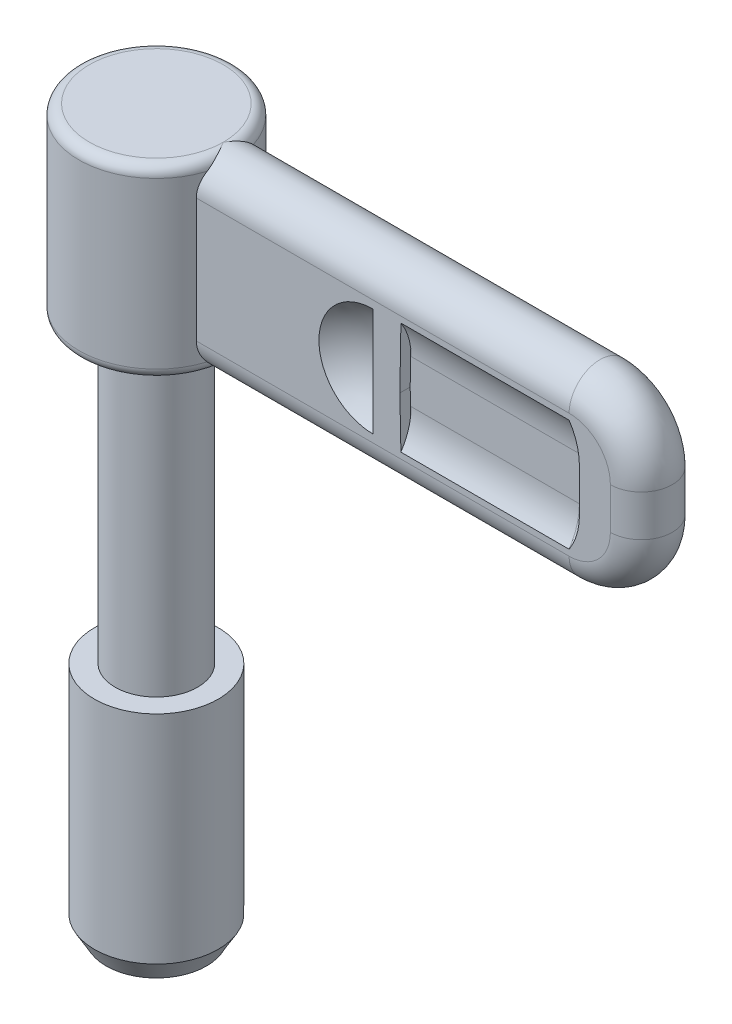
ISO-10303-21;
HEADER;
FILE_DESCRIPTION(('STEP AP214'),'2;1');
FILE_NAME('part.step','',(''),(''),'','','');
FILE_SCHEMA(('AUTOMOTIVE_DESIGN { 1 0 10303 214 1 1 1 1 }'));
ENDSEC;
DATA;
#1=APPLICATION_CONTEXT('core data for automotive mechanical design processes');
#2=APPLICATION_PROTOCOL_DEFINITION('international standard','automotive_design',2000,#1);
#3=PRODUCT_CONTEXT('',#1,'mechanical');
#4=PRODUCT('Part','Part','',(#3));
#5=PRODUCT_RELATED_PRODUCT_CATEGORY('part','',(#4));
#6=PRODUCT_DEFINITION_FORMATION('','',#4);
#7=PRODUCT_DEFINITION_CONTEXT('part definition',#1,'design');
#8=PRODUCT_DEFINITION('design','',#6,#7);
#9=PRODUCT_DEFINITION_SHAPE('','',#8);
#10=(LENGTH_UNIT() NAMED_UNIT(*) SI_UNIT(.MILLI.,.METRE.));
#11=(NAMED_UNIT(*) PLANE_ANGLE_UNIT() SI_UNIT($,.RADIAN.));
#12=(NAMED_UNIT(*) SI_UNIT($,.STERADIAN.) SOLID_ANGLE_UNIT());
#13=UNCERTAINTY_MEASURE_WITH_UNIT(LENGTH_MEASURE(1.E-05),#10,'distance_accuracy_value','');
#14=(GEOMETRIC_REPRESENTATION_CONTEXT(3) GLOBAL_UNCERTAINTY_ASSIGNED_CONTEXT((#13)) GLOBAL_UNIT_ASSIGNED_CONTEXT((#10,
#11,#12)) REPRESENTATION_CONTEXT('',''));
#15=CARTESIAN_POINT('',(0.,0.,0.));
#16=DIRECTION('',(0.,0.,1.));
#17=DIRECTION('',(1.,0.,0.));
#18=AXIS2_PLACEMENT_3D('',#15,#16,#17);
#19=CARTESIAN_POINT('',(26.7,44.583375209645,-3.00000000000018));
#20=DIRECTION('',(-1.,0.,0.));
#21=DIRECTION('',(0.,0.,1.));
#22=AXIS2_PLACEMENT_3D('',#19,#20,#21);
#23=PLANE('',#22);
#24=CARTESIAN_POINT('',(26.7,47.9,-7.99999999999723));
#25=DIRECTION('',(1.,0.,0.));
#26=DIRECTION('',(0.,0.,1.));
#27=AXIS2_PLACEMENT_3D('',#24,#25,#26);
#28=CIRCLE('',#27,5.99999999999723);
#29=CARTESIAN_POINT('',(26.7,47.9,-2.));
#30=VERTEX_POINT('',#29);
#31=CARTESIAN_POINT('',(26.7,44.5833752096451,-3.0000000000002));
#32=VERTEX_POINT('',#31);
#33=EDGE_CURVE('E191',#30,#32,#28,.T.);
#34=ORIENTED_EDGE('',*,*,#33,.T.);
#35=DIRECTION('',(0.,-1.20792265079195E-13,1.));
#36=VECTOR('',#35,1.);
#37=CARTESIAN_POINT('',(26.7,44.5833752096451,-3.00000000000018));
#38=LINE('',#37,#36);
#39=CARTESIAN_POINT('',(26.7,44.583375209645,-2.));
#40=VERTEX_POINT('',#39);
#41=EDGE_CURVE('E207',#40,#32,#38,.F.);
#42=ORIENTED_EDGE('',*,*,#41,.F.);
#43=DIRECTION('',(0.,1.,0.));
#44=VECTOR('',#43,1.);
#45=CARTESIAN_POINT('',(26.7,44.583375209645,-2.));
#46=LINE('',#45,#44);
#47=EDGE_CURVE('E208',#40,#30,#46,.T.);
#48=ORIENTED_EDGE('',*,*,#47,.T.);
#49=EDGE_LOOP('',(#34,#42,#48));
#50=FACE_BOUND('',#49,.T.);
#51=ADVANCED_FACE('F15',(#50),#23,.T.);
#52=CARTESIAN_POINT('',(6.87386354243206,44.,-3.));
#53=DIRECTION('',(0.,0.,-1.));
#54=DIRECTION('',(0.,1.,0.));
#55=AXIS2_PLACEMENT_3D('',#52,#53,#54);
#56=PLANE('',#55);
#57=DIRECTION('',(1.4255263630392E-13,1.,0.));
#58=VECTOR('',#57,1.);
#59=CARTESIAN_POINT('',(6.87386354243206,44.0000000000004,-3.));
#60=LINE('',#59,#58);
#61=CARTESIAN_POINT('',(6.87386354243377,56.0000000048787,-3.));
#62=VERTEX_POINT('',#61);
#63=CARTESIAN_POINT('',(6.87386354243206,44.0000000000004,-3.));
#64=VERTEX_POINT('',#63);
#65=EDGE_CURVE('E421',#62,#64,#60,.F.);
#66=ORIENTED_EDGE('',*,*,#65,.F.);
#67=DIRECTION('',(1.,-1.35044700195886E-10,0.));
#68=VECTOR('',#67,1.);
#69=CARTESIAN_POINT('',(6.87386354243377,56.0000000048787,-3.));
#70=LINE('',#69,#68);
#71=CARTESIAN_POINT('',(43.,56.,-3.));
#72=VERTEX_POINT('',#71);
#73=EDGE_CURVE('E441',#62,#72,#70,.T.);
#74=ORIENTED_EDGE('',*,*,#73,.T.);
#75=CARTESIAN_POINT('',(43.0000000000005,52.0000000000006,-3.));
#76=DIRECTION('',(0.,0.,-1.));
#77=DIRECTION('',(-1.24344978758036E-13,1.,0.));
#78=AXIS2_PLACEMENT_3D('',#75,#76,#77);
#79=CIRCLE('',#78,3.99999999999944);
#80=CARTESIAN_POINT('',(47.,52.,-3.));
#81=VERTEX_POINT('',#80);
#82=EDGE_CURVE('E431',#72,#81,#79,.T.);
#83=ORIENTED_EDGE('',*,*,#82,.T.);
#84=DIRECTION('',(0.,-1.,0.));
#85=VECTOR('',#84,1.);
#86=CARTESIAN_POINT('',(47.,52.,-3.));
#87=LINE('',#86,#85);
#88=CARTESIAN_POINT('',(47.,48.,-3.));
#89=VERTEX_POINT('',#88);
#90=EDGE_CURVE('E427',#81,#89,#87,.T.);
#91=ORIENTED_EDGE('',*,*,#90,.T.);
#92=CARTESIAN_POINT('',(43.0000000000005,47.9999999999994,-3.));
#93=DIRECTION('',(0.,0.,-1.));
#94=DIRECTION('',(1.,1.11910480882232E-13,0.));
#95=AXIS2_PLACEMENT_3D('',#92,#93,#94);
#96=CIRCLE('',#95,3.99999999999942);
#97=CARTESIAN_POINT('',(43.,44.,-3.));
#98=VERTEX_POINT('',#97);
#99=EDGE_CURVE('E226',#89,#98,#96,.T.);
#100=ORIENTED_EDGE('',*,*,#99,.T.);
#101=DIRECTION('',(-1.,0.,0.));
#102=VECTOR('',#101,1.);
#103=CARTESIAN_POINT('',(43.,44.,-3.));
#104=LINE('',#103,#102);
#105=EDGE_CURVE('E223',#98,#64,#104,.T.);
#106=ORIENTED_EDGE('',*,*,#105,.T.);
#107=EDGE_LOOP('',(#66,#74,#83,#91,#100,#106));
#108=FACE_BOUND('',#107,.T.);
#109=DIRECTION('',(0.0203349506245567,-0.999793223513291,0.));
#110=VECTOR('',#109,1.);
#111=CARTESIAN_POINT('',(26.6,49.5,-3.));
#112=LINE('',#111,#110);
#113=CARTESIAN_POINT('',(26.6,49.5,-3.));
#114=VERTEX_POINT('',#113);
#115=EDGE_CURVE('E201',#114,#32,#112,.T.);
#116=ORIENTED_EDGE('',*,*,#115,.T.);
#117=DIRECTION('',(1.,0.,0.));
#118=VECTOR('',#117,1.);
#119=CARTESIAN_POINT('',(26.7,44.5833752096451,-3.));
#120=LINE('',#119,#118);
#121=CARTESIAN_POINT('',(43.,44.5833752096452,-3.));
#122=VERTEX_POINT('',#121);
#123=EDGE_CURVE('E187',#32,#122,#120,.T.);
#124=ORIENTED_EDGE('',*,*,#123,.T.);
#125=CARTESIAN_POINT('',(44.,47.9,-3.));
#126=CARTESIAN_POINT('',(43.9995605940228,47.8267741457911,-3.));
#127=CARTESIAN_POINT('',(43.9979095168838,47.7535532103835,-3.));
#128=CARTESIAN_POINT('',(43.9921238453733,47.6071919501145,-3.));
#129=CARTESIAN_POINT('',(43.9879886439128,47.534051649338,-3.));
#130=CARTESIAN_POINT('',(43.9771750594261,47.3879631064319,-3.));
#131=CARTESIAN_POINT('',(43.970496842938,47.3150148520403,-3.));
#132=CARTESIAN_POINT('',(43.9545525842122,47.1694198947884,-3.));
#133=CARTESIAN_POINT('',(43.945287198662,47.0967731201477,-3.));
#134=CARTESIAN_POINT('',(43.9241361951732,46.9518864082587,-3.00000000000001));
#135=CARTESIAN_POINT('',(43.9122514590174,46.8796463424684,-3.00000000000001));
#136=CARTESIAN_POINT('',(43.8858425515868,46.7356746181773,-3.00000000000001));
#137=CARTESIAN_POINT('',(43.8713192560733,46.663942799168,-3.00000000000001));
#138=CARTESIAN_POINT('',(43.8396271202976,46.5210851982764,-3.00000000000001));
#139=CARTESIAN_POINT('',(43.8224589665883,46.4499592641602,-3.00000000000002));
#140=CARTESIAN_POINT('',(43.7854842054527,46.3084071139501,-3.00000000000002));
#141=CARTESIAN_POINT('',(43.7656779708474,46.2379808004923,-3.00000000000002));
#142=CARTESIAN_POINT('',(43.7234473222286,46.0979175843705,-3.00000000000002));
#143=CARTESIAN_POINT('',(43.7010229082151,46.0282806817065,-3.00000000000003));
#144=CARTESIAN_POINT('',(43.6535893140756,45.8898819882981,-3.00000000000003));
#145=CARTESIAN_POINT('',(43.6285797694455,45.8211203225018,-3.00000000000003));
#146=CARTESIAN_POINT('',(43.5760223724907,45.6845538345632,-3.00000000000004));
#147=CARTESIAN_POINT('',(43.548473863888,45.6167492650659,-3.00000000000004));
#148=CARTESIAN_POINT('',(43.4908979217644,45.4821747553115,-3.00000000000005));
#149=CARTESIAN_POINT('',(43.4608696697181,45.4154051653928,-3.00000000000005));
#150=CARTESIAN_POINT('',(43.3984063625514,45.2829745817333,-3.00000000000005));
#151=CARTESIAN_POINT('',(43.3659705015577,45.2173139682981,-3.00000000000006));
#152=CARTESIAN_POINT('',(43.2987767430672,45.0871713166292,-3.00000000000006));
#153=CARTESIAN_POINT('',(43.2640182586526,45.0226895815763,-3.00000000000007));
#154=CARTESIAN_POINT('',(43.1922760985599,44.8949716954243,-3.00000000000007));
#155=CARTESIAN_POINT('',(43.1552922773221,44.8317356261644,-3.00000000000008));
#156=CARTESIAN_POINT('',(43.0792094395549,44.7065697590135,-3.00000000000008));
#157=CARTESIAN_POINT('',(43.0401109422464,44.6446396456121,-3.00000000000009));
#158=CARTESIAN_POINT('',(43.,44.5833752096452,-3.00000000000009));
#159=B_SPLINE_CURVE_WITH_KNOTS('',3,(#125,#126,#127,#128,#129,#130,#131,#132,#133,#134,#135,
#136,#137,#138,#139,#140,#141,#142,#143,#144,#145,#146,#147,#148,#149,#150,#151,#152,#153,#154,
#155,#156,#157,#158),.UNSPECIFIED.,.F.,.F.,(4,2,2,2,2,2,2,2,2,2,2,2,2,2,2,2,4),(0.,
0.21967499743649,0.439403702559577,0.659118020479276,0.878776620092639,1.0983613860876,
1.31787340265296,1.53732853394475,1.7567526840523,1.97617683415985,2.19563196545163,
2.41514398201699,2.63472874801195,2.85438734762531,3.074101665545,3.2938303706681,
3.51350536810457),.UNSPECIFIED.);
#160=CARTESIAN_POINT('',(44.,47.9,-3.));
#161=VERTEX_POINT('',#160);
#162=EDGE_CURVE('E200',#161,#122,#159,.T.);
#163=ORIENTED_EDGE('',*,*,#162,.F.);
#164=DIRECTION('',(0.,1.,0.));
#165=VECTOR('',#164,1.);
#166=CARTESIAN_POINT('',(44.,47.9,-3.));
#167=LINE('',#166,#165);
#168=CARTESIAN_POINT('',(44.,52.1,-3.));
#169=VERTEX_POINT('',#168);
#170=EDGE_CURVE('E241',#161,#169,#167,.T.);
#171=ORIENTED_EDGE('',*,*,#170,.T.);
#172=CARTESIAN_POINT('',(43.,55.4166247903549,-3.00000000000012));
#173=CARTESIAN_POINT('',(43.0401109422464,55.355360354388,-3.00000000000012));
#174=CARTESIAN_POINT('',(43.0792094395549,55.2934302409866,-3.00000000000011));
#175=CARTESIAN_POINT('',(43.1552922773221,55.1682643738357,-3.0000000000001));
#176=CARTESIAN_POINT('',(43.1922760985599,55.1050283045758,-3.0000000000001));
#177=CARTESIAN_POINT('',(43.2640182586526,54.9773104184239,-3.00000000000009));
#178=CARTESIAN_POINT('',(43.2987767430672,54.9128286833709,-3.00000000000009));
#179=CARTESIAN_POINT('',(43.3659705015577,54.7826860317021,-3.00000000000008));
#180=CARTESIAN_POINT('',(43.3984063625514,54.7170254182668,-3.00000000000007));
#181=CARTESIAN_POINT('',(43.4608696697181,54.5845948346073,-3.00000000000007));
#182=CARTESIAN_POINT('',(43.4908979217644,54.5178252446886,-3.00000000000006));
#183=CARTESIAN_POINT('',(43.548473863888,54.3832507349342,-3.00000000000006));
#184=CARTESIAN_POINT('',(43.5760223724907,54.3154461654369,-3.00000000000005));
#185=CARTESIAN_POINT('',(43.6285797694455,54.1788796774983,-3.00000000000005));
#186=CARTESIAN_POINT('',(43.6535893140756,54.110118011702,-3.00000000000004));
#187=CARTESIAN_POINT('',(43.7010229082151,53.9717193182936,-3.00000000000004));
#188=CARTESIAN_POINT('',(43.7234473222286,53.9020824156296,-3.00000000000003));
#189=CARTESIAN_POINT('',(43.7656779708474,53.7620191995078,-3.00000000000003));
#190=CARTESIAN_POINT('',(43.7854842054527,53.69159288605,-3.00000000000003));
#191=CARTESIAN_POINT('',(43.8224589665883,53.5500407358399,-3.00000000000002));
#192=CARTESIAN_POINT('',(43.8396271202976,53.4789148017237,-3.00000000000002));
#193=CARTESIAN_POINT('',(43.8713192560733,53.336057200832,-3.00000000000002));
#194=CARTESIAN_POINT('',(43.8858425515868,53.2643253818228,-3.00000000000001));
#195=CARTESIAN_POINT('',(43.9122514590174,53.1203536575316,-3.00000000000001));
#196=CARTESIAN_POINT('',(43.9241361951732,53.0481135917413,-3.00000000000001));
#197=CARTESIAN_POINT('',(43.945287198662,52.9032268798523,-3.00000000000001));
#198=CARTESIAN_POINT('',(43.9545525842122,52.8305801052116,-3.00000000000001));
#199=CARTESIAN_POINT('',(43.970496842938,52.6849851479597,-3.));
#200=CARTESIAN_POINT('',(43.9771750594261,52.6120368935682,-3.));
#201=CARTESIAN_POINT('',(43.9879886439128,52.465948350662,-3.));
#202=CARTESIAN_POINT('',(43.9921238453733,52.3928080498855,-3.));
#203=CARTESIAN_POINT('',(43.9979095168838,52.2464467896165,-3.));
#204=CARTESIAN_POINT('',(43.9995605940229,52.1732258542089,-3.));
#205=CARTESIAN_POINT('',(44.,52.1,-3.));
#206=B_SPLINE_CURVE_WITH_KNOTS('',3,(#172,#173,#174,#175,#176,#177,#178,#179,#180,#181,#182,
#183,#184,#185,#186,#187,#188,#189,#190,#191,#192,#193,#194,#195,#196,#197,#198,#199,#200,#201,
#202,#203,#204,#205),.UNSPECIFIED.,.F.,.F.,(4,2,2,2,2,2,2,2,2,2,2,2,2,2,2,2,4),(0.,
0.219674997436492,0.439403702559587,0.659118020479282,0.878776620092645,1.09836138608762,
1.31787340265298,1.53732853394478,1.75675268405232,1.97617683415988,2.19563196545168,
2.41514398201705,2.63472874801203,2.85438734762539,3.0741016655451,3.29383037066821,
3.51350536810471),.UNSPECIFIED.);
#207=CARTESIAN_POINT('',(43.,55.4166247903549,-3.));
#208=VERTEX_POINT('',#207);
#209=EDGE_CURVE('E671',#208,#169,#206,.T.);
#210=ORIENTED_EDGE('',*,*,#209,.F.);
#211=DIRECTION('',(-1.,0.,0.));
#212=VECTOR('',#211,1.);
#213=CARTESIAN_POINT('',(43.,55.4166247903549,-3.));
#214=LINE('',#213,#212);
#215=CARTESIAN_POINT('',(26.7,55.4166247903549,-3.));
#216=VERTEX_POINT('',#215);
#217=EDGE_CURVE('E1388',#216,#208,#214,.F.);
#218=ORIENTED_EDGE('',*,*,#217,.F.);
#219=DIRECTION('',(-0.0168991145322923,-0.999857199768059,0.));
#220=VECTOR('',#219,1.);
#221=CARTESIAN_POINT('',(26.7,55.4166247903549,-3.));
#222=LINE('',#221,#220);
#223=EDGE_CURVE('E222',#216,#114,#222,.T.);
#224=ORIENTED_EDGE('',*,*,#223,.T.);
#225=EDGE_LOOP('',(#116,#124,#163,#171,#210,#218,#224));
#226=FACE_BOUND('',#225,.T.);
#227=DIRECTION('',(0.,1.,0.));
#228=VECTOR('',#227,1.);
#229=CARTESIAN_POINT('',(24.,44.7550023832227,-3.));
#230=LINE('',#229,#228);
#231=CARTESIAN_POINT('',(24.,44.7550023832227,-3.));
#232=VERTEX_POINT('',#231);
#233=CARTESIAN_POINT('',(24.,55.2449976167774,-3.));
#234=VERTEX_POINT('',#233);
#235=EDGE_CURVE('E1386',#232,#234,#230,.T.);
#236=ORIENTED_EDGE('',*,*,#235,.T.);
#237=CARTESIAN_POINT('',(24.,55.2449976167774,-3.));
#238=CARTESIAN_POINT('',(23.7151261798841,55.2449976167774,-3.));
#239=CARTESIAN_POINT('',(23.4388980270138,55.2229701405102,-3.));
#240=CARTESIAN_POINT('',(22.9004954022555,55.1370623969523,-3.));
#241=CARTESIAN_POINT('',(22.6383209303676,55.0731821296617,-3.));
#242=CARTESIAN_POINT('',(21.999053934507,54.8647817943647,-3.));
#243=CARTESIAN_POINT('',(21.6315064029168,54.6967726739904,-3.));
#244=CARTESIAN_POINT('',(20.8874735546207,54.2499361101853,-3.));
#245=CARTESIAN_POINT('',(20.5168752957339,53.9506197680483,-3.));
#246=CARTESIAN_POINT('',(19.5480014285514,52.9256197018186,-3.));
#247=CARTESIAN_POINT('',(19.0979860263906,52.0890991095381,-3.));
#248=CARTESIAN_POINT('',(18.4825352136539,49.4183108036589,-3.));
#249=CARTESIAN_POINT('',(19.0111775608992,47.5712756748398,-3.));
#250=CARTESIAN_POINT('',(20.6757585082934,45.9066947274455,-3.));
#251=CARTESIAN_POINT('',(21.1114175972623,45.5831930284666,-3.));
#252=CARTESIAN_POINT('',(21.9715509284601,45.147582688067,-3.));
#253=CARTESIAN_POINT('',(22.3462263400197,45.0053369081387,-3.));
#254=CARTESIAN_POINT('',(23.1510585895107,44.8057548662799,-3.));
#255=CARTESIAN_POINT('',(23.5704816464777,44.7550023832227,-3.));
#256=CARTESIAN_POINT('',(24.,44.7550023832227,-3.));
#257=B_SPLINE_CURVE_WITH_KNOTS('',3,(#237,#238,#239,#240,#241,#242,#243,#244,#245,#246,#247,
#248,#249,#250,#251,#252,#253,#254,#255,#256),.UNSPECIFIED.,.F.,.F.,(4,2,2,2,2,2,2,2,2,4),(0.,
0.0494877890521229,0.0989755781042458,0.172696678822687,0.262079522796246,0.433728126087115,
0.763636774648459,0.862742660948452,0.930192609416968,1.),.UNSPECIFIED.);
#258=EDGE_CURVE('E275',#234,#232,#257,.T.);
#259=ORIENTED_EDGE('',*,*,#258,.T.);
#260=EDGE_LOOP('',(#236,#259));
#261=FACE_BOUND('',#260,.T.);
#262=ADVANCED_FACE('F218',(#108,#226,#261),#56,.T.);
#263=CARTESIAN_POINT('',(6.87386354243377,43.9999999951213,3.));
#264=DIRECTION('',(0.,0.,1.));
#265=DIRECTION('',(1.,0.,0.));
#266=AXIS2_PLACEMENT_3D('',#263,#264,#265);
#267=PLANE('',#266);
#268=DIRECTION('',(-1.,-1.82876165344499E-08,0.));
#269=VECTOR('',#268,1.);
#270=CARTESIAN_POINT('',(43.,56.,3.));
#271=LINE('',#270,#269);
#272=CARTESIAN_POINT('',(43.,56.,3.));
#273=VERTEX_POINT('',#272);
#274=CARTESIAN_POINT('',(6.8738635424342,55.9999993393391,3.));
#275=VERTEX_POINT('',#274);
#276=EDGE_CURVE('E266',#273,#275,#271,.T.);
#277=ORIENTED_EDGE('',*,*,#276,.T.);
#278=DIRECTION('',(0.,-1.,0.));
#279=VECTOR('',#278,1.);
#280=CARTESIAN_POINT('',(6.8738635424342,55.9999993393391,3.));
#281=LINE('',#280,#279);
#282=CARTESIAN_POINT('',(6.87386354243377,43.9999999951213,3.));
#283=VERTEX_POINT('',#282);
#284=EDGE_CURVE('E274',#275,#283,#281,.T.);
#285=ORIENTED_EDGE('',*,*,#284,.T.);
#286=DIRECTION('',(1.,1.35044700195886E-10,0.));
#287=VECTOR('',#286,1.);
#288=CARTESIAN_POINT('',(6.87386354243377,43.9999999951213,3.));
#289=LINE('',#288,#287);
#290=CARTESIAN_POINT('',(43.,44.,3.));
#291=VERTEX_POINT('',#290);
#292=EDGE_CURVE('E280',#283,#291,#289,.T.);
#293=ORIENTED_EDGE('',*,*,#292,.T.);
#294=CARTESIAN_POINT('',(43.0000000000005,47.9999999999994,3.));
#295=DIRECTION('',(0.,0.,1.));
#296=DIRECTION('',(-1.40332190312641E-13,-1.,0.));
#297=AXIS2_PLACEMENT_3D('',#294,#295,#296);
#298=CIRCLE('',#297,3.99999999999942);
#299=CARTESIAN_POINT('',(47.,48.,3.));
#300=VERTEX_POINT('',#299);
#301=EDGE_CURVE('E285',#291,#300,#298,.T.);
#302=ORIENTED_EDGE('',*,*,#301,.T.);
#303=DIRECTION('',(0.,1.,0.));
#304=VECTOR('',#303,1.);
#305=CARTESIAN_POINT('',(47.,48.,3.));
#306=LINE('',#305,#304);
#307=CARTESIAN_POINT('',(47.,52.,3.));
#308=VERTEX_POINT('',#307);
#309=EDGE_CURVE('E290',#300,#308,#306,.T.);
#310=ORIENTED_EDGE('',*,*,#309,.T.);
#311=CARTESIAN_POINT('',(43.0000000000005,52.0000000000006,3.));
#312=DIRECTION('',(0.,0.,1.));
#313=DIRECTION('',(1.,-1.11910480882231E-13,0.));
#314=AXIS2_PLACEMENT_3D('',#311,#312,#313);
#315=CIRCLE('',#314,3.99999999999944);
#316=EDGE_CURVE('E295',#308,#273,#315,.T.);
#317=ORIENTED_EDGE('',*,*,#316,.T.);
#318=EDGE_LOOP('',(#277,#285,#293,#302,#310,#317));
#319=FACE_BOUND('',#318,.T.);
#320=DIRECTION('',(0.016899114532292,0.999857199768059,0.));
#321=VECTOR('',#320,1.);
#322=CARTESIAN_POINT('',(26.6,49.5,3.));
#323=LINE('',#322,#321);
#324=CARTESIAN_POINT('',(26.7,55.416624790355,3.));
#325=VERTEX_POINT('',#324);
#326=CARTESIAN_POINT('',(26.6,49.5,3.));
#327=VERTEX_POINT('',#326);
#328=EDGE_CURVE('E300',#325,#327,#323,.F.);
#329=ORIENTED_EDGE('',*,*,#328,.F.);
#330=DIRECTION('',(1.,0.,0.));
#331=VECTOR('',#330,1.);
#332=CARTESIAN_POINT('',(26.7,55.416624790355,3.));
#333=LINE('',#332,#331);
#334=CARTESIAN_POINT('',(43.,55.4166247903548,3.));
#335=VERTEX_POINT('',#334);
#336=EDGE_CURVE('E305',#325,#335,#333,.T.);
#337=ORIENTED_EDGE('',*,*,#336,.T.);
#338=CARTESIAN_POINT('',(44.,52.1,3.));
#339=CARTESIAN_POINT('',(43.9995605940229,52.1732258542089,3.));
#340=CARTESIAN_POINT('',(43.9979095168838,52.2464467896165,3.));
#341=CARTESIAN_POINT('',(43.9921238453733,52.3928080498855,3.));
#342=CARTESIAN_POINT('',(43.9879886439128,52.465948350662,3.));
#343=CARTESIAN_POINT('',(43.9771750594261,52.6120368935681,3.));
#344=CARTESIAN_POINT('',(43.970496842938,52.6849851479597,3.));
#345=CARTESIAN_POINT('',(43.9545525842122,52.8305801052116,3.));
#346=CARTESIAN_POINT('',(43.945287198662,52.9032268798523,3.));
#347=CARTESIAN_POINT('',(43.9241361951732,53.0481135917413,3.00000000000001));
#348=CARTESIAN_POINT('',(43.9122514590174,53.1203536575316,3.00000000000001));
#349=CARTESIAN_POINT('',(43.8858425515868,53.2643253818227,3.00000000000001));
#350=CARTESIAN_POINT('',(43.8713192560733,53.336057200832,3.00000000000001));
#351=CARTESIAN_POINT('',(43.8396271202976,53.4789148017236,3.00000000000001));
#352=CARTESIAN_POINT('',(43.8224589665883,53.5500407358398,3.00000000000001));
#353=CARTESIAN_POINT('',(43.7854842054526,53.6915928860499,3.00000000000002));
#354=CARTESIAN_POINT('',(43.7656779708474,53.7620191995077,3.00000000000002));
#355=CARTESIAN_POINT('',(43.7234473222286,53.9020824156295,3.00000000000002));
#356=CARTESIAN_POINT('',(43.7010229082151,53.9717193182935,3.00000000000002));
#357=CARTESIAN_POINT('',(43.6535893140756,54.1101180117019,3.00000000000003));
#358=CARTESIAN_POINT('',(43.6285797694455,54.1788796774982,3.00000000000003));
#359=CARTESIAN_POINT('',(43.5760223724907,54.3154461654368,3.00000000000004));
#360=CARTESIAN_POINT('',(43.548473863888,54.3832507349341,3.00000000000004));
#361=CARTESIAN_POINT('',(43.4908979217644,54.5178252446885,3.00000000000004));
#362=CARTESIAN_POINT('',(43.4608696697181,54.5845948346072,3.00000000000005));
#363=CARTESIAN_POINT('',(43.3984063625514,54.7170254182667,3.00000000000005));
#364=CARTESIAN_POINT('',(43.3659705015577,54.782686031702,3.00000000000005));
#365=CARTESIAN_POINT('',(43.2987767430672,54.9128286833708,3.00000000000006));
#366=CARTESIAN_POINT('',(43.2640182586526,54.9773104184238,3.00000000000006));
#367=CARTESIAN_POINT('',(43.1922760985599,55.1050283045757,3.00000000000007));
#368=CARTESIAN_POINT('',(43.1552922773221,55.1682643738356,3.00000000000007));
#369=CARTESIAN_POINT('',(43.0792094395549,55.2934302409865,3.00000000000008));
#370=CARTESIAN_POINT('',(43.0401109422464,55.3553603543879,3.00000000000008));
#371=CARTESIAN_POINT('',(43.,55.4166247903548,3.00000000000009));
#372=B_SPLINE_CURVE_WITH_KNOTS('',3,(#338,#339,#340,#341,#342,#343,#344,#345,#346,#347,#348,
#349,#350,#351,#352,#353,#354,#355,#356,#357,#358,#359,#360,#361,#362,#363,#364,#365,#366,#367,
#368,#369,#370,#371),.UNSPECIFIED.,.F.,.F.,(4,2,2,2,2,2,2,2,2,2,2,2,2,2,2,2,4),(0.,
0.219674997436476,0.439403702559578,0.659118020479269,0.878776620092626,1.09836138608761,
1.31787340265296,1.53732853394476,1.7567526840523,1.97617683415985,2.19563196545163,
2.41514398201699,2.63472874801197,2.85438734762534,3.07410166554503,3.29383037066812,
3.51350536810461),.UNSPECIFIED.);
#373=CARTESIAN_POINT('',(44.,52.1,3.));
#374=VERTEX_POINT('',#373);
#375=EDGE_CURVE('E310',#374,#335,#372,.T.);
#376=ORIENTED_EDGE('',*,*,#375,.F.);
#377=DIRECTION('',(0.,-1.,0.));
#378=VECTOR('',#377,1.);
#379=CARTESIAN_POINT('',(44.,52.1,3.));
#380=LINE('',#379,#378);
#381=CARTESIAN_POINT('',(44.,47.9,3.));
#382=VERTEX_POINT('',#381);
#383=EDGE_CURVE('E320',#374,#382,#380,.T.);
#384=ORIENTED_EDGE('',*,*,#383,.T.);
#385=CARTESIAN_POINT('',(43.,44.5833752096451,3.00000000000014));
#386=CARTESIAN_POINT('',(43.0401109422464,44.644639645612,3.00000000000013));
#387=CARTESIAN_POINT('',(43.0792094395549,44.7065697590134,3.00000000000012));
#388=CARTESIAN_POINT('',(43.1552922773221,44.8317356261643,3.00000000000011));
#389=CARTESIAN_POINT('',(43.1922760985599,44.8949716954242,3.00000000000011));
#390=CARTESIAN_POINT('',(43.2640182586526,45.0226895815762,3.0000000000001));
#391=CARTESIAN_POINT('',(43.2987767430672,45.0871713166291,3.00000000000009));
#392=CARTESIAN_POINT('',(43.3659705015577,45.217313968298,3.00000000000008));
#393=CARTESIAN_POINT('',(43.3984063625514,45.2829745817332,3.00000000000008));
#394=CARTESIAN_POINT('',(43.4608696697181,45.4154051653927,3.00000000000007));
#395=CARTESIAN_POINT('',(43.4908979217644,45.4821747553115,3.00000000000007));
#396=CARTESIAN_POINT('',(43.548473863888,45.6167492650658,3.00000000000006));
#397=CARTESIAN_POINT('',(43.5760223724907,45.6845538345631,3.00000000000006));
#398=CARTESIAN_POINT('',(43.6285797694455,45.8211203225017,3.00000000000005));
#399=CARTESIAN_POINT('',(43.6535893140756,45.889881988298,3.00000000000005));
#400=CARTESIAN_POINT('',(43.7010229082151,46.0282806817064,3.00000000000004));
#401=CARTESIAN_POINT('',(43.7234473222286,46.0979175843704,3.00000000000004));
#402=CARTESIAN_POINT('',(43.7656779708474,46.2379808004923,3.00000000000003));
#403=CARTESIAN_POINT('',(43.7854842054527,46.30840711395,3.00000000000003));
#404=CARTESIAN_POINT('',(43.8224589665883,46.4499592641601,3.00000000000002));
#405=CARTESIAN_POINT('',(43.8396271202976,46.5210851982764,3.00000000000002));
#406=CARTESIAN_POINT('',(43.8713192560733,46.663942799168,3.00000000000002));
#407=CARTESIAN_POINT('',(43.8858425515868,46.7356746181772,3.00000000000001));
#408=CARTESIAN_POINT('',(43.9122514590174,46.8796463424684,3.00000000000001));
#409=CARTESIAN_POINT('',(43.9241361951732,46.9518864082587,3.00000000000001));
#410=CARTESIAN_POINT('',(43.945287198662,47.0967731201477,3.00000000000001));
#411=CARTESIAN_POINT('',(43.9545525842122,47.1694198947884,3.00000000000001));
#412=CARTESIAN_POINT('',(43.970496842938,47.3150148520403,3.));
#413=CARTESIAN_POINT('',(43.9771750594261,47.3879631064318,3.));
#414=CARTESIAN_POINT('',(43.9879886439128,47.534051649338,3.));
#415=CARTESIAN_POINT('',(43.9921238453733,47.6071919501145,3.));
#416=CARTESIAN_POINT('',(43.9979095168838,47.7535532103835,3.));
#417=CARTESIAN_POINT('',(43.9995605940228,47.8267741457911,3.));
#418=CARTESIAN_POINT('',(44.,47.9,3.));
#419=B_SPLINE_CURVE_WITH_KNOTS('',3,(#385,#386,#387,#388,#389,#390,#391,#392,#393,#394,#395,
#396,#397,#398,#399,#400,#401,#402,#403,#404,#405,#406,#407,#408,#409,#410,#411,#412,#413,#414,
#415,#416,#417,#418),.UNSPECIFIED.,.F.,.F.,(4,2,2,2,2,2,2,2,2,2,2,2,2,2,2,2,4),(0.,
0.21967499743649,0.439403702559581,0.659118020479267,0.878776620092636,1.0983613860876,
1.31787340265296,1.53732853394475,1.7567526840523,1.97617683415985,2.19563196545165,
2.41514398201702,2.63472874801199,2.85438734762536,3.07410166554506,3.29383037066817,
3.51350536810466),.UNSPECIFIED.);
#420=CARTESIAN_POINT('',(43.,44.5833752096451,3.));
#421=VERTEX_POINT('',#420);
#422=EDGE_CURVE('E327',#421,#382,#419,.T.);
#423=ORIENTED_EDGE('',*,*,#422,.F.);
#424=DIRECTION('',(-1.,0.,0.));
#425=VECTOR('',#424,1.);
#426=CARTESIAN_POINT('',(43.,44.5833752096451,3.));
#427=LINE('',#426,#425);
#428=CARTESIAN_POINT('',(26.7,44.583375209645,3.));
#429=VERTEX_POINT('',#428);
#430=EDGE_CURVE('E337',#429,#421,#427,.F.);
#431=ORIENTED_EDGE('',*,*,#430,.F.);
#432=DIRECTION('',(-0.0203349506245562,0.999793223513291,0.));
#433=VECTOR('',#432,1.);
#434=CARTESIAN_POINT('',(26.7,44.583375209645,3.));
#435=LINE('',#434,#433);
#436=EDGE_CURVE('E344',#327,#429,#435,.F.);
#437=ORIENTED_EDGE('',*,*,#436,.F.);
#438=EDGE_LOOP('',(#329,#337,#376,#384,#423,#431,#437));
#439=FACE_BOUND('',#438,.T.);
#440=CARTESIAN_POINT('',(24.,55.2449976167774,3.00000000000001));
#441=CARTESIAN_POINT('',(23.9007105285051,55.2450080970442,3.00000686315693));
#442=CARTESIAN_POINT('',(23.8014198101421,55.2422017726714,3.00002235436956));
#443=CARTESIAN_POINT('',(23.6040322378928,55.2310063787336,3.00004925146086));
#444=CARTESIAN_POINT('',(23.5059325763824,55.2226667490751,3.00006069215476));
#445=CARTESIAN_POINT('',(23.3107990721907,55.2005050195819,3.00005901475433));
#446=CARTESIAN_POINT('',(23.2137624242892,55.1867076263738,3.00004600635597));
#447=CARTESIAN_POINT('',(23.0206923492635,55.1537030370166,3.00001047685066));
#448=CARTESIAN_POINT('',(22.9246581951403,55.134500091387,2.999987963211));
#449=CARTESIAN_POINT('',(22.7336092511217,55.0907129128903,2.99995259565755));
#450=CARTESIAN_POINT('',(22.6385970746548,55.0661172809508,2.9999397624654));
#451=CARTESIAN_POINT('',(22.4496943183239,55.0115465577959,2.99994002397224));
#452=CARTESIAN_POINT('',(22.3558101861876,54.9815491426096,2.99995322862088));
#453=CARTESIAN_POINT('',(22.1693672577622,54.9161313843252,2.99997728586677));
#454=CARTESIAN_POINT('',(22.0768186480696,54.8806819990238,2.99998812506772));
#455=CARTESIAN_POINT('',(21.8940046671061,54.8046541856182,3.00001195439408));
#456=CARTESIAN_POINT('',(21.8037362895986,54.764082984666,3.00002494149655));
#457=CARTESIAN_POINT('',(21.6261566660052,54.678163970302,3.0000616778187));
#458=CARTESIAN_POINT('',(21.5388311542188,54.6328456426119,3.00008536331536));
#459=CARTESIAN_POINT('',(21.3671581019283,54.5375141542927,3.00011664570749));
#460=CARTESIAN_POINT('',(21.2828016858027,54.4875169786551,3.00012429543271));
#461=CARTESIAN_POINT('',(21.1171461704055,54.3829357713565,3.00012643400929));
#462=CARTESIAN_POINT('',(21.0358429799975,54.3283582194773,3.0001209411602));
#463=CARTESIAN_POINT('',(20.8764294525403,54.2147366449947,3.00010164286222));
#464=CARTESIAN_POINT('',(20.7983188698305,54.1556929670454,3.00008783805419));
#465=CARTESIAN_POINT('',(20.6454687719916,54.0332820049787,3.00005905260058));
#466=CARTESIAN_POINT('',(20.5707317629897,53.9699115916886,3.0000440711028));
#467=CARTESIAN_POINT('',(20.4248389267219,53.8390151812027,3.00001807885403));
#468=CARTESIAN_POINT('',(20.3536872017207,53.771484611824,3.00000707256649));
#469=CARTESIAN_POINT('',(20.215195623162,53.6324645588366,2.99999137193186));
#470=CARTESIAN_POINT('',(20.147860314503,53.5609705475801,2.99998668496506));
#471=CARTESIAN_POINT('',(20.0172421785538,53.414250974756,2.9999830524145));
#472=CARTESIAN_POINT('',(19.9539632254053,53.3390219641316,2.9999841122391));
#473=CARTESIAN_POINT('',(19.8316982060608,53.1850916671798,2.99998937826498));
#474=CARTESIAN_POINT('',(19.7727142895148,53.106388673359,2.9999935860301));
#475=CARTESIAN_POINT('',(19.6592703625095,52.9458017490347,3.00000168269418));
#476=CARTESIAN_POINT('',(19.6048097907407,52.8639182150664,3.00000557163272));
#477=CARTESIAN_POINT('',(19.5006252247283,52.6972931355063,3.00001069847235));
#478=CARTESIAN_POINT('',(19.4508970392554,52.612554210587,3.00001193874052));
#479=CARTESIAN_POINT('',(19.3563658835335,52.4405704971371,3.00001007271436));
#480=CARTESIAN_POINT('',(19.311554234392,52.3533304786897,3.00000697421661));
#481=CARTESIAN_POINT('',(19.2270067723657,52.1767255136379,3.00000370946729));
#482=CARTESIAN_POINT('',(19.1872570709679,52.0873672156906,3.0000035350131));
#483=CARTESIAN_POINT('',(19.1126187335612,51.9060759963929,2.99999636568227));
#484=CARTESIAN_POINT('',(19.0777576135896,51.8141317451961,2.9999893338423));
#485=CARTESIAN_POINT('',(19.0128727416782,51.6273280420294,2.99997661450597));
#486=CARTESIAN_POINT('',(18.9829113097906,51.5324469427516,2.9999709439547));
#487=CARTESIAN_POINT('',(18.9281446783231,51.3401786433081,2.999973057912));
#488=CARTESIAN_POINT('',(18.9033942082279,51.2427758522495,2.99998097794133));
#489=CARTESIAN_POINT('',(18.8593323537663,51.0458988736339,3.0000098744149));
#490=CARTESIAN_POINT('',(18.8400677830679,50.9464142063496,3.00003095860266));
#491=CARTESIAN_POINT('',(18.8072135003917,50.7458318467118,3.00008181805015));
#492=CARTESIAN_POINT('',(18.7936624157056,50.644727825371,3.00011165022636));
#493=CARTESIAN_POINT('',(18.7724205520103,50.4413836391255,3.00017301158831));
#494=CARTESIAN_POINT('',(18.7647600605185,50.3391403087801,3.00020454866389));
#495=CARTESIAN_POINT('',(18.7554305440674,50.1340079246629,3.00026246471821));
#496=CARTESIAN_POINT('',(18.7537834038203,50.0311178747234,3.00028882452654));
#497=CARTESIAN_POINT('',(18.7565551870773,49.8251904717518,3.00033136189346));
#498=CARTESIAN_POINT('',(18.7609876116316,49.7221533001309,3.000347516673));
#499=CARTESIAN_POINT('',(18.7759353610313,49.516432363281,3.00036762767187));
#500=CARTESIAN_POINT('',(18.7864558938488,49.4137489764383,3.00037157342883));
#501=CARTESIAN_POINT('',(18.8135390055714,49.2092328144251,3.00036868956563));
#502=CARTESIAN_POINT('',(18.8300986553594,49.1073996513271,3.00036186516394));
#503=CARTESIAN_POINT('',(18.8691627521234,48.9050719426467,3.0003420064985));
#504=CARTESIAN_POINT('',(18.8916563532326,48.8045753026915,3.00032898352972));
#505=CARTESIAN_POINT('',(18.9424371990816,48.6053939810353,3.00030343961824));
#506=CARTESIAN_POINT('',(18.9707059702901,48.506704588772,3.00029091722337));
#507=CARTESIAN_POINT('',(19.0328358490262,48.3115914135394,3.0002734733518));
#508=CARTESIAN_POINT('',(19.0666712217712,48.215159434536,3.00026851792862));
#509=CARTESIAN_POINT('',(19.1396874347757,48.0249903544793,3.00027167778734));
#510=CARTESIAN_POINT('',(19.1788357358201,47.9312407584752,3.00027971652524));
#511=CARTESIAN_POINT('',(19.2621921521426,47.7468379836,3.0003089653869));
#512=CARTESIAN_POINT('',(19.3063614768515,47.6561672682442,3.00033007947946));
#513=CARTESIAN_POINT('',(19.399439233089,47.478290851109,3.00038073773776));
#514=CARTESIAN_POINT('',(19.4483033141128,47.3910619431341,3.00041020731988));
#515=CARTESIAN_POINT('',(19.5504352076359,47.22040884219,3.00045138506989));
#516=CARTESIAN_POINT('',(19.6036538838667,47.1369552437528,3.00046326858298));
#517=CARTESIAN_POINT('',(19.7142421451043,46.9739389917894,3.00046837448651));
#518=CARTESIAN_POINT('',(19.7715701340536,46.8943481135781,3.00046176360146));
#519=CARTESIAN_POINT('',(19.8901372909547,46.739098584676,3.00045297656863));
#520=CARTESIAN_POINT('',(19.9513431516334,46.6634144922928,3.00045076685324));
#521=CARTESIAN_POINT('',(20.0773819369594,46.5161296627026,3.00045113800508));
#522=CARTESIAN_POINT('',(20.1421835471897,46.4445021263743,3.00045368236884));
#523=CARTESIAN_POINT('',(20.275132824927,46.3054507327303,3.00046790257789));
#524=CARTESIAN_POINT('',(20.3432516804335,46.2379993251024,3.0004795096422));
#525=CARTESIAN_POINT('',(20.4825712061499,46.1073956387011,3.00051121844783));
#526=CARTESIAN_POINT('',(20.5537460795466,46.0442158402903,3.00053125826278));
#527=CARTESIAN_POINT('',(20.6989357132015,45.9222266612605,3.00057555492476));
#528=CARTESIAN_POINT('',(20.7729282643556,45.8633908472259,3.00059978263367));
#529=CARTESIAN_POINT('',(20.9235414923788,45.7501393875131,3.00064430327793));
#530=CARTESIAN_POINT('',(21.000144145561,45.6956997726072,3.00066461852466));
#531=CARTESIAN_POINT('',(21.1558032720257,45.591271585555,3.00069085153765));
#532=CARTESIAN_POINT('',(21.2348465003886,45.541263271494,3.00069683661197));
#533=CARTESIAN_POINT('',(21.3952572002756,45.4457125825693,3.00068463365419));
#534=CARTESIAN_POINT('',(21.4766167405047,45.4001568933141,3.00066652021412));
#535=CARTESIAN_POINT('',(21.6415823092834,45.3135143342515,3.00060094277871));
#536=CARTESIAN_POINT('',(21.72518611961,45.2724232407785,3.00055350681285));
#537=CARTESIAN_POINT('',(21.894620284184,45.1947020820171,3.00043724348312));
#538=CARTESIAN_POINT('',(21.9804542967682,45.1580799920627,3.00036837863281));
#539=CARTESIAN_POINT('',(22.1543941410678,45.0892908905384,3.00023032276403));
#540=CARTESIAN_POINT('',(22.2425093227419,45.0571475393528,3.00016113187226));
#541=CARTESIAN_POINT('',(22.4209233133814,44.9973497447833,3.00009821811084));
#542=CARTESIAN_POINT('',(22.5112329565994,44.9697276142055,3.00010501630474));
#543=CARTESIAN_POINT('',(22.693032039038,44.9194638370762,3.00010333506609));
#544=CARTESIAN_POINT('',(22.784518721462,44.8968122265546,3.00009488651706));
#545=CARTESIAN_POINT('',(22.968387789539,44.8565054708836,3.00008362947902));
#546=CARTESIAN_POINT('',(23.0607679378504,44.8388401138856,3.00008080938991));
#547=CARTESIAN_POINT('',(23.2463696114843,44.8084982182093,3.00007314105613));
#548=CARTESIAN_POINT('',(23.3395913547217,44.7958230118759,3.00006829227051));
#549=CARTESIAN_POINT('',(23.5268850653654,44.7754790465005,3.00005063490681));
#550=CARTESIAN_POINT('',(23.6209588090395,44.7678266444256,3.0000378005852));
#551=CARTESIAN_POINT('',(23.8100205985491,44.7575675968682,3.00001445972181));
#552=CARTESIAN_POINT('',(23.9050105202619,44.7549954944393,3.00000396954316));
#553=CARTESIAN_POINT('',(24.,44.7550023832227,3.));
#554=B_SPLINE_CURVE_WITH_KNOTS('',3,(#440,#441,#442,#443,#444,#445,#446,#447,#448,#449,#450,
#451,#452,#453,#454,#455,#456,#457,#458,#459,#460,#461,#462,#463,#464,#465,#466,#467,#468,#469,
#470,#471,#472,#473,#474,#475,#476,#477,#478,#479,#480,#481,#482,#483,#484,#485,#486,#487,#488,
#489,#490,#491,#492,#493,#494,#495,#496,#497,#498,#499,#500,#501,#502,#503,#504,#505,#506,#507,
#508,#509,#510,#511,#512,#513,#514,#515,#516,#517,#518,#519,#520,#521,#522,#523,#524,#525,#526,
#527,#528,#529,#530,#531,#532,#533,#534,#535,#536,#537,#538,#539,#540,#541,#542,#543,#544,#545,
#546,#547,#548,#549,#550,#551,#552,#553),.UNSPECIFIED.,.F.,.F.,(4,2,2,2,2,2,2,2,2,2,2,2,2,2,2,2,
2,2,2,2,2,2,2,2,2,2,2,2,2,2,2,2,2,2,2,2,2,2,2,2,2,2,2,2,2,2,2,2,2,2,2,2,2,2,2,2,4),(0.,
0.297829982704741,0.593034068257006,0.886916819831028,1.18056912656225,1.47484824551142,
1.77037267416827,2.06752965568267,2.36427192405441,2.65926954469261,2.95329376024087,
3.24690881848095,3.54050124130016,3.8343082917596,4.12844421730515,4.42292336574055,
4.71767969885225,5.01258255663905,5.30744876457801,5.60205134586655,5.89612521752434,
6.18937400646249,6.4842122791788,6.78254969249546,7.0838793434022,7.38770818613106,
7.69355941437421,8.0009729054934,8.30950407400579,8.6187215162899,8.92820386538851,
9.23753630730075,9.54630723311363,9.8541055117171,10.1605188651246,10.4651338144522,
10.7675376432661,11.0673228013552,11.3640982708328,11.6582069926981,11.95006383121,
12.239688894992,12.5271369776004,12.8125100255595,13.0959720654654,13.3777663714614,
13.6582344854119,13.937836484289,14.2171716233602,14.4969981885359,14.7782511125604,
15.0614337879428,15.3440434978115,15.6260701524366,15.9081720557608,16.1911881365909,
16.4761220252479),.UNSPECIFIED.);
#555=CARTESIAN_POINT('',(24.,55.2449976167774,3.));
#556=VERTEX_POINT('',#555);
#557=CARTESIAN_POINT('',(24.,44.7550023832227,3.));
#558=VERTEX_POINT('',#557);
#559=EDGE_CURVE('E348',#556,#558,#554,.T.);
#560=ORIENTED_EDGE('',*,*,#559,.F.);
#561=DIRECTION('',(0.,-1.,0.));
#562=VECTOR('',#561,1.);
#563=CARTESIAN_POINT('',(24.,55.2449976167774,3.));
#564=LINE('',#563,#562);
#565=EDGE_CURVE('E359',#558,#556,#564,.F.);
#566=ORIENTED_EDGE('',*,*,#565,.F.);
#567=EDGE_LOOP('',(#560,#566));
#568=FACE_BOUND('',#567,.T.);
#569=ADVANCED_FACE('F252',(#319,#439,#568),#267,.T.);
#570=CARTESIAN_POINT('',(43.0000000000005,44.,0.));
#571=DIRECTION('',(-1.,0.,0.));
#572=DIRECTION('',(0.,1.46871063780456E-13,-1.));
#573=AXIS2_PLACEMENT_3D('',#570,#571,#572);
#574=CYLINDRICAL_SURFACE('',#573,3.);
#575=ORIENTED_EDGE('',*,*,#292,.F.);
#576=CARTESIAN_POINT('',(6.87386354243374,43.9999999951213,3.));
#577=CARTESIAN_POINT('',(6.87386168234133,43.9521977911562,3.00000159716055));
#578=CARTESIAN_POINT('',(6.87435994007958,43.9043961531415,2.99885752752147));
#579=CARTESIAN_POINT('',(6.87632914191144,43.8096055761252,2.99432239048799));
#580=CARTESIAN_POINT('',(6.87778606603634,43.7626147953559,2.99096370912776));
#581=CARTESIAN_POINT('',(6.88162228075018,43.6694572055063,2.98209732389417));
#582=CARTESIAN_POINT('',(6.88399003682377,43.6232873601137,2.97661648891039));
#583=CARTESIAN_POINT('',(6.88959487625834,43.53177504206,2.96359231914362));
#584=CARTESIAN_POINT('',(6.8928228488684,43.4864289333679,2.95607058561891));
#585=CARTESIAN_POINT('',(6.90009593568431,43.3965621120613,2.93903680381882));
#586=CARTESIAN_POINT('',(6.90413420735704,43.352037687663,2.92954139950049));
#587=CARTESIAN_POINT('',(6.91297568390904,43.2638086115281,2.90861915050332));
#588=CARTESIAN_POINT('',(6.91777412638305,43.2201006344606,2.89720430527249));
#589=CARTESIAN_POINT('',(6.9280839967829,43.1334969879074,2.87248886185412));
#590=CARTESIAN_POINT('',(6.93359251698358,43.0905987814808,2.85919593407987));
#591=CARTESIAN_POINT('',(6.94527082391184,43.0056070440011,2.83075729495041));
#592=CARTESIAN_POINT('',(6.9514393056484,42.9635121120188,2.815615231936));
#593=CARTESIAN_POINT('',(6.96438608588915,42.8801207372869,2.78349904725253));
#594=CARTESIAN_POINT('',(6.97116441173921,42.8388243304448,2.7665248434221));
#595=CARTESIAN_POINT('',(6.98527971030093,42.7570268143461,2.73075341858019));
#596=CARTESIAN_POINT('',(6.99261776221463,42.7165274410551,2.71195265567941));
#597=CARTESIAN_POINT('',(7.0078016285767,42.6363252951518,2.67252609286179));
#598=CARTESIAN_POINT('',(7.01564929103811,42.5966261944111,2.65189353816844));
#599=CARTESIAN_POINT('',(7.03180178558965,42.5180318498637,2.60879100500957));
#600=CARTESIAN_POINT('',(7.04010895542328,42.4791424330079,2.586311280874));
#601=CARTESIAN_POINT('',(7.05713012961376,42.4021821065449,2.53949241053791));
#602=CARTESIAN_POINT('',(7.06584669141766,42.3641193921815,2.51514072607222));
#603=CARTESIAN_POINT('',(7.0836366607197,42.2888358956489,2.46454720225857));
#604=CARTESIAN_POINT('',(7.09271258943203,42.2516258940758,2.43829021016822));
#605=CARTESIAN_POINT('',(7.11117125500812,42.1780815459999,2.38384741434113));
#606=CARTESIAN_POINT('',(7.12055623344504,42.1417607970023,2.35564400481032));
#607=CARTESIAN_POINT('',(7.13958433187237,42.0700399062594,2.2972633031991));
#608=CARTESIAN_POINT('',(7.14922920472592,42.0346564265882,2.26706610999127));
#609=CARTESIAN_POINT('',(7.1589105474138,41.999999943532,2.2360679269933));
#610=B_SPLINE_CURVE_WITH_KNOTS('',3,(#576,#577,#578,#579,#580,#581,#582,#583,#584,#585,#586,
#587,#588,#589,#590,#591,#592,#593,#594,#595,#596,#597,#598,#599,#600,#601,#602,#603,#604,#605,
#606,#607,#608,#609),.UNSPECIFIED.,.F.,.F.,(4,2,2,2,2,2,2,2,2,2,2,2,2,2,2,2,4),(0.,
0.143389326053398,0.284726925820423,0.424330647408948,0.562510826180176,0.699569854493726,
0.83580190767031,0.971492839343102,1.10692025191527,1.24235374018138,1.37805529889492,
1.51427987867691,1.65127606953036,1.78928688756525,1.92855063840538,2.06930183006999,
2.21177210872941),.UNSPECIFIED.);
#611=CARTESIAN_POINT('',(7.15891054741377,42.,2.23606792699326));
#612=VERTEX_POINT('',#611);
#613=EDGE_CURVE('E366',#283,#612,#610,.T.);
#614=ORIENTED_EDGE('',*,*,#613,.T.);
#615=CARTESIAN_POINT('',(6.50000000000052,41.,0.));
#616=CARTESIAN_POINT('',(6.5287496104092,41.0000007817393,0.0498593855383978));
#617=CARTESIAN_POINT('',(6.55707757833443,41.0012399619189,0.0999688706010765));
#618=CARTESIAN_POINT('',(6.61258153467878,41.0062634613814,0.200316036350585));
#619=CARTESIAN_POINT('',(6.63976323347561,41.0100330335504,0.250551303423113));
#620=CARTESIAN_POINT('',(6.69285225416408,41.0201553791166,0.351073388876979));
#621=CARTESIAN_POINT('',(6.71876586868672,41.0264935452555,0.4013583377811));
#622=CARTESIAN_POINT('',(6.76918480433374,41.0417948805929,0.501887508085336));
#623=CARTESIAN_POINT('',(6.7936970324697,41.0507435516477,0.552130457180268));
#624=CARTESIAN_POINT('',(6.84116735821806,41.0713070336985,0.652469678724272));
#625=CARTESIAN_POINT('',(6.86413300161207,41.0829074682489,0.702565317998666));
#626=CARTESIAN_POINT('',(6.90835198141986,41.1088148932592,0.802495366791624));
#627=CARTESIAN_POINT('',(6.92961351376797,41.1231076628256,0.852329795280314));
#628=CARTESIAN_POINT('',(6.96012220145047,41.1466264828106,0.926866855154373));
#629=CARTESIAN_POINT('',(6.97004425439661,41.1547958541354,0.951631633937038));
#630=CARTESIAN_POINT('',(6.98939278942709,41.1718202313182,1.00104351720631));
#631=CARTESIAN_POINT('',(6.99882042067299,41.1806735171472,1.02569076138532));
#632=CARTESIAN_POINT('',(7.01715463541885,41.1990676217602,1.07484717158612));
#633=CARTESIAN_POINT('',(7.02606240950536,41.2086067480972,1.09935652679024));
#634=CARTESIAN_POINT('',(7.04333061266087,41.2283737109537,1.14821684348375));
#635=CARTESIAN_POINT('',(7.05169227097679,41.2385998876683,1.1725680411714));
#636=CARTESIAN_POINT('',(7.06784050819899,41.2597407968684,1.22109021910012));
#637=CARTESIAN_POINT('',(7.07562835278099,41.2706539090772,1.24526148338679));
#638=CARTESIAN_POINT('',(7.09059992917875,41.293167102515,1.29340083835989));
#639=CARTESIAN_POINT('',(7.09778495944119,41.3047656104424,1.31736926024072));
#640=CARTESIAN_POINT('',(7.11152052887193,41.3286463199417,1.36507869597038));
#641=CARTESIAN_POINT('',(7.11807239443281,41.3409270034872,1.38882008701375));
#642=CARTESIAN_POINT('',(7.13050993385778,41.3661668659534,1.4360499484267));
#643=CARTESIAN_POINT('',(7.13639695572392,41.3791245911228,1.45953883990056));
#644=CARTESIAN_POINT('',(7.14747181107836,41.4057111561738,1.50623688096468));
#645=CARTESIAN_POINT('',(7.1526610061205,41.419338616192,1.52944649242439));
#646=CARTESIAN_POINT('',(7.16230596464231,41.447254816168,1.57555783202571));
#647=CARTESIAN_POINT('',(7.16676309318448,41.461542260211,1.59846005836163));
#648=CARTESIAN_POINT('',(7.17490849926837,41.4907658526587,1.64392716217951));
#649=CARTESIAN_POINT('',(7.1785981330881,41.5057007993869,1.66649256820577));
#650=CARTESIAN_POINT('',(7.18517204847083,41.5362037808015,1.71125525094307));
#651=CARTESIAN_POINT('',(7.18805766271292,41.5517707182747,1.73345307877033));
#652=CARTESIAN_POINT('',(7.19298607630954,41.583518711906,1.77744853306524));
#653=CARTESIAN_POINT('',(7.19503016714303,41.5996987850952,1.79924672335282));
#654=CARTESIAN_POINT('',(7.19823725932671,41.6326504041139,1.842409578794));
#655=CARTESIAN_POINT('',(7.19940149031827,41.6494210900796,1.86377480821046));
#656=CARTESIAN_POINT('',(7.20080995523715,41.6835272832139,1.90603722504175));
#657=CARTESIAN_POINT('',(7.20105533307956,41.7008620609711,1.92693496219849));
#658=CARTESIAN_POINT('',(7.20058676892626,41.7360654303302,1.96822676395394));
#659=CARTESIAN_POINT('',(7.19987385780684,41.7539334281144,1.98862134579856));
#660=CARTESIAN_POINT('',(7.19744921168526,41.790167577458,2.02887019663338));
#661=CARTESIAN_POINT('',(7.19573836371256,41.8085332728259,2.04872492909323));
#662=CARTESIAN_POINT('',(7.19127850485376,41.8457219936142,2.08785655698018));
#663=CARTESIAN_POINT('',(7.18853020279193,41.8645446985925,2.10713383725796));
#664=CARTESIAN_POINT('',(7.18195637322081,41.9026017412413,2.14507232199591));
#665=CARTESIAN_POINT('',(7.17813133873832,41.9218358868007,2.1637338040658));
#666=CARTESIAN_POINT('',(7.16936644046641,41.9606625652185,2.20040188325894));
#667=CARTESIAN_POINT('',(7.16442681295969,41.980255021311,2.21840861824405));
#668=CARTESIAN_POINT('',(7.15891054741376,41.999999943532,2.23606792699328));
#669=B_SPLINE_CURVE_WITH_KNOTS('',3,(#615,#616,#617,#618,#619,#620,#621,#622,#623,#624,#625,
#626,#627,#628,#629,#630,#631,#632,#633,#634,#635,#636,#637,#638,#639,#640,#641,#642,#643,#644,
#645,#646,#647,#648,#649,#650,#651,#652,#653,#654,#655,#656,#657,#658,#659,#660,#661,#662,#663,
#664,#665,#666,#667,#668),.UNSPECIFIED.,.F.,.F.,(4,2,2,2,2,2,2,2,2,2,2,2,2,2,2,2,2,2,2,2,2,2,2,
2,2,2,4),(0.,0.172656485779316,0.344315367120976,0.515011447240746,0.684777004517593,
0.853643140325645,1.02164114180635,1.10533425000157,1.18882332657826,1.27211301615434,
1.35520826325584,1.43811436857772,1.52083704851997,1.6033824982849,1.68575745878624,
1.76796928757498,1.85002603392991,1.93193651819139,2.01371041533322,2.09535834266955,
2.17689195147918,2.25832402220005,2.33966856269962,2.42094090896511,2.50215782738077,
2.58333761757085,2.66450021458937),.UNSPECIFIED.);
#670=CARTESIAN_POINT('',(6.5,41.,0.));
#671=VERTEX_POINT('',#670);
#672=EDGE_CURVE('E604',#671,#612,#669,.T.);
#673=ORIENTED_EDGE('',*,*,#672,.F.);
#674=CARTESIAN_POINT('',(7.158910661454,41.9999995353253,-2.23606756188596));
#675=CARTESIAN_POINT('',(7.1644271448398,41.9802538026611,-2.21840752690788));
#676=CARTESIAN_POINT('',(7.16936693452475,41.96066052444,-2.20040006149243));
#677=CARTESIAN_POINT('',(7.17813201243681,41.9218323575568,-2.16373066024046));
#678=CARTESIAN_POINT('',(7.18195707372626,41.9025975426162,-2.14506859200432));
#679=CARTESIAN_POINT('',(7.18853084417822,41.864539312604,-2.10712907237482));
#680=CARTESIAN_POINT('',(7.19127906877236,41.8457160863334,-2.08785134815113));
#681=CARTESIAN_POINT('',(7.19573868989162,41.8085264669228,-2.04871896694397));
#682=CARTESIAN_POINT('',(7.19744938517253,41.7901603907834,-2.02886392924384));
#683=CARTESIAN_POINT('',(7.19987367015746,41.7539256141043,-1.98861459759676));
#684=CARTESIAN_POINT('',(7.20058637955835,41.7360573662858,-1.96821984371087));
#685=CARTESIAN_POINT('',(7.2010545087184,41.7008536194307,-1.92692782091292));
#686=CARTESIAN_POINT('',(7.2008089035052,41.6835187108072,-1.90603003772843));
#687=CARTESIAN_POINT('',(7.19939997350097,41.6494123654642,-1.86376764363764));
#688=CARTESIAN_POINT('',(7.19823550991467,41.6326416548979,-1.84240248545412));
#689=CARTESIAN_POINT('',(7.19502796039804,41.5996900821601,-1.79923987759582));
#690=CARTESIAN_POINT('',(7.19298364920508,41.5835100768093,-1.77744186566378));
#691=CARTESIAN_POINT('',(7.188054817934,41.5517622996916,-1.73344686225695));
#692=CARTESIAN_POINT('',(7.18516901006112,41.5361955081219,-1.7112493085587));
#693=CARTESIAN_POINT('',(7.17859474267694,41.505692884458,-1.66648725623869));
#694=CARTESIAN_POINT('',(7.17490495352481,41.4907581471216,-1.64392220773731));
#695=CARTESIAN_POINT('',(7.16675928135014,41.4615350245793,-1.59845588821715));
#696=CARTESIAN_POINT('',(7.16230204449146,41.447247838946,-1.57555408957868));
#697=CARTESIAN_POINT('',(7.15265692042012,41.4193321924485,-1.52944366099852));
#698=CARTESIAN_POINT('',(7.14746767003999,41.4057050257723,-1.50623453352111));
#699=CARTESIAN_POINT('',(7.13639275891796,41.3791190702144,-1.45953750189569));
#700=CARTESIAN_POINT('',(7.13050573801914,41.3661616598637,-1.43604913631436));
#701=CARTESIAN_POINT('',(7.11806825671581,41.3409224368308,-1.38882035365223));
#702=CARTESIAN_POINT('',(7.11151644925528,41.3286420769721,-1.36507951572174));
#703=CARTESIAN_POINT('',(7.09778105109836,41.3047620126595,-1.31737119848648));
#704=CARTESIAN_POINT('',(7.09059613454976,41.2931638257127,-1.29340334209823));
#705=CARTESIAN_POINT('',(7.07562483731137,41.2706512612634,-1.24526511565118));
#706=CARTESIAN_POINT('',(7.06783715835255,41.2597384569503,-1.22109441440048));
#707=CARTESIAN_POINT('',(7.05168929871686,41.2385981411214,-1.17257334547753));
#708=CARTESIAN_POINT('',(7.04332785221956,41.2283722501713,-1.14822269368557));
#709=CARTESIAN_POINT('',(7.02606011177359,41.2086058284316,-1.09936343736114));
#710=CARTESIAN_POINT('',(7.01715258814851,41.1990669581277,-1.07485459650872));
#711=CARTESIAN_POINT('',(6.99881890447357,41.1806733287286,-1.02569916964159));
#712=CARTESIAN_POINT('',(6.98939155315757,41.1718202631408,-1.00105239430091));
#713=CARTESIAN_POINT('',(6.97004359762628,41.1547962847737,-0.951641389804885));
#714=CARTESIAN_POINT('',(6.96012184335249,41.1466270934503,-0.926877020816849));
#715=CARTESIAN_POINT('',(6.92961401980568,41.1231087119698,-0.852340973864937));
#716=CARTESIAN_POINT('',(6.90835309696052,41.1088161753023,-0.802507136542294));
#717=CARTESIAN_POINT('',(6.86413526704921,41.0829090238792,-0.702577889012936));
#718=CARTESIAN_POINT('',(6.84117015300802,41.0713086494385,-0.652482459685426));
#719=CARTESIAN_POINT('',(6.79370070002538,41.050745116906,-0.552143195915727));
#720=CARTESIAN_POINT('',(6.76918880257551,41.0417963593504,-0.50189999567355));
#721=CARTESIAN_POINT('',(6.71877022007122,41.0264947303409,-0.401369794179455));
#722=CARTESIAN_POINT('',(6.69285661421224,41.0201563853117,-0.351084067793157));
#723=CARTESIAN_POINT('',(6.63976718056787,41.0100336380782,-0.2505598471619));
#724=CARTESIAN_POINT('',(6.61258504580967,41.0062638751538,-0.200323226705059));
#725=CARTESIAN_POINT('',(6.55707967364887,41.0012400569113,-0.0999727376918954));
#726=CARTESIAN_POINT('',(6.52875071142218,41.0000007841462,-0.0498612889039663));
#727=CARTESIAN_POINT('',(6.50000000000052,41.,0.));
#728=B_SPLINE_CURVE_WITH_KNOTS('',3,(#674,#675,#676,#677,#678,#679,#680,#681,#682,#683,#684,
#685,#686,#687,#688,#689,#690,#691,#692,#693,#694,#695,#696,#697,#698,#699,#700,#701,#702,#703,
#704,#705,#706,#707,#708,#709,#710,#711,#712,#713,#714,#715,#716,#717,#718,#719,#720,#721,#722,
#723,#724,#725,#726,#727),.UNSPECIFIED.,.F.,.F.,(4,2,2,2,2,2,2,2,2,2,2,2,2,2,2,2,2,2,2,2,2,2,2,
2,2,2,4),(0.,0.0811659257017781,0.162348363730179,0.243567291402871,0.324841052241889,
0.406186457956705,0.487618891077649,0.569152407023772,0.650799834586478,0.732572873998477,
0.814482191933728,0.896537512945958,0.978747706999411,1.06112087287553,1.14366441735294,
1.22638513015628,1.30928925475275,1.39238255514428,1.47567037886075,1.55915771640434,
1.64284925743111,1.81084481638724,1.97970971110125,2.14947554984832,2.32017373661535,
2.49183683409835,2.66449991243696),.UNSPECIFIED.);
#729=CARTESIAN_POINT('',(7.15891066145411,41.9999995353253,-2.23606756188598));
#730=VERTEX_POINT('',#729);
#731=EDGE_CURVE('E413',#730,#671,#728,.T.);
#732=ORIENTED_EDGE('',*,*,#731,.F.);
#733=CARTESIAN_POINT('',(7.15891066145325,41.9999995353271,-2.23606756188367));
#734=CARTESIAN_POINT('',(7.14920894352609,42.0347290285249,-2.26713106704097));
#735=CARTESIAN_POINT('',(7.13954437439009,42.0701886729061,-2.29739026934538));
#736=CARTESIAN_POINT('',(7.12048204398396,42.1420533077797,-2.35587627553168));
#737=CARTESIAN_POINT('',(7.11108245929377,42.1784410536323,-2.38412367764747));
#738=CARTESIAN_POINT('',(7.09259920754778,42.2521096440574,-2.43863817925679));
#739=CARTESIAN_POINT('',(7.08351321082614,42.2893763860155,-2.46492354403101));
#740=CARTESIAN_POINT('',(7.06570723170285,42.3647627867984,-2.51555991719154));
#741=CARTESIAN_POINT('',(7.05698462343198,42.4028712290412,-2.53992669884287));
#742=CARTESIAN_POINT('',(7.03995497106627,42.4799119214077,-2.58676416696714));
#743=CARTESIAN_POINT('',(7.03164525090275,42.5188356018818,-2.60924797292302));
#744=CARTESIAN_POINT('',(7.01549075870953,42.5974871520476,-2.65234927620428));
#745=CARTESIAN_POINT('',(7.00764351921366,42.6372088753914,-2.67297706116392));
#746=CARTESIAN_POINT('',(6.99246308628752,42.7174449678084,-2.71238678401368));
#747=CARTESIAN_POINT('',(6.98512790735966,42.7579553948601,-2.73117597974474));
#748=CARTESIAN_POINT('',(6.97102042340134,42.8397639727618,-2.76691894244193));
#749=CARTESIAN_POINT('',(6.96424689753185,42.8810601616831,-2.78387671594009));
#750=CARTESIAN_POINT('',(6.95131126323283,42.9644405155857,-2.81595655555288));
#751=CARTESIAN_POINT('',(6.94514898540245,43.0065244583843,-2.83107913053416));
#752=CARTESIAN_POINT('',(6.93348410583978,43.091484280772,-2.85947701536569));
#753=CARTESIAN_POINT('',(6.92798267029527,43.1343614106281,-2.87274906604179));
#754=CARTESIAN_POINT('',(6.91768745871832,43.2209137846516,-2.89742253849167));
#755=CARTESIAN_POINT('',(6.91289645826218,43.264591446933,-2.90881664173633));
#756=CARTESIAN_POINT('',(6.90406982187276,43.3527517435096,-2.92969859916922));
#757=CARTESIAN_POINT('',(6.90003882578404,43.3972376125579,-2.93917476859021));
#758=CARTESIAN_POINT('',(6.89277971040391,43.4870202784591,-2.95617252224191));
#759=CARTESIAN_POINT('',(6.88955832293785,43.532320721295,-2.96367773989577));
#760=CARTESIAN_POINT('',(6.88396553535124,43.6237358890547,-2.97667239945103));
#761=CARTESIAN_POINT('',(6.88160314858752,43.6698542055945,-2.98214047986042));
#762=CARTESIAN_POINT('',(6.87777601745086,43.7629042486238,-2.99098578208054));
#763=CARTESIAN_POINT('',(6.87632272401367,43.809838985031,-2.99433633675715));
#764=CARTESIAN_POINT('',(6.87435857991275,43.904514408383,-2.99886035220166));
#765=CARTESIAN_POINT('',(6.87386167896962,43.9522569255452,-3.00000158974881));
#766=CARTESIAN_POINT('',(6.87386354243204,44.0000000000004,-3.));
#767=B_SPLINE_CURVE_WITH_KNOTS('',3,(#733,#734,#735,#736,#737,#738,#739,#740,#741,#742,#743,
#744,#745,#746,#747,#748,#749,#750,#751,#752,#753,#754,#755,#756,#757,#758,#759,#760,#761,#762,
#763,#764,#765,#766),.UNSPECIFIED.,.F.,.F.,(4,2,2,2,2,2,2,2,2,2,2,2,2,2,2,2,4),(0.,
0.14277038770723,0.283764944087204,0.423218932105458,0.561370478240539,0.698461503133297,
0.834738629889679,0.970454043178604,1.10586627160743,1.24124086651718,1.3768509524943,
1.51297762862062,1.64991020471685,1.78794626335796,1.92739154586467,2.06855966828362,
2.21177168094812),.UNSPECIFIED.);
#768=EDGE_CURVE('E410',#730,#64,#767,.T.);
#769=ORIENTED_EDGE('',*,*,#768,.T.);
#770=ORIENTED_EDGE('',*,*,#105,.F.);
#771=CARTESIAN_POINT('',(43.,44.,0.));
#772=DIRECTION('',(-1.,1.3855583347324E-13,0.));
#773=DIRECTION('',(0.,0.,-1.));
#774=AXIS2_PLACEMENT_3D('',#771,#772,#773);
#775=CIRCLE('',#774,3.);
#776=EDGE_CURVE('E417',#291,#98,#775,.F.);
#777=ORIENTED_EDGE('',*,*,#776,.F.);
#778=EDGE_LOOP('',(#575,#614,#673,#732,#769,#770,#777));
#779=FACE_BOUND('',#778,.T.);
#780=ADVANCED_FACE('F378',(#779),#574,.T.);
#781=CARTESIAN_POINT('',(43.0000000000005,47.9999999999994,0.));
#782=DIRECTION('',(0.,0.,1.));
#783=DIRECTION('',(-1.38739530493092E-13,-1.,0.));
#784=AXIS2_PLACEMENT_3D('',#781,#782,#783);
#785=TOROIDAL_SURFACE('',#784,3.99999999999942,3.);
#786=ORIENTED_EDGE('',*,*,#776,.T.);
#787=ORIENTED_EDGE('',*,*,#99,.F.);
#788=CARTESIAN_POINT('',(47.,48.,0.));
#789=DIRECTION('',(1.11910480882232E-13,-1.,0.));
#790=DIRECTION('',(0.,0.,-1.));
#791=AXIS2_PLACEMENT_3D('',#788,#789,#790);
#792=CIRCLE('',#791,3.);
#793=EDGE_CURVE('E518',#300,#89,#792,.F.);
#794=ORIENTED_EDGE('',*,*,#793,.F.);
#795=ORIENTED_EDGE('',*,*,#301,.F.);
#796=EDGE_LOOP('',(#786,#787,#794,#795));
#797=FACE_BOUND('',#796,.T.);
#798=ADVANCED_FACE('F387',(#797),#785,.T.);
#799=CARTESIAN_POINT('',(47.,47.9999999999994,0.));
#800=DIRECTION('',(0.,-1.,0.));
#801=DIRECTION('',(0.,0.,-1.));
#802=AXIS2_PLACEMENT_3D('',#799,#800,#801);
#803=CYLINDRICAL_SURFACE('',#802,3.);
#804=ORIENTED_EDGE('',*,*,#793,.T.);
#805=ORIENTED_EDGE('',*,*,#90,.F.);
#806=CARTESIAN_POINT('',(47.,52.,0.));
#807=DIRECTION('',(0.,-1.,0.));
#808=DIRECTION('',(0.,0.,-1.));
#809=AXIS2_PLACEMENT_3D('',#806,#807,#808);
#810=CIRCLE('',#809,3.);
#811=EDGE_CURVE('E515',#308,#81,#810,.F.);
#812=ORIENTED_EDGE('',*,*,#811,.F.);
#813=ORIENTED_EDGE('',*,*,#309,.F.);
#814=EDGE_LOOP('',(#804,#805,#812,#813));
#815=FACE_BOUND('',#814,.T.);
#816=ADVANCED_FACE('F885',(#815),#803,.T.);
#817=CARTESIAN_POINT('',(43.0000000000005,52.0000000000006,0.));
#818=DIRECTION('',(0.,0.,1.));
#819=DIRECTION('',(1.,-1.47835851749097E-13,0.));
#820=AXIS2_PLACEMENT_3D('',#817,#818,#819);
#821=TOROIDAL_SURFACE('',#820,3.99999999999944,3.);
#822=ORIENTED_EDGE('',*,*,#811,.T.);
#823=ORIENTED_EDGE('',*,*,#82,.F.);
#824=CARTESIAN_POINT('',(43.,56.,0.));
#825=DIRECTION('',(1.,1.20792265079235E-13,0.));
#826=DIRECTION('',(0.,0.,-1.));
#827=AXIS2_PLACEMENT_3D('',#824,#825,#826);
#828=CIRCLE('',#827,3.);
#829=EDGE_CURVE('E511',#273,#72,#828,.F.);
#830=ORIENTED_EDGE('',*,*,#829,.F.);
#831=ORIENTED_EDGE('',*,*,#316,.F.);
#832=EDGE_LOOP('',(#822,#823,#830,#831));
#833=FACE_BOUND('',#832,.T.);
#834=ADVANCED_FACE('F538',(#833),#821,.T.);
#835=CARTESIAN_POINT('',(43.0000000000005,56.,0.));
#836=DIRECTION('',(1.,0.,0.));
#837=DIRECTION('',(0.,0.,-1.));
#838=AXIS2_PLACEMENT_3D('',#835,#836,#837);
#839=CYLINDRICAL_SURFACE('',#838,3.);
#840=CARTESIAN_POINT('',(7.15891066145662,58.0000004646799,2.23606756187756));
#841=CARTESIAN_POINT('',(7.16442714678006,58.0197461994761,2.21840752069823));
#842=CARTESIAN_POINT('',(7.16936693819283,58.0393394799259,2.20040004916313));
#843=CARTESIAN_POINT('',(7.17813201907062,58.078167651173,2.16373063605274));
#844=CARTESIAN_POINT('',(7.18195708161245,58.0974024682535,2.14506856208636));
#845=CARTESIAN_POINT('',(7.18853085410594,58.1354607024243,2.10712903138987));
#846=CARTESIAN_POINT('',(7.19127907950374,58.1542839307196,2.08785130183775));
#847=CARTESIAN_POINT('',(7.19573870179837,58.1914735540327,2.0487189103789));
#848=CARTESIAN_POINT('',(7.19744939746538,58.2098396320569,2.02886386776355));
#849=CARTESIAN_POINT('',(7.19987368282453,58.2460744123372,1.98861452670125));
#850=CARTESIAN_POINT('',(7.2005863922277,58.2639426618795,1.96821976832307));
#851=CARTESIAN_POINT('',(7.20105452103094,58.2991464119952,1.92692773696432));
#852=CARTESIAN_POINT('',(7.2008089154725,58.3164813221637,1.9060299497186));
#853=CARTESIAN_POINT('',(7.19939998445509,58.3505876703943,1.863767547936));
#854=CARTESIAN_POINT('',(7.19823552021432,58.367358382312,1.84240238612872));
#855=CARTESIAN_POINT('',(7.19502796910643,58.4003099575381,1.79923977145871));
#856=CARTESIAN_POINT('',(7.1929836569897,58.4164899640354,1.77744175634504));
#857=CARTESIAN_POINT('',(7.18805482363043,58.4482377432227,1.73344674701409));
#858=CARTESIAN_POINT('',(7.18516901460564,58.4638045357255,1.71124919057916));
#859=CARTESIAN_POINT('',(7.17859474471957,58.4943071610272,1.66648713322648));
#860=CARTESIAN_POINT('',(7.17490495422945,58.5092418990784,1.64392208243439));
#861=CARTESIAN_POINT('',(7.16675927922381,58.5384650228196,1.59845575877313));
#862=CARTESIAN_POINT('',(7.16230204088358,58.5527522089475,1.57555395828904));
#863=CARTESIAN_POINT('',(7.15265691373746,58.5806678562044,1.52944352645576));
#864=CARTESIAN_POINT('',(7.14746766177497,58.594295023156,1.50623439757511));
#865=CARTESIAN_POINT('',(7.13639274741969,58.6208809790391,1.45953736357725));
#866=CARTESIAN_POINT('',(7.13050572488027,58.6338383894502,1.43604899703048));
#867=CARTESIAN_POINT('',(7.11806824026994,58.659077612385,1.38882021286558));
#868=CARTESIAN_POINT('',(7.11151643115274,58.671357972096,1.36507937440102));
#869=CARTESIAN_POINT('',(7.09778102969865,58.695238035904,1.317371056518));
#870=CARTESIAN_POINT('',(7.09059611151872,58.7068362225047,1.29340320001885));
#871=CARTESIAN_POINT('',(7.07562481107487,58.729348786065,1.24526497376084));
#872=CARTESIAN_POINT('',(7.06783713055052,58.7402615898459,1.22109427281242));
#873=CARTESIAN_POINT('',(7.05168926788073,58.7614019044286,1.17257320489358));
#874=CARTESIAN_POINT('',(7.04332781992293,58.7716277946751,1.14822255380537));
#875=CARTESIAN_POINT('',(7.0260600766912,58.7913942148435,1.09936329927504));
#876=CARTESIAN_POINT('',(7.01715255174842,58.8009330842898,1.07485445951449));
#877=CARTESIAN_POINT('',(6.99881886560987,58.8193267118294,1.0256990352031));
#878=CARTESIAN_POINT('',(6.98939151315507,58.8281797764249,1.00105226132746));
#879=CARTESIAN_POINT('',(6.97004355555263,58.8452037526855,0.951641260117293));
#880=CARTESIAN_POINT('',(6.96012180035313,58.853372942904,0.9268768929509));
#881=CARTESIAN_POINT('',(6.92961397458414,58.8768913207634,0.852340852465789));
#882=CARTESIAN_POINT('',(6.90835305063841,58.8911838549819,0.802507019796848));
#883=CARTESIAN_POINT('',(6.86413521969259,58.9170910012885,0.702577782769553));
#884=CARTESIAN_POINT('',(6.84117010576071,58.9286913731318,0.652482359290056));
#885=CARTESIAN_POINT('',(6.79370065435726,58.9492549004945,0.552143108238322));
#886=CARTESIAN_POINT('',(6.76918875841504,58.958203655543,0.501899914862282));
#887=CARTESIAN_POINT('',(6.71877018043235,58.97350527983,0.401369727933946));
#888=CARTESIAN_POINT('',(6.6928565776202,58.9798436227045,0.35108400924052));
#889=CARTESIAN_POINT('',(6.63976715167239,58.9899663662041,0.250559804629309));
#890=CARTESIAN_POINT('',(6.61258502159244,58.9937361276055,0.20032319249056));
#891=CARTESIAN_POINT('',(6.55707966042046,58.9987599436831,0.0999727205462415));
#892=CARTESIAN_POINT('',(6.52875070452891,58.9999992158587,0.0498612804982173));
#893=CARTESIAN_POINT('',(6.50000000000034,59.,0.));
#894=B_SPLINE_CURVE_WITH_KNOTS('',3,(#840,#841,#842,#843,#844,#845,#846,#847,#848,#849,#850,
#851,#852,#853,#854,#855,#856,#857,#858,#859,#860,#861,#862,#863,#864,#865,#866,#867,#868,#869,
#870,#871,#872,#873,#874,#875,#876,#877,#878,#879,#880,#881,#882,#883,#884,#885,#886,#887,#888,
#889,#890,#891,#892,#893),.UNSPECIFIED.,.F.,.F.,(4,2,2,2,2,2,2,2,2,2,2,2,2,2,2,2,2,2,2,2,2,2,2,
2,2,2,4),(0.,0.0811659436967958,0.162348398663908,0.243567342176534,0.324841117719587,
0.406186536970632,0.487618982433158,0.569152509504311,0.650799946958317,0.732572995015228,
0.814482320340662,0.896537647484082,0.978747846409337,1.06112101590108,1.14366456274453,
1.22638527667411,1.30928940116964,1.39238270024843,1.47567052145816,1.55915785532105,
1.64284939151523,1.81084493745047,1.9797098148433,2.1494756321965,2.32017379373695,
2.4918368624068,2.66449990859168),.UNSPECIFIED.);
#895=CARTESIAN_POINT('',(7.15891066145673,58.0000004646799,2.23606756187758));
#896=VERTEX_POINT('',#895);
#897=CARTESIAN_POINT('',(6.50000008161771,59.,0.));
#898=VERTEX_POINT('',#897);
#899=EDGE_CURVE('E509',#896,#898,#894,.T.);
#900=ORIENTED_EDGE('',*,*,#899,.F.);
#901=CARTESIAN_POINT('',(7.15891066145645,58.0000004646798,2.23606756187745));
#902=CARTESIAN_POINT('',(7.14920894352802,57.9652709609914,2.26713107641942));
#903=CARTESIAN_POINT('',(7.13954437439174,57.9298113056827,2.29739028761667));
#904=CARTESIAN_POINT('',(7.12048204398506,57.8579466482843,2.35587631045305));
#905=CARTESIAN_POINT('',(7.11108245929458,57.8215588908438,2.38412372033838));
#906=CARTESIAN_POINT('',(7.09259920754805,57.7478902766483,2.43863823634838));
#907=CARTESIAN_POINT('',(7.08351321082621,57.7106235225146,2.46492360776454));
#908=CARTESIAN_POINT('',(7.06570723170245,57.6352370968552,2.51555999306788));
#909=CARTESIAN_POINT('',(7.05698462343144,57.5971286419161,2.53992678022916));
#910=CARTESIAN_POINT('',(7.03995497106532,57.5200879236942,2.58676425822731));
#911=CARTESIAN_POINT('',(7.03164525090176,57.4811642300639,2.60924806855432));
#912=CARTESIAN_POINT('',(7.01549075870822,57.4025126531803,2.652349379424));
#913=CARTESIAN_POINT('',(7.0076435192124,57.3627909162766,2.67297716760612));
#914=CARTESIAN_POINT('',(6.99246308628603,57.2825547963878,2.71238689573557));
#915=CARTESIAN_POINT('',(6.98512790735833,57.2420443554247,2.73117609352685));
#916=CARTESIAN_POINT('',(6.97102042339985,57.1602357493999,2.76691905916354));
#917=CARTESIAN_POINT('',(6.96424689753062,57.1189395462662,2.78387683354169));
#918=CARTESIAN_POINT('',(6.95131126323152,57.0355591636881,2.81595667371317));
#919=CARTESIAN_POINT('',(6.9451489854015,56.9934752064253,2.83107924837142));
#920=CARTESIAN_POINT('',(6.93348410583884,56.9085153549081,2.8594771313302));
#921=CARTESIAN_POINT('',(6.92798267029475,56.8656382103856,2.8727491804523));
#922=CARTESIAN_POINT('',(6.91768745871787,56.779085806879,2.89742264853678));
#923=CARTESIAN_POINT('',(6.91289645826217,56.7354081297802,2.90881674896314));
#924=CARTESIAN_POINT('',(6.90406982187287,56.647247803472,2.92969869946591));
#925=CARTESIAN_POINT('',(6.90003882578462,56.6027619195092,2.93917486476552));
#926=CARTESIAN_POINT('',(6.89277971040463,56.5129792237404,2.95617260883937));
#927=CARTESIAN_POINT('',(6.88955832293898,56.467678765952,2.9636778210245));
#928=CARTESIAN_POINT('',(6.88396553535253,56.3762635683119,2.97667246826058));
#929=CARTESIAN_POINT('',(6.88160314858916,56.3301452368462,2.98214054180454));
#930=CARTESIAN_POINT('',(6.87777601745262,56.2370951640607,2.99098582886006));
#931=CARTESIAN_POINT('',(6.87632272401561,56.1901604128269,2.99433637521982));
#932=CARTESIAN_POINT('',(6.87435857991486,56.0954849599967,2.99886037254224));
#933=CARTESIAN_POINT('',(6.87386167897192,56.0477424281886,3.00000160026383));
#934=CARTESIAN_POINT('',(6.8738635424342,55.9999993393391,2.99999999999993));
#935=B_SPLINE_CURVE_WITH_KNOTS('',3,(#901,#902,#903,#904,#905,#906,#907,#908,#909,#910,#911,
#912,#913,#914,#915,#916,#917,#918,#919,#920,#921,#922,#923,#924,#925,#926,#927,#928,#929,#930,
#931,#932,#933,#934),.UNSPECIFIED.,.F.,.F.,(4,2,2,2,2,2,2,2,2,2,2,2,2,2,2,2,4),(0.,
0.142770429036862,0.283765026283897,0.423219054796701,0.56137064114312,0.698461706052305,
0.83473887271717,0.970454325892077,1.10586659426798,1.2412412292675,1.37685135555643,
1.51297807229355,1.64991068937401,1.7879467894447,1.92739211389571,2.06856027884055,
2.21177233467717),.UNSPECIFIED.);
#936=EDGE_CURVE('E465',#896,#275,#935,.T.);
#937=ORIENTED_EDGE('',*,*,#936,.T.);
#938=ORIENTED_EDGE('',*,*,#276,.F.);
#939=ORIENTED_EDGE('',*,*,#829,.T.);
#940=ORIENTED_EDGE('',*,*,#73,.F.);
#941=CARTESIAN_POINT('',(6.87386354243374,56.0000000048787,-3.));
#942=CARTESIAN_POINT('',(6.87386168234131,56.0478022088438,-3.00000159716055));
#943=CARTESIAN_POINT('',(6.87435994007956,56.0956038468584,-2.99885752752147));
#944=CARTESIAN_POINT('',(6.87632914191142,56.1903944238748,-2.99432239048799));
#945=CARTESIAN_POINT('',(6.87778606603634,56.237385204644,-2.99096370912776));
#946=CARTESIAN_POINT('',(6.88162228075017,56.3305427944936,-2.98209732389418));
#947=CARTESIAN_POINT('',(6.88399003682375,56.3767126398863,-2.9766164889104));
#948=CARTESIAN_POINT('',(6.88959487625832,56.4682249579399,-2.96359231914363));
#949=CARTESIAN_POINT('',(6.89282284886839,56.5135710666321,-2.95607058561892));
#950=CARTESIAN_POINT('',(6.90009593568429,56.6034378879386,-2.93903680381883));
#951=CARTESIAN_POINT('',(6.90413420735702,56.647962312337,-2.9295413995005));
#952=CARTESIAN_POINT('',(6.91297568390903,56.7361913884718,-2.90861915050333));
#953=CARTESIAN_POINT('',(6.91777412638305,56.7798993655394,-2.8972043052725));
#954=CARTESIAN_POINT('',(6.9280839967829,56.8665030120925,-2.87248886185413));
#955=CARTESIAN_POINT('',(6.93359251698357,56.9094012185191,-2.85919593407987));
#956=CARTESIAN_POINT('',(6.94527082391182,56.9943929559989,-2.83075729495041));
#957=CARTESIAN_POINT('',(6.95143930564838,57.0364878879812,-2.81561523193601));
#958=CARTESIAN_POINT('',(6.96438608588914,57.1198792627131,-2.78349904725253));
#959=CARTESIAN_POINT('',(6.9711644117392,57.1611756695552,-2.76652484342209));
#960=CARTESIAN_POINT('',(6.98527971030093,57.242973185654,-2.73075341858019));
#961=CARTESIAN_POINT('',(6.99261776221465,57.2834725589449,-2.7119526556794));
#962=CARTESIAN_POINT('',(7.00780162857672,57.3636747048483,-2.67252609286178));
#963=CARTESIAN_POINT('',(7.01564929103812,57.4033738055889,-2.65189353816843));
#964=CARTESIAN_POINT('',(7.03180178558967,57.4819681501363,-2.60879100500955));
#965=CARTESIAN_POINT('',(7.04010895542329,57.5208575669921,-2.58631128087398));
#966=CARTESIAN_POINT('',(7.05713012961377,57.5978178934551,-2.53949241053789));
#967=CARTESIAN_POINT('',(7.06584669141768,57.6358806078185,-2.51514072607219));
#968=CARTESIAN_POINT('',(7.08363666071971,57.7111641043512,-2.46454720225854));
#969=CARTESIAN_POINT('',(7.09271258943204,57.7483741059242,-2.43829021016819));
#970=CARTESIAN_POINT('',(7.11117125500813,57.8219184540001,-2.3838474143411));
#971=CARTESIAN_POINT('',(7.12055623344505,57.8582392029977,-2.3556440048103));
#972=CARTESIAN_POINT('',(7.13958433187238,57.9299600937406,-2.29726330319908));
#973=CARTESIAN_POINT('',(7.14922920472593,57.9653435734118,-2.26706610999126));
#974=CARTESIAN_POINT('',(7.1589105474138,58.000000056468,-2.2360679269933));
#975=B_SPLINE_CURVE_WITH_KNOTS('',3,(#941,#942,#943,#944,#945,#946,#947,#948,#949,#950,#951,
#952,#953,#954,#955,#956,#957,#958,#959,#960,#961,#962,#963,#964,#965,#966,#967,#968,#969,#970,
#971,#972,#973,#974),.UNSPECIFIED.,.F.,.F.,(4,2,2,2,2,2,2,2,2,2,2,2,2,2,2,2,4),(0.,
0.14338932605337,0.284726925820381,0.424330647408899,0.562510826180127,0.69956985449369,
0.835801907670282,0.971492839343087,1.10692025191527,1.24235374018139,1.37805529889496,
1.51427987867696,1.65127606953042,1.7892868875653,1.92855063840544,2.06930183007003,
2.21177210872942),.UNSPECIFIED.);
#976=CARTESIAN_POINT('',(7.15891054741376,58.,-2.23606792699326));
#977=VERTEX_POINT('',#976);
#978=EDGE_CURVE('E457',#62,#977,#975,.T.);
#979=ORIENTED_EDGE('',*,*,#978,.T.);
#980=CARTESIAN_POINT('',(6.50000000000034,59.,0.));
#981=CARTESIAN_POINT('',(6.528749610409,58.9999992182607,-0.0498593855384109));
#982=CARTESIAN_POINT('',(6.55707757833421,58.9987600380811,-0.0999688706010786));
#983=CARTESIAN_POINT('',(6.61258153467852,58.9937365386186,-0.20031603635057));
#984=CARTESIAN_POINT('',(6.63976323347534,58.9899669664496,-0.250551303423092));
#985=CARTESIAN_POINT('',(6.6928522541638,58.9798446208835,-0.351073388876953));
#986=CARTESIAN_POINT('',(6.71876586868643,58.9735064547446,-0.401358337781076));
#987=CARTESIAN_POINT('',(6.76918480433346,58.9582051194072,-0.501887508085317));
#988=CARTESIAN_POINT('',(6.79369703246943,58.9492564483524,-0.552130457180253));
#989=CARTESIAN_POINT('',(6.84116735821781,58.9286929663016,-0.652469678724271));
#990=CARTESIAN_POINT('',(6.86413300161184,58.9170925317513,-0.702565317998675));
#991=CARTESIAN_POINT('',(6.90835198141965,58.8911851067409,-0.802495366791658));
#992=CARTESIAN_POINT('',(6.92961351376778,58.8768923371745,-0.852329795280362));
#993=CARTESIAN_POINT('',(6.9601222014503,58.8533735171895,-0.926866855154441));
#994=CARTESIAN_POINT('',(6.97004425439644,58.8452041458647,-0.951631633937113));
#995=CARTESIAN_POINT('',(6.98939278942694,58.8281797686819,-1.0010435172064));
#996=CARTESIAN_POINT('',(6.99882042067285,58.8193264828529,-1.02569076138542));
#997=CARTESIAN_POINT('',(7.01715463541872,58.8009323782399,-1.07484717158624));
#998=CARTESIAN_POINT('',(7.02606240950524,58.7913932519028,-1.09935652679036));
#999=CARTESIAN_POINT('',(7.04333061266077,58.7716262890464,-1.14821684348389));
#1000=CARTESIAN_POINT('',(7.05169227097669,58.7614001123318,-1.17256804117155));
#1001=CARTESIAN_POINT('',(7.06784050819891,58.7402592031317,-1.22109021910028));
#1002=CARTESIAN_POINT('',(7.07562835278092,58.7293460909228,-1.24526148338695));
#1003=CARTESIAN_POINT('',(7.09059992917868,58.706832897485,-1.29340083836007));
#1004=CARTESIAN_POINT('',(7.09778495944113,58.6952343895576,-1.3173692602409));
#1005=CARTESIAN_POINT('',(7.11152052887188,58.6713536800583,-1.36507869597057));
#1006=CARTESIAN_POINT('',(7.11807239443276,58.6590729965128,-1.38882008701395));
#1007=CARTESIAN_POINT('',(7.13050993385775,58.6338331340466,-1.43604994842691));
#1008=CARTESIAN_POINT('',(7.13639695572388,58.6208754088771,-1.45953883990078));
#1009=CARTESIAN_POINT('',(7.14747181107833,58.5942888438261,-1.50623688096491));
#1010=CARTESIAN_POINT('',(7.15266100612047,58.580661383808,-1.52944649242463));
#1011=CARTESIAN_POINT('',(7.16230596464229,58.552745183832,-1.57555783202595));
#1012=CARTESIAN_POINT('',(7.16676309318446,58.538457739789,-1.59846005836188));
#1013=CARTESIAN_POINT('',(7.17490849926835,58.5092341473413,-1.64392716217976));
#1014=CARTESIAN_POINT('',(7.17859813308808,58.4942992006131,-1.66649256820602));
#1015=CARTESIAN_POINT('',(7.18517204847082,58.4637962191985,-1.71125525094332));
#1016=CARTESIAN_POINT('',(7.18805766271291,58.4482292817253,-1.73345307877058));
#1017=CARTESIAN_POINT('',(7.19298607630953,58.4164812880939,-1.77744853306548));
#1018=CARTESIAN_POINT('',(7.19503016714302,58.4003012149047,-1.79924672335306));
#1019=CARTESIAN_POINT('',(7.19823725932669,58.367349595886,-1.84240957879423));
#1020=CARTESIAN_POINT('',(7.19940149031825,58.3505789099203,-1.86377480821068));
#1021=CARTESIAN_POINT('',(7.20080995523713,58.316472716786,-1.90603722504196));
#1022=CARTESIAN_POINT('',(7.20105533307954,58.2991379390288,-1.9269349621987));
#1023=CARTESIAN_POINT('',(7.20058676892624,58.2639345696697,-1.96822676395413));
#1024=CARTESIAN_POINT('',(7.19987385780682,58.2460665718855,-1.98862134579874));
#1025=CARTESIAN_POINT('',(7.19744921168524,58.2098324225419,-2.02887019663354));
#1026=CARTESIAN_POINT('',(7.19573836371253,58.191466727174,-2.04872492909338));
#1027=CARTESIAN_POINT('',(7.19127850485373,58.1542780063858,-2.0878565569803));
#1028=CARTESIAN_POINT('',(7.1885302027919,58.1354553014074,-2.10713383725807));
#1029=CARTESIAN_POINT('',(7.18195637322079,58.0973982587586,-2.14507232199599));
#1030=CARTESIAN_POINT('',(7.17813133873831,58.0781641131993,-2.16373380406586));
#1031=CARTESIAN_POINT('',(7.1693664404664,58.0393374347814,-2.20040188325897));
#1032=CARTESIAN_POINT('',(7.16442681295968,58.019744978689,-2.21840861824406));
#1033=CARTESIAN_POINT('',(7.15891054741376,58.000000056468,-2.23606792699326));
#1034=B_SPLINE_CURVE_WITH_KNOTS('',3,(#980,#981,#982,#983,#984,#985,#986,#987,#988,#989,#990,
#991,#992,#993,#994,#995,#996,#997,#998,#999,#1000,#1001,#1002,#1003,#1004,#1005,#1006,#1007,
#1008,#1009,#1010,#1011,#1012,#1013,#1014,#1015,#1016,#1017,#1018,#1019,#1020,#1021,#1022,#1023,
#1024,#1025,#1026,#1027,#1028,#1029,#1030,#1031,#1032,#1033),.UNSPECIFIED.,.F.,.F.,(4,2,2,2,2,2,
2,2,2,2,2,2,2,2,2,2,2,2,2,2,2,2,2,2,2,2,4),(0.,0.172656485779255,0.344315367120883,
0.515011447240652,0.684777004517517,0.85364314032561,1.02164114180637,1.10533425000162,
1.18882332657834,1.27211301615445,1.35520826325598,1.4381143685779,1.52083704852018,
1.60338249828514,1.6857574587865,1.76796928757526,1.85002603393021,1.9319365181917,
2.01371041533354,2.09535834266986,2.17689195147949,2.25832402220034,2.33966856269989,
2.42094090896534,2.50215782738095,2.58333761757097,2.66450021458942),.UNSPECIFIED.);
#1035=EDGE_CURVE('E464',#898,#977,#1034,.T.);
#1036=ORIENTED_EDGE('',*,*,#1035,.F.);
#1037=EDGE_LOOP('',(#900,#937,#938,#939,#940,#979,#1036));
#1038=FACE_BOUND('',#1037,.T.);
#1039=ADVANCED_FACE('F529',(#1038),#839,.T.);
#1040=CARTESIAN_POINT('',(-6.5919903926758,59.,6.64455372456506));
#1041=DIRECTION('',(0.,1.,0.));
#1042=DIRECTION('',(1.,0.,0.));
#1043=AXIS2_PLACEMENT_3D('',#1040,#1041,#1042);
#1044=PLANE('',#1043);
#1045=CARTESIAN_POINT('',(0.,59.,0.));
#1046=DIRECTION('',(0.,1.,0.));
#1047=DIRECTION('',(-0.707106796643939,0.,0.707106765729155));
#1048=AXIS2_PLACEMENT_3D('',#1045,#1046,#1047);
#1049=CIRCLE('',#1048,6.50000008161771);
#1050=EDGE_CURVE('E551',#898,#898,#1049,.F.);
#1051=ORIENTED_EDGE('',*,*,#1050,.F.);
#1052=EDGE_LOOP('',(#1051));
#1053=FACE_BOUND('',#1052,.T.);
#1054=ADVANCED_FACE('F486',(#1053),#1044,.T.);
#1055=CARTESIAN_POINT('',(0.,41.,0.));
#1056=DIRECTION('',(0.,-1.,0.));
#1057=DIRECTION('',(-1.,0.,0.));
#1058=AXIS2_PLACEMENT_3D('',#1055,#1056,#1057);
#1059=CYLINDRICAL_SURFACE('',#1058,7.5);
#1060=ORIENTED_EDGE('',*,*,#978,.F.);
#1061=ORIENTED_EDGE('',*,*,#65,.T.);
#1062=ORIENTED_EDGE('',*,*,#768,.F.);
#1063=CARTESIAN_POINT('',(0.,41.9999995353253,0.));
#1064=DIRECTION('',(0.,1.,0.));
#1065=DIRECTION('',(0.954521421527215,0.,-0.298142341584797));
#1066=AXIS2_PLACEMENT_3D('',#1063,#1064,#1065);
#1067=CIRCLE('',#1066,7.5);
#1068=EDGE_CURVE('E552',#612,#730,#1067,.F.);
#1069=ORIENTED_EDGE('',*,*,#1068,.F.);
#1070=ORIENTED_EDGE('',*,*,#613,.F.);
#1071=ORIENTED_EDGE('',*,*,#284,.F.);
#1072=ORIENTED_EDGE('',*,*,#936,.F.);
#1073=CARTESIAN_POINT('',(0.,58.0000004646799,0.));
#1074=DIRECTION('',(0.,-1.,0.));
#1075=DIRECTION('',(0.954521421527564,0.,0.298142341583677));
#1076=AXIS2_PLACEMENT_3D('',#1073,#1074,#1075);
#1077=CIRCLE('',#1076,7.5);
#1078=EDGE_CURVE('E460',#896,#977,#1077,.T.);
#1079=ORIENTED_EDGE('',*,*,#1078,.T.);
#1080=EDGE_LOOP('',(#1060,#1061,#1062,#1069,#1070,#1071,#1072,#1079));
#1081=FACE_BOUND('',#1080,.T.);
#1082=ADVANCED_FACE('F454',(#1081),#1059,.T.);
#1083=CARTESIAN_POINT('',(-6.64455372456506,41.,-6.50001972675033));
#1084=DIRECTION('',(0.,-1.,0.));
#1085=DIRECTION('',(1.,0.,0.));
#1086=AXIS2_PLACEMENT_3D('',#1083,#1084,#1085);
#1087=PLANE('',#1086);
#1088=CARTESIAN_POINT('',(0.,41.,0.));
#1089=DIRECTION('',(0.,-1.,0.));
#1090=DIRECTION('',(0.,0.,-1.));
#1091=AXIS2_PLACEMENT_3D('',#1088,#1089,#1090);
#1092=CIRCLE('',#1091,6.5);
#1093=CARTESIAN_POINT('',(-4.59644713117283,41.,4.59644733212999));
#1094=VERTEX_POINT('',#1093);
#1095=EDGE_CURVE('E1195',#1094,#671,#1092,.T.);
#1096=ORIENTED_EDGE('',*,*,#1095,.T.);
#1097=CARTESIAN_POINT('',(0.,41.,0.));
#1098=DIRECTION('',(0.,-1.,0.));
#1099=DIRECTION('',(1.,0.,0.));
#1100=AXIS2_PLACEMENT_3D('',#1097,#1098,#1099);
#1101=CIRCLE('',#1100,6.50000000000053);
#1102=EDGE_CURVE('E1191',#671,#1094,#1101,.T.);
#1103=ORIENTED_EDGE('',*,*,#1102,.T.);
#1104=EDGE_LOOP('',(#1096,#1103));
#1105=FACE_BOUND('',#1104,.T.);
#1106=CARTESIAN_POINT('',(0.,41.,0.));
#1107=DIRECTION('',(0.,-1.,0.));
#1108=DIRECTION('',(0.,0.,-1.));
#1109=AXIS2_PLACEMENT_3D('',#1106,#1107,#1108);
#1110=CIRCLE('',#1109,4.);
#1111=CARTESIAN_POINT('',(0.,41.,-4.));
#1112=VERTEX_POINT('',#1111);
#1113=EDGE_CURVE('E10',#1112,#1112,#1110,.F.);
#1114=ORIENTED_EDGE('',*,*,#1113,.T.);
#1115=EDGE_LOOP('',(#1114));
#1116=FACE_BOUND('',#1115,.T.);
#1117=ADVANCED_FACE('F485',(#1105,#1116),#1087,.T.);
#1118=CARTESIAN_POINT('',(24.,50.,8.5));
#1119=DIRECTION('',(0.,-1.,0.));
#1120=DIRECTION('',(-0.708277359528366,0.,-0.705934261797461));
#1121=AXIS2_PLACEMENT_3D('',#1118,#1119,#1120);
#1122=SPHERICAL_SURFACE('',#1121,7.6);
#1123=ORIENTED_EDGE('',*,*,#559,.T.);
#1124=CARTESIAN_POINT('',(24.,44.7550023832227,3.));
#1125=CARTESIAN_POINT('',(24.,44.8422755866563,2.91676991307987));
#1126=CARTESIAN_POINT('',(24.,44.9315328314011,2.83562060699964));
#1127=CARTESIAN_POINT('',(24.,45.1138064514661,2.67765966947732));
#1128=CARTESIAN_POINT('',(24.,45.2068228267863,2.60084803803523));
#1129=CARTESIAN_POINT('',(24.,45.3964057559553,2.45173856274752));
#1130=CARTESIAN_POINT('',(24.,45.492972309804,2.37944071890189));
#1131=CARTESIAN_POINT('',(24.,45.6894363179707,2.23952207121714));
#1132=CARTESIAN_POINT('',(24.,45.7893337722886,2.17190126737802));
#1133=CARTESIAN_POINT('',(24.,45.9922333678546,2.041490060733));
#1134=CARTESIAN_POINT('',(24.,46.0952355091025,1.97869965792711));
#1135=CARTESIAN_POINT('',(24.,46.3041110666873,1.85809148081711));
#1136=CARTESIAN_POINT('',(24.,46.4099844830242,1.800273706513));
#1137=CARTESIAN_POINT('',(24.,46.6243627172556,1.68974179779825));
#1138=CARTESIAN_POINT('',(24.,46.7328675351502,1.63702766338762));
#1139=CARTESIAN_POINT('',(24.,46.9522627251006,1.53682246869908));
#1140=CARTESIAN_POINT('',(24.,47.0631530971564,1.48933140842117));
#1141=CARTESIAN_POINT('',(24.,47.2870681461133,1.39967996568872));
#1142=CARTESIAN_POINT('',(24.,47.4000928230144,1.35751958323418));
#1143=CARTESIAN_POINT('',(24.,47.6280203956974,1.27862502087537));
#1144=CARTESIAN_POINT('',(24.,47.7429232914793,1.24189084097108));
#1145=CARTESIAN_POINT('',(24.,47.9743469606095,1.17393191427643));
#1146=CARTESIAN_POINT('',(24.,48.0908677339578,1.14270716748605));
#1147=CARTESIAN_POINT('',(24.,48.3252631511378,1.08583785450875));
#1148=CARTESIAN_POINT('',(24.,48.4431377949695,1.06019328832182));
#1149=CARTESIAN_POINT('',(24.,48.679973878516,1.01454244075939));
#1150=CARTESIAN_POINT('',(24.,48.7989353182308,0.994536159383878));
#1151=CARTESIAN_POINT('',(24.,49.03767545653,0.960207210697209));
#1152=CARTESIAN_POINT('',(24.,49.1574541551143,0.94588454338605));
#1153=CARTESIAN_POINT('',(24.,49.3975574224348,0.92295527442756));
#1154=CARTESIAN_POINT('',(24.,49.517881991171,0.914348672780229));
#1155=CARTESIAN_POINT('',(24.,49.7588043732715,0.902871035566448));
#1156=CARTESIAN_POINT('',(24.,49.8794021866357,0.899999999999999));
#1157=CARTESIAN_POINT('',(24.,50.1205978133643,0.899999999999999));
#1158=CARTESIAN_POINT('',(24.,50.2411956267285,0.902871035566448));
#1159=CARTESIAN_POINT('',(24.,50.482118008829,0.914348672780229));
#1160=CARTESIAN_POINT('',(24.,50.6024425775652,0.922955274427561));
#1161=CARTESIAN_POINT('',(24.,50.8425458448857,0.945884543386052));
#1162=CARTESIAN_POINT('',(24.,50.96232454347,0.960207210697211));
#1163=CARTESIAN_POINT('',(24.,51.2010646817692,0.99453615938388));
#1164=CARTESIAN_POINT('',(24.,51.320026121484,1.01454244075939));
#1165=CARTESIAN_POINT('',(24.,51.5568622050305,1.06019328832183));
#1166=CARTESIAN_POINT('',(24.,51.6747368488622,1.08583785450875));
#1167=CARTESIAN_POINT('',(24.,51.9091322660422,1.14270716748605));
#1168=CARTESIAN_POINT('',(24.,52.0256530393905,1.17393191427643));
#1169=CARTESIAN_POINT('',(24.,52.2570767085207,1.24189084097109));
#1170=CARTESIAN_POINT('',(24.,52.3719796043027,1.27862502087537));
#1171=CARTESIAN_POINT('',(24.,52.5999071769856,1.35751958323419));
#1172=CARTESIAN_POINT('',(24.,52.7129318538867,1.39967996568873));
#1173=CARTESIAN_POINT('',(24.,52.9368469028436,1.48933140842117));
#1174=CARTESIAN_POINT('',(24.,53.0477372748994,1.53682246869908));
#1175=CARTESIAN_POINT('',(24.,53.2671324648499,1.63702766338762));
#1176=CARTESIAN_POINT('',(24.,53.3756372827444,1.68974179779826));
#1177=CARTESIAN_POINT('',(24.,53.5900155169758,1.800273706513));
#1178=CARTESIAN_POINT('',(24.,53.6958889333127,1.85809148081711));
#1179=CARTESIAN_POINT('',(24.,53.9047644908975,1.97869965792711));
#1180=CARTESIAN_POINT('',(24.,54.0077666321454,2.04149006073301));
#1181=CARTESIAN_POINT('',(24.,54.2106662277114,2.17190126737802));
#1182=CARTESIAN_POINT('',(24.,54.3105636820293,2.23952207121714));
#1183=CARTESIAN_POINT('',(24.,54.507027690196,2.37944071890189));
#1184=CARTESIAN_POINT('',(24.,54.6035942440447,2.45173856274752));
#1185=CARTESIAN_POINT('',(24.,54.7931771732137,2.60084803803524));
#1186=CARTESIAN_POINT('',(24.,54.8861935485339,2.67765966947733));
#1187=CARTESIAN_POINT('',(24.,55.0684671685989,2.83562060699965));
#1188=CARTESIAN_POINT('',(24.,55.1577244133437,2.91676991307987));
#1189=CARTESIAN_POINT('',(24.,55.2449976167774,3.00000000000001));
#1190=B_SPLINE_CURVE_WITH_KNOTS('',3,(#1124,#1125,#1126,#1127,#1128,#1129,#1130,#1131,#1132,
#1133,#1134,#1135,#1136,#1137,#1138,#1139,#1140,#1141,#1142,#1143,#1144,#1145,#1146,#1147,#1148,
#1149,#1150,#1151,#1152,#1153,#1154,#1155,#1156,#1157,#1158,#1159,#1160,#1161,#1162,#1163,#1164,
#1165,#1166,#1167,#1168,#1169,#1170,#1171,#1172,#1173,#1174,#1175,#1176,#1177,#1178,#1179,#1180,
#1181,#1182,#1183,#1184,#1185,#1186,#1187,#1188,#1189),.UNSPECIFIED.,.F.,.F.,(4,2,2,2,2,2,2,2,2,
2,2,2,2,2,2,2,2,2,2,2,2,2,2,2,2,2,2,2,2,2,2,2,4),(0.,0.361759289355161,0.723518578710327,
1.08527786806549,1.44703715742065,1.80879644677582,2.17055573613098,2.53231502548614,
2.8940743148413,3.25583360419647,3.61759289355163,3.97935218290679,4.34111147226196,
4.70287076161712,5.06463005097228,5.42638934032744,5.78814862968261,6.14990791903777,
6.51166720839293,6.87342649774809,7.23518578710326,7.59694507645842,7.95870436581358,
8.32046365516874,8.68222294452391,9.04398223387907,9.40574152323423,9.76750081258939,
10.1292601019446,10.4910193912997,10.8527786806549,11.21453797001,11.5762972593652),.UNSPECIFIED.);
#1191=EDGE_CURVE('E1190',#558,#556,#1190,.T.);
#1192=ORIENTED_EDGE('',*,*,#1191,.T.);
#1193=EDGE_LOOP('',(#1123,#1192));
#1194=FACE_BOUND('',#1193,.T.);
#1195=ADVANCED_FACE('F929',(#1194),#1122,.F.);
#1196=CARTESIAN_POINT('',(24.,44.7550023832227,3.));
#1197=DIRECTION('',(-1.,0.,0.));
#1198=DIRECTION('',(0.,1.,0.));
#1199=AXIS2_PLACEMENT_3D('',#1196,#1197,#1198);
#1200=PLANE('',#1199);
#1201=ORIENTED_EDGE('',*,*,#565,.T.);
#1202=ORIENTED_EDGE('',*,*,#1191,.F.);
#1203=EDGE_LOOP('',(#1201,#1202));
#1204=FACE_BOUND('',#1203,.T.);
#1205=ADVANCED_FACE('F939',(#1204),#1200,.T.);
#1206=CARTESIAN_POINT('',(24.,50.,-8.5));
#1207=DIRECTION('',(0.,1.,0.));
#1208=DIRECTION('',(-0.708277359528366,0.,0.705934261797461));
#1209=AXIS2_PLACEMENT_3D('',#1206,#1207,#1208);
#1210=SPHERICAL_SURFACE('',#1209,7.6);
#1211=CARTESIAN_POINT('',(24.,55.2449976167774,-3.00000000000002));
#1212=CARTESIAN_POINT('',(24.,55.1577244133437,-2.91676991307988));
#1213=CARTESIAN_POINT('',(24.,55.0684671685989,-2.83562060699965));
#1214=CARTESIAN_POINT('',(24.,54.8861935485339,-2.67765966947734));
#1215=CARTESIAN_POINT('',(24.,54.7931771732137,-2.60084803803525));
#1216=CARTESIAN_POINT('',(24.,54.6035942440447,-2.45173856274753));
#1217=CARTESIAN_POINT('',(24.,54.507027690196,-2.3794407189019));
#1218=CARTESIAN_POINT('',(24.,54.3105636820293,-2.23952207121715));
#1219=CARTESIAN_POINT('',(24.,54.2106662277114,-2.17190126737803));
#1220=CARTESIAN_POINT('',(24.,54.0077666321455,-2.04149006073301));
#1221=CARTESIAN_POINT('',(24.,53.9047644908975,-1.97869965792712));
#1222=CARTESIAN_POINT('',(24.,53.6958889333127,-1.85809148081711));
#1223=CARTESIAN_POINT('',(24.,53.5900155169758,-1.80027370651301));
#1224=CARTESIAN_POINT('',(24.,53.3756372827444,-1.68974179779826));
#1225=CARTESIAN_POINT('',(24.,53.2671324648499,-1.63702766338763));
#1226=CARTESIAN_POINT('',(24.,53.0477372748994,-1.53682246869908));
#1227=CARTESIAN_POINT('',(24.,52.9368469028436,-1.48933140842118));
#1228=CARTESIAN_POINT('',(24.,52.7129318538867,-1.39967996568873));
#1229=CARTESIAN_POINT('',(24.,52.5999071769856,-1.35751958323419));
#1230=CARTESIAN_POINT('',(24.,52.3719796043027,-1.27862502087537));
#1231=CARTESIAN_POINT('',(24.,52.2570767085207,-1.24189084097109));
#1232=CARTESIAN_POINT('',(24.,52.0256530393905,-1.17393191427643));
#1233=CARTESIAN_POINT('',(24.,51.9091322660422,-1.14270716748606));
#1234=CARTESIAN_POINT('',(24.,51.6747368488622,-1.08583785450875));
#1235=CARTESIAN_POINT('',(24.,51.5568622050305,-1.06019328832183));
#1236=CARTESIAN_POINT('',(24.,51.320026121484,-1.01454244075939));
#1237=CARTESIAN_POINT('',(24.,51.2010646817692,-0.994536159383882));
#1238=CARTESIAN_POINT('',(24.,50.9623245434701,-0.960207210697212));
#1239=CARTESIAN_POINT('',(24.,50.8425458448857,-0.945884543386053));
#1240=CARTESIAN_POINT('',(24.,50.6024425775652,-0.922955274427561));
#1241=CARTESIAN_POINT('',(24.,50.482118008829,-0.91434867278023));
#1242=CARTESIAN_POINT('',(24.,50.2411956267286,-0.902871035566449));
#1243=CARTESIAN_POINT('',(24.,50.1205978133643,-0.899999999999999));
#1244=CARTESIAN_POINT('',(24.,49.8794021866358,-0.899999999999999));
#1245=CARTESIAN_POINT('',(24.,49.7588043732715,-0.902871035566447));
#1246=CARTESIAN_POINT('',(24.,49.517881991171,-0.914348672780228));
#1247=CARTESIAN_POINT('',(24.,49.3975574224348,-0.922955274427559));
#1248=CARTESIAN_POINT('',(24.,49.1574541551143,-0.94588454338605));
#1249=CARTESIAN_POINT('',(24.,49.03767545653,-0.960207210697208));
#1250=CARTESIAN_POINT('',(24.,48.7989353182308,-0.994536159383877));
#1251=CARTESIAN_POINT('',(24.,48.679973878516,-1.01454244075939));
#1252=CARTESIAN_POINT('',(24.,48.4431377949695,-1.06019328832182));
#1253=CARTESIAN_POINT('',(24.,48.3252631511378,-1.08583785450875));
#1254=CARTESIAN_POINT('',(24.,48.0908677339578,-1.14270716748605));
#1255=CARTESIAN_POINT('',(24.,47.9743469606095,-1.17393191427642));
#1256=CARTESIAN_POINT('',(24.,47.7429232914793,-1.24189084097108));
#1257=CARTESIAN_POINT('',(24.,47.6280203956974,-1.27862502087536));
#1258=CARTESIAN_POINT('',(24.,47.4000928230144,-1.35751958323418));
#1259=CARTESIAN_POINT('',(24.,47.2870681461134,-1.39967996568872));
#1260=CARTESIAN_POINT('',(24.,47.0631530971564,-1.48933140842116));
#1261=CARTESIAN_POINT('',(24.,46.9522627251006,-1.53682246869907));
#1262=CARTESIAN_POINT('',(24.,46.7328675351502,-1.63702766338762));
#1263=CARTESIAN_POINT('',(24.,46.6243627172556,-1.68974179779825));
#1264=CARTESIAN_POINT('',(24.,46.4099844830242,-1.80027370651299));
#1265=CARTESIAN_POINT('',(24.,46.3041110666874,-1.8580914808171));
#1266=CARTESIAN_POINT('',(24.,46.0952355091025,-1.97869965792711));
#1267=CARTESIAN_POINT('',(24.,45.9922333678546,-2.041490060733));
#1268=CARTESIAN_POINT('',(24.,45.7893337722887,-2.17190126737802));
#1269=CARTESIAN_POINT('',(24.,45.6894363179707,-2.23952207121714));
#1270=CARTESIAN_POINT('',(24.,45.492972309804,-2.37944071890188));
#1271=CARTESIAN_POINT('',(24.,45.3964057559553,-2.45173856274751));
#1272=CARTESIAN_POINT('',(24.,45.2068228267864,-2.60084803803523));
#1273=CARTESIAN_POINT('',(24.,45.1138064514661,-2.67765966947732));
#1274=CARTESIAN_POINT('',(24.,44.9315328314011,-2.83562060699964));
#1275=CARTESIAN_POINT('',(24.,44.8422755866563,-2.91676991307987));
#1276=CARTESIAN_POINT('',(24.,44.7550023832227,-3.));
#1277=B_SPLINE_CURVE_WITH_KNOTS('',3,(#1211,#1212,#1213,#1214,#1215,#1216,#1217,#1218,#1219,
#1220,#1221,#1222,#1223,#1224,#1225,#1226,#1227,#1228,#1229,#1230,#1231,#1232,#1233,#1234,#1235,
#1236,#1237,#1238,#1239,#1240,#1241,#1242,#1243,#1244,#1245,#1246,#1247,#1248,#1249,#1250,#1251,
#1252,#1253,#1254,#1255,#1256,#1257,#1258,#1259,#1260,#1261,#1262,#1263,#1264,#1265,#1266,#1267,
#1268,#1269,#1270,#1271,#1272,#1273,#1274,#1275,#1276),.UNSPECIFIED.,.F.,.F.,(4,2,2,2,2,2,2,2,2,
2,2,2,2,2,2,2,2,2,2,2,2,2,2,2,2,2,2,2,2,2,2,2,4),(0.,0.361759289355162,0.723518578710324,
1.08527786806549,1.44703715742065,1.80879644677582,2.17055573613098,2.53231502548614,
2.8940743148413,3.25583360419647,3.61759289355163,3.9793521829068,4.34111147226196,
4.70287076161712,5.06463005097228,5.42638934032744,5.78814862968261,6.14990791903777,
6.51166720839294,6.8734264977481,7.23518578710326,7.59694507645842,7.95870436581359,
8.32046365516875,8.68222294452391,9.04398223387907,9.40574152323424,9.7675008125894,
10.1292601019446,10.4910193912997,10.8527786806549,11.2145379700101,11.5762972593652),.UNSPECIFIED.);
#1278=EDGE_CURVE('E1194',#234,#232,#1277,.T.);
#1279=ORIENTED_EDGE('',*,*,#1278,.T.);
#1280=ORIENTED_EDGE('',*,*,#258,.F.);
#1281=EDGE_LOOP('',(#1279,#1280));
#1282=FACE_BOUND('',#1281,.T.);
#1283=ADVANCED_FACE('F948',(#1282),#1210,.F.);
#1284=CARTESIAN_POINT('',(24.,44.7550023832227,-0.899999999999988));
#1285=DIRECTION('',(-1.,0.,0.));
#1286=DIRECTION('',(0.,1.,0.));
#1287=AXIS2_PLACEMENT_3D('',#1284,#1285,#1286);
#1288=PLANE('',#1287);
#1289=ORIENTED_EDGE('',*,*,#1278,.F.);
#1290=ORIENTED_EDGE('',*,*,#235,.F.);
#1291=EDGE_LOOP('',(#1289,#1290));
#1292=FACE_BOUND('',#1291,.T.);
#1293=ADVANCED_FACE('F958',(#1292),#1288,.T.);
#1294=CARTESIAN_POINT('',(26.7,47.9,7.99999999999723));
#1295=DIRECTION('',(1.,0.,0.));
#1296=DIRECTION('',(0.,-0.552770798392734,-0.833333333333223));
#1297=AXIS2_PLACEMENT_3D('',#1294,#1295,#1296);
#1298=CYLINDRICAL_SURFACE('',#1297,5.99999999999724);
#1299=CARTESIAN_POINT('',(43.,47.9,2.));
#1300=CARTESIAN_POINT('',(43.,47.8267741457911,2.00043940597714));
#1301=CARTESIAN_POINT('',(43.,47.7535532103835,2.00209048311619));
#1302=CARTESIAN_POINT('',(43.,47.6071919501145,2.00787615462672));
#1303=CARTESIAN_POINT('',(43.,47.534051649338,2.01201135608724));
#1304=CARTESIAN_POINT('',(43.,47.3879631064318,2.02282494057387));
#1305=CARTESIAN_POINT('',(43.,47.3150148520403,2.02950315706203));
#1306=CARTESIAN_POINT('',(43.,47.1694198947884,2.04544741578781));
#1307=CARTESIAN_POINT('',(43.,47.0967731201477,2.05471280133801));
#1308=CARTESIAN_POINT('',(43.,46.9518864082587,2.07586380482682));
#1309=CARTESIAN_POINT('',(43.,46.8796463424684,2.0877485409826));
#1310=CARTESIAN_POINT('',(43.,46.7356746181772,2.1141574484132));
#1311=CARTESIAN_POINT('',(43.,46.663942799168,2.12868074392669));
#1312=CARTESIAN_POINT('',(43.,46.5210851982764,2.16037287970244));
#1313=CARTESIAN_POINT('',(43.,46.4499592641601,2.17754103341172));
#1314=CARTESIAN_POINT('',(43.,46.30840711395,2.21451579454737));
#1315=CARTESIAN_POINT('',(43.,46.2379808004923,2.23432202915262));
#1316=CARTESIAN_POINT('',(43.,46.0979175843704,2.2765526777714));
#1317=CARTESIAN_POINT('',(43.,46.0282806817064,2.29897709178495));
#1318=CARTESIAN_POINT('',(43.,45.889881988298,2.34641068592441));
#1319=CARTESIAN_POINT('',(43.,45.8211203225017,2.37142023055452));
#1320=CARTESIAN_POINT('',(43.,45.6845538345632,2.4239776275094));
#1321=CARTESIAN_POINT('',(43.,45.6167492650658,2.45152613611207));
#1322=CARTESIAN_POINT('',(43.,45.4821747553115,2.50910207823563));
#1323=CARTESIAN_POINT('',(43.,45.4154051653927,2.53913033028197));
#1324=CARTESIAN_POINT('',(43.,45.2829745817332,2.60159363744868));
#1325=CARTESIAN_POINT('',(43.,45.217313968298,2.63402949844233));
#1326=CARTESIAN_POINT('',(43.,45.0871713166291,2.70122325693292));
#1327=CARTESIAN_POINT('',(43.,45.0226895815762,2.7359817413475));
#1328=CARTESIAN_POINT('',(43.,44.8949716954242,2.80772390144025));
#1329=CARTESIAN_POINT('',(43.,44.8317356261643,2.84470772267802));
#1330=CARTESIAN_POINT('',(43.,44.7065697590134,2.92079056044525));
#1331=CARTESIAN_POINT('',(43.,44.644639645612,2.9598890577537));
#1332=CARTESIAN_POINT('',(43.,44.5833752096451,3.00000000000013));
#1333=B_SPLINE_CURVE_WITH_KNOTS('',3,(#1299,#1300,#1301,#1302,#1303,#1304,#1305,#1306,#1307,
#1308,#1309,#1310,#1311,#1312,#1313,#1314,#1315,#1316,#1317,#1318,#1319,#1320,#1321,#1322,#1323,
#1324,#1325,#1326,#1327,#1328,#1329,#1330,#1331,#1332),.UNSPECIFIED.,.F.,.F.,(4,2,2,2,2,2,2,2,2,
2,2,2,2,2,2,2,4),(0.,0.219674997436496,0.439403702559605,0.659118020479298,0.878776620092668,
1.09836138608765,1.31787340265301,1.53732853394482,1.75675268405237,1.97617683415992,
2.19563196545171,2.41514398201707,2.63472874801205,2.85438734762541,3.07410166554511,
3.29383037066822,3.51350536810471),.UNSPECIFIED.);
#1334=CARTESIAN_POINT('',(43.,47.9,2.));
#1335=VERTEX_POINT('',#1334);
#1336=EDGE_CURVE('E833',#421,#1335,#1333,.F.);
#1337=ORIENTED_EDGE('',*,*,#1336,.T.);
#1338=DIRECTION('',(-1.,0.,0.));
#1339=VECTOR('',#1338,1.);
#1340=CARTESIAN_POINT('',(43.,47.9,2.));
#1341=LINE('',#1340,#1339);
#1342=CARTESIAN_POINT('',(26.7,47.9,2.));
#1343=VERTEX_POINT('',#1342);
#1344=EDGE_CURVE('E1269',#1343,#1335,#1341,.F.);
#1345=ORIENTED_EDGE('',*,*,#1344,.F.);
#1346=CARTESIAN_POINT('',(26.7,47.9,7.99999999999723));
#1347=DIRECTION('',(-1.,0.,0.));
#1348=DIRECTION('',(0.,0.,-1.));
#1349=AXIS2_PLACEMENT_3D('',#1346,#1347,#1348);
#1350=CIRCLE('',#1349,5.99999999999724);
#1351=EDGE_CURVE('E1354',#429,#1343,#1350,.F.);
#1352=ORIENTED_EDGE('',*,*,#1351,.F.);
#1353=ORIENTED_EDGE('',*,*,#430,.T.);
#1354=EDGE_LOOP('',(#1337,#1345,#1352,#1353));
#1355=FACE_BOUND('',#1354,.T.);
#1356=ADVANCED_FACE('F968',(#1355),#1298,.F.);
#1357=CARTESIAN_POINT('',(43.,44.583375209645,2.));
#1358=DIRECTION('',(0.,0.,1.));
#1359=DIRECTION('',(0.,1.,0.));
#1360=AXIS2_PLACEMENT_3D('',#1357,#1358,#1359);
#1361=PLANE('',#1360);
#1362=DIRECTION('',(0.,1.,0.));
#1363=VECTOR('',#1362,1.);
#1364=CARTESIAN_POINT('',(43.,47.9,2.));
#1365=LINE('',#1364,#1363);
#1366=CARTESIAN_POINT('',(43.,52.1,2.));
#1367=VERTEX_POINT('',#1366);
#1368=EDGE_CURVE('E839',#1335,#1367,#1365,.T.);
#1369=ORIENTED_EDGE('',*,*,#1368,.T.);
#1370=DIRECTION('',(-1.,0.,0.));
#1371=VECTOR('',#1370,1.);
#1372=CARTESIAN_POINT('',(43.,52.1,2.));
#1373=LINE('',#1372,#1371);
#1374=CARTESIAN_POINT('',(26.7,52.1,2.));
#1375=VERTEX_POINT('',#1374);
#1376=EDGE_CURVE('E1347',#1375,#1367,#1373,.F.);
#1377=ORIENTED_EDGE('',*,*,#1376,.F.);
#1378=DIRECTION('',(0.,1.,0.));
#1379=VECTOR('',#1378,1.);
#1380=CARTESIAN_POINT('',(26.7,52.1,2.));
#1381=LINE('',#1380,#1379);
#1382=CARTESIAN_POINT('',(26.7,55.416624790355,2.));
#1383=VERTEX_POINT('',#1382);
#1384=EDGE_CURVE('E1342',#1375,#1383,#1381,.T.);
#1385=ORIENTED_EDGE('',*,*,#1384,.T.);
#1386=DIRECTION('',(-0.0168991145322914,-0.999857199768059,0.));
#1387=VECTOR('',#1386,1.);
#1388=CARTESIAN_POINT('',(26.7,55.416624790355,2.));
#1389=LINE('',#1388,#1387);
#1390=CARTESIAN_POINT('',(26.6,49.5,2.));
#1391=VERTEX_POINT('',#1390);
#1392=EDGE_CURVE('E1332',#1383,#1391,#1389,.T.);
#1393=ORIENTED_EDGE('',*,*,#1392,.T.);
#1394=DIRECTION('',(0.020334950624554,-0.999793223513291,0.));
#1395=VECTOR('',#1394,1.);
#1396=CARTESIAN_POINT('',(26.6,49.5,2.));
#1397=LINE('',#1396,#1395);
#1398=CARTESIAN_POINT('',(26.7,44.583375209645,2.));
#1399=VERTEX_POINT('',#1398);
#1400=EDGE_CURVE('E1328',#1391,#1399,#1397,.T.);
#1401=ORIENTED_EDGE('',*,*,#1400,.T.);
#1402=DIRECTION('',(0.,1.,0.));
#1403=VECTOR('',#1402,1.);
#1404=CARTESIAN_POINT('',(26.7,44.583375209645,2.));
#1405=LINE('',#1404,#1403);
#1406=EDGE_CURVE('E1326',#1399,#1343,#1405,.T.);
#1407=ORIENTED_EDGE('',*,*,#1406,.T.);
#1408=ORIENTED_EDGE('',*,*,#1344,.T.);
#1409=EDGE_LOOP('',(#1369,#1377,#1385,#1393,#1401,#1407,#1408));
#1410=FACE_BOUND('',#1409,.T.);
#1411=ADVANCED_FACE('F978',(#1410),#1361,.T.);
#1412=CARTESIAN_POINT('',(26.7,52.1,7.99999999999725));
#1413=DIRECTION('',(1.,0.,0.));
#1414=DIRECTION('',(0.,0.,-1.));
#1415=AXIS2_PLACEMENT_3D('',#1412,#1413,#1414);
#1416=CYLINDRICAL_SURFACE('',#1415,5.99999999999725);
#1417=CARTESIAN_POINT('',(43.,55.4166247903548,3.00000000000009));
#1418=CARTESIAN_POINT('',(43.,55.3553603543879,2.95988905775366));
#1419=CARTESIAN_POINT('',(43.,55.2934302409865,2.9207905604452));
#1420=CARTESIAN_POINT('',(43.,55.1682643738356,2.84470772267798));
#1421=CARTESIAN_POINT('',(43.,55.1050283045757,2.80772390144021));
#1422=CARTESIAN_POINT('',(43.,54.9773104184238,2.73598174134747));
#1423=CARTESIAN_POINT('',(43.,54.9128286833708,2.70122325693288));
#1424=CARTESIAN_POINT('',(43.,54.782686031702,2.6340294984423));
#1425=CARTESIAN_POINT('',(43.,54.7170254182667,2.60159363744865));
#1426=CARTESIAN_POINT('',(43.,54.5845948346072,2.53913033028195));
#1427=CARTESIAN_POINT('',(43.,54.5178252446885,2.5091020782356));
#1428=CARTESIAN_POINT('',(43.,54.3832507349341,2.45152613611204));
#1429=CARTESIAN_POINT('',(43.,54.3154461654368,2.42397762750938));
#1430=CARTESIAN_POINT('',(43.,54.1788796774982,2.3714202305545));
#1431=CARTESIAN_POINT('',(43.,54.1101180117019,2.34641068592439));
#1432=CARTESIAN_POINT('',(43.,53.9717193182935,2.29897709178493));
#1433=CARTESIAN_POINT('',(43.,53.9020824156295,2.27655267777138));
#1434=CARTESIAN_POINT('',(43.,53.7620191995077,2.2343220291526));
#1435=CARTESIAN_POINT('',(43.,53.6915928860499,2.21451579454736));
#1436=CARTESIAN_POINT('',(43.,53.5500407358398,2.17754103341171));
#1437=CARTESIAN_POINT('',(43.,53.4789148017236,2.16037287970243));
#1438=CARTESIAN_POINT('',(43.,53.336057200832,2.12868074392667));
#1439=CARTESIAN_POINT('',(43.,53.2643253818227,2.11415744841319));
#1440=CARTESIAN_POINT('',(43.,53.1203536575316,2.08774854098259));
#1441=CARTESIAN_POINT('',(43.,53.0481135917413,2.07586380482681));
#1442=CARTESIAN_POINT('',(43.,52.9032268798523,2.054712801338));
#1443=CARTESIAN_POINT('',(43.,52.8305801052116,2.04544741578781));
#1444=CARTESIAN_POINT('',(43.,52.6849851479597,2.02950315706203));
#1445=CARTESIAN_POINT('',(43.,52.6120368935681,2.02282494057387));
#1446=CARTESIAN_POINT('',(43.,52.465948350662,2.01201135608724));
#1447=CARTESIAN_POINT('',(43.,52.3928080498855,2.00787615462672));
#1448=CARTESIAN_POINT('',(43.,52.2464467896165,2.00209048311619));
#1449=CARTESIAN_POINT('',(43.,52.1732258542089,2.00043940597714));
#1450=CARTESIAN_POINT('',(43.,52.1,2.));
#1451=B_SPLINE_CURVE_WITH_KNOTS('',3,(#1417,#1418,#1419,#1420,#1421,#1422,#1423,#1424,#1425,
#1426,#1427,#1428,#1429,#1430,#1431,#1432,#1433,#1434,#1435,#1436,#1437,#1438,#1439,#1440,#1441,
#1442,#1443,#1444,#1445,#1446,#1447,#1448,#1449,#1450),.UNSPECIFIED.,.F.,.F.,(4,2,2,2,2,2,2,2,2,
2,2,2,2,2,2,2,4),(0.,0.219674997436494,0.439403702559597,0.659118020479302,0.878776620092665,
1.09836138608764,1.31787340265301,1.53732853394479,1.75675268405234,1.97617683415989,
2.19563196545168,2.41514398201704,2.63472874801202,2.85438734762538,3.07410166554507,
3.29383037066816,3.51350536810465),.UNSPECIFIED.);
#1452=EDGE_CURVE('E1296',#1367,#335,#1451,.F.);
#1453=ORIENTED_EDGE('',*,*,#1452,.T.);
#1454=ORIENTED_EDGE('',*,*,#336,.F.);
#1455=CARTESIAN_POINT('',(26.7,52.1,7.99999999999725));
#1456=DIRECTION('',(-1.,0.,0.));
#1457=DIRECTION('',(0.,0.552770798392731,-0.833333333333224));
#1458=AXIS2_PLACEMENT_3D('',#1455,#1456,#1457);
#1459=CIRCLE('',#1458,5.99999999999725);
#1460=EDGE_CURVE('E1288',#1375,#325,#1459,.F.);
#1461=ORIENTED_EDGE('',*,*,#1460,.F.);
#1462=ORIENTED_EDGE('',*,*,#1376,.T.);
#1463=EDGE_LOOP('',(#1453,#1454,#1461,#1462));
#1464=FACE_BOUND('',#1463,.T.);
#1465=ADVANCED_FACE('F988',(#1464),#1416,.F.);
#1466=CARTESIAN_POINT('',(43.,52.1,2.));
#1467=CARTESIAN_POINT('',(43.,53.9057892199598,2.01087470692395));
#1468=CARTESIAN_POINT('',(43.,55.4166247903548,3.00000000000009));
#1469=CARTESIAN_POINT('',(43.3926990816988,52.1,2.));
#1470=CARTESIAN_POINT('',(43.388428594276,53.9057892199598,2.01087470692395));
#1471=CARTESIAN_POINT('',(43.,55.4166247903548,3.00000000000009));
#1472=CARTESIAN_POINT('',(43.7904853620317,52.1,2.20951463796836));
#1473=CARTESIAN_POINT('',(43.7818890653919,53.9057892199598,2.21811093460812));
#1474=CARTESIAN_POINT('',(43.,55.4166247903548,3.00000000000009));
#1475=CARTESIAN_POINT('',(44.,52.1,2.60730091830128));
#1476=CARTESIAN_POINT('',(43.989125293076,53.9057892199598,2.61157140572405));
#1477=CARTESIAN_POINT('',(43.,55.4166247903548,3.00000000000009));
#1478=CARTESIAN_POINT('',(44.,52.1,3.));
#1479=CARTESIAN_POINT('',(43.989125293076,53.9057892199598,3.));
#1480=CARTESIAN_POINT('',(43.,55.4166247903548,3.00000000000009));
#1481=B_SPLINE_SURFACE_WITH_KNOTS('',4,2,((#1466,#1467,#1468),(#1469,#1470,#1471),(#1472,#1473,
#1474),(#1475,#1476,#1477),(#1478,#1479,#1480)),.UNSPECIFIED.,.F.,.F.,.F.,(5,5),(3,3),(0.,1.),
(0.,1.),.UNSPECIFIED.);
#1482=CARTESIAN_POINT('',(43.,52.1,2.));
#1483=CARTESIAN_POINT('',(43.0163715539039,52.1,1.99999997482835));
#1484=CARTESIAN_POINT('',(43.0327427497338,52.1,2.00040964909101));
#1485=CARTESIAN_POINT('',(43.0654586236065,52.1,2.0020407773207));
#1486=CARTESIAN_POINT('',(43.0818032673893,52.1,2.00326291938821));
#1487=CARTESIAN_POINT('',(43.1144206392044,52.1,2.00651216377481));
#1488=CARTESIAN_POINT('',(43.130693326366,52.1,2.00853967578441));
#1489=CARTESIAN_POINT('',(43.1631229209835,52.1,2.01339145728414));
#1490=CARTESIAN_POINT('',(43.1792798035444,52.1,2.01621589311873));
#1491=CARTESIAN_POINT('',(43.2114351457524,52.1,2.02265198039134));
#1492=CARTESIAN_POINT('',(43.2274336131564,52.1,2.02626359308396));
#1493=CARTESIAN_POINT('',(43.2592307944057,52.1,2.03426313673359));
#1494=CARTESIAN_POINT('',(43.2750295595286,52.1,2.03865086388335));
#1495=CARTESIAN_POINT('',(43.3063873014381,52.1,2.04819038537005));
#1496=CARTESIAN_POINT('',(43.3219463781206,52.1,2.05334185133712));
#1497=CARTESIAN_POINT('',(43.3527860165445,52.1,2.06439524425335));
#1498=CARTESIAN_POINT('',(43.3680667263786,52.1,2.07029675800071));
#1499=CARTESIAN_POINT('',(43.3983122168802,52.1,2.08283528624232));
#1500=CARTESIAN_POINT('',(43.4132771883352,52.1,2.0894718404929));
#1501=CARTESIAN_POINT('',(43.4428551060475,52.1,2.10346413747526));
#1502=CARTESIAN_POINT('',(43.4574682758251,52.1,2.11081940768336));
#1503=CARTESIAN_POINT('',(43.4863078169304,52.1,2.12623147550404));
#1504=CARTESIAN_POINT('',(43.5005344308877,52.1,2.13428781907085));
#1505=CARTESIAN_POINT('',(43.5285674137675,52.1,2.1510830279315));
#1506=CARTESIAN_POINT('',(43.5423740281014,52.1,2.15982148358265));
#1507=CARTESIAN_POINT('',(43.5695348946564,52.1,2.17796057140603));
#1508=CARTESIAN_POINT('',(43.5828893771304,52.1,2.18736085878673));
#1509=CARTESIAN_POINT('',(43.6091151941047,52.1,2.20680193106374));
#1510=CARTESIAN_POINT('',(43.621986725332,52.1,2.21684245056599));
#1511=CARTESIAN_POINT('',(43.6472171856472,52.1,2.23754098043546));
#1512=CARTESIAN_POINT('',(43.6595762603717,52.1,2.24819881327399));
#1513=CARTESIAN_POINT('',(43.683753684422,52.1,2.27010764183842));
#1514=CARTESIAN_POINT('',(43.6955721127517,52.1,2.28135855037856));
#1515=CARTESIAN_POINT('',(43.7186414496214,52.1,2.30442788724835));
#1516=CARTESIAN_POINT('',(43.7298923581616,52.1,2.316246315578));
#1517=CARTESIAN_POINT('',(43.751801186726,52.1,2.34042373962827));
#1518=CARTESIAN_POINT('',(43.7624590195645,52.1,2.35278281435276));
#1519=CARTESIAN_POINT('',(43.783157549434,52.1,2.37801327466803));
#1520=CARTESIAN_POINT('',(43.7931980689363,52.1,2.39088480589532));
#1521=CARTESIAN_POINT('',(43.8126391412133,52.1,2.41711062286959));
#1522=CARTESIAN_POINT('',(43.822039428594,52.1,2.43046510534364));
#1523=CARTESIAN_POINT('',(43.8401785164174,52.1,2.45762597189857));
#1524=CARTESIAN_POINT('',(43.8489169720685,52.1,2.4714325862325));
#1525=CARTESIAN_POINT('',(43.8657121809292,52.1,2.49946556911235));
#1526=CARTESIAN_POINT('',(43.873768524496,52.1,2.51369218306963));
#1527=CARTESIAN_POINT('',(43.8891805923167,52.1,2.54253172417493));
#1528=CARTESIAN_POINT('',(43.8965358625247,52.1,2.55714489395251));
#1529=CARTESIAN_POINT('',(43.9105281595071,52.1,2.58672281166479));
#1530=CARTESIAN_POINT('',(43.9171647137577,52.1,2.60168778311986));
#1531=CARTESIAN_POINT('',(43.9297032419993,52.1,2.63193327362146));
#1532=CARTESIAN_POINT('',(43.9356047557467,52.1,2.64721398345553));
#1533=CARTESIAN_POINT('',(43.9466581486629,52.1,2.67805362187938));
#1534=CARTESIAN_POINT('',(43.9518096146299,52.1,2.69361269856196));
#1535=CARTESIAN_POINT('',(43.9613491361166,52.1,2.72497044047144));
#1536=CARTESIAN_POINT('',(43.9657368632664,52.1,2.74076920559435));
#1537=CARTESIAN_POINT('',(43.973736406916,52.1,2.77256638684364));
#1538=CARTESIAN_POINT('',(43.9773480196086,52.1,2.78856485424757));
#1539=CARTESIAN_POINT('',(43.9837841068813,52.1,2.82072019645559));
#1540=CARTESIAN_POINT('',(43.9866085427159,52.1,2.83687707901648));
#1541=CARTESIAN_POINT('',(43.9914603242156,52.1,2.86930667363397));
#1542=CARTESIAN_POINT('',(43.9934878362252,52.1,2.88557936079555));
#1543=CARTESIAN_POINT('',(43.9967370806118,52.1,2.91819673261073));
#1544=CARTESIAN_POINT('',(43.9979592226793,52.1,2.93454137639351));
#1545=CARTESIAN_POINT('',(43.999590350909,52.1,2.96725725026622));
#1546=CARTESIAN_POINT('',(44.0000000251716,52.1,2.98362844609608));
#1547=CARTESIAN_POINT('',(44.,52.1,3.));
#1548=B_SPLINE_CURVE_WITH_KNOTS('',3,(#1482,#1483,#1484,#1485,#1486,#1487,#1488,#1489,#1490,
#1491,#1492,#1493,#1494,#1495,#1496,#1497,#1498,#1499,#1500,#1501,#1502,#1503,#1504,#1505,#1506,
#1507,#1508,#1509,#1510,#1511,#1512,#1513,#1514,#1515,#1516,#1517,#1518,#1519,#1520,#1521,#1522,
#1523,#1524,#1525,#1526,#1527,#1528,#1529,#1530,#1531,#1532,#1533,#1534,#1535,#1536,#1537,#1538,
#1539,#1540,#1541,#1542,#1543,#1544,#1545,#1546,#1547),.UNSPECIFIED.,.F.,.F.,(4,2,2,2,2,2,2,2,2,
2,2,2,2,2,2,2,2,2,2,2,2,2,2,2,2,2,2,2,2,2,2,2,4),(0.,0.0491090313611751,0.0982597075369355,
0.147435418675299,0.19662140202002,0.245804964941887,0.294975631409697,0.344125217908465,
0.393247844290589,0.442339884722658,0.491399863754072,0.540428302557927,0.589427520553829,
0.638401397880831,0.687355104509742,0.736294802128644,0.785227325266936,0.83415984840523,
0.88309954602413,0.932053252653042,0.98102712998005,1.03002634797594,1.0790547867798,
1.12811476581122,1.17720680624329,1.2263294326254,1.27547901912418,1.32464968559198,
1.37383324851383,1.42301923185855,1.47219494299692,1.52134561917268,1.57045465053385),.UNSPECIFIED.);
#1549=EDGE_CURVE('E840',#1367,#374,#1548,.T.);
#1550=ORIENTED_EDGE('',*,*,#1549,.T.);
#1551=ORIENTED_EDGE('',*,*,#375,.T.);
#1552=ORIENTED_EDGE('',*,*,#1452,.F.);
#1553=EDGE_LOOP('',(#1550,#1551,#1552));
#1554=FACE_BOUND('',#1553,.T.);
#1555=ADVANCED_FACE('F998',(#1554),#1481,.T.);
#1556=CARTESIAN_POINT('',(43.,44.583375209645,3.));
#1557=DIRECTION('',(0.,-1.,0.));
#1558=DIRECTION('',(0.,0.,-1.));
#1559=AXIS2_PLACEMENT_3D('',#1556,#1557,#1558);
#1560=CYLINDRICAL_SURFACE('',#1559,1.);
#1561=CARTESIAN_POINT('',(44.,47.9,3.));
#1562=CARTESIAN_POINT('',(44.0000000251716,47.9,2.98362844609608));
#1563=CARTESIAN_POINT('',(43.999590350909,47.9,2.96725725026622));
#1564=CARTESIAN_POINT('',(43.9979592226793,47.9,2.93454137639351));
#1565=CARTESIAN_POINT('',(43.9967370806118,47.9,2.91819673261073));
#1566=CARTESIAN_POINT('',(43.9934878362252,47.9,2.88557936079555));
#1567=CARTESIAN_POINT('',(43.9914603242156,47.9,2.86930667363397));
#1568=CARTESIAN_POINT('',(43.9866085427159,47.9,2.83687707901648));
#1569=CARTESIAN_POINT('',(43.9837841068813,47.9,2.82072019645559));
#1570=CARTESIAN_POINT('',(43.9773480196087,47.9,2.78856485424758));
#1571=CARTESIAN_POINT('',(43.973736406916,47.9,2.77256638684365));
#1572=CARTESIAN_POINT('',(43.9657368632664,47.9,2.74076920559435));
#1573=CARTESIAN_POINT('',(43.9613491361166,47.9,2.72497044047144));
#1574=CARTESIAN_POINT('',(43.9518096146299,47.9,2.69361269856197));
#1575=CARTESIAN_POINT('',(43.9466581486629,47.9,2.67805362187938));
#1576=CARTESIAN_POINT('',(43.9356047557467,47.9,2.64721398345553));
#1577=CARTESIAN_POINT('',(43.9297032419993,47.9,2.63193327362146));
#1578=CARTESIAN_POINT('',(43.9171647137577,47.9,2.60168778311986));
#1579=CARTESIAN_POINT('',(43.9105281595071,47.9,2.5867228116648));
#1580=CARTESIAN_POINT('',(43.8965358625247,47.9,2.55714489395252));
#1581=CARTESIAN_POINT('',(43.8891805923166,47.9,2.54253172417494));
#1582=CARTESIAN_POINT('',(43.873768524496,47.9,2.51369218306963));
#1583=CARTESIAN_POINT('',(43.8657121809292,47.9,2.49946556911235));
#1584=CARTESIAN_POINT('',(43.8489169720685,47.9,2.4714325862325));
#1585=CARTESIAN_POINT('',(43.8401785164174,47.9,2.45762597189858));
#1586=CARTESIAN_POINT('',(43.822039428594,47.9,2.43046510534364));
#1587=CARTESIAN_POINT('',(43.8126391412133,47.9,2.41711062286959));
#1588=CARTESIAN_POINT('',(43.7931980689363,47.9,2.39088480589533));
#1589=CARTESIAN_POINT('',(43.783157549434,47.9,2.37801327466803));
#1590=CARTESIAN_POINT('',(43.7624590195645,47.9,2.35278281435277));
#1591=CARTESIAN_POINT('',(43.751801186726,47.9,2.34042373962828));
#1592=CARTESIAN_POINT('',(43.7298923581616,47.9,2.316246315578));
#1593=CARTESIAN_POINT('',(43.7186414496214,47.9,2.30442788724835));
#1594=CARTESIAN_POINT('',(43.6955721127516,47.9,2.28135855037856));
#1595=CARTESIAN_POINT('',(43.683753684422,47.9,2.27010764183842));
#1596=CARTESIAN_POINT('',(43.6595762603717,47.9,2.24819881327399));
#1597=CARTESIAN_POINT('',(43.6472171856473,47.9,2.23754098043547));
#1598=CARTESIAN_POINT('',(43.621986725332,47.9,2.216842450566));
#1599=CARTESIAN_POINT('',(43.6091151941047,47.9,2.20680193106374));
#1600=CARTESIAN_POINT('',(43.5828893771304,47.9,2.18736085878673));
#1601=CARTESIAN_POINT('',(43.5695348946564,47.9,2.17796057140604));
#1602=CARTESIAN_POINT('',(43.5423740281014,47.9,2.15982148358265));
#1603=CARTESIAN_POINT('',(43.5285674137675,47.9,2.1510830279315));
#1604=CARTESIAN_POINT('',(43.5005344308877,47.9,2.13428781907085));
#1605=CARTESIAN_POINT('',(43.4863078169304,47.9,2.12623147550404));
#1606=CARTESIAN_POINT('',(43.4574682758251,47.9,2.11081940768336));
#1607=CARTESIAN_POINT('',(43.4428551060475,47.9,2.10346413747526));
#1608=CARTESIAN_POINT('',(43.4132771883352,47.9,2.0894718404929));
#1609=CARTESIAN_POINT('',(43.3983122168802,47.9,2.08283528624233));
#1610=CARTESIAN_POINT('',(43.3680667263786,47.9,2.07029675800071));
#1611=CARTESIAN_POINT('',(43.3527860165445,47.9,2.06439524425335));
#1612=CARTESIAN_POINT('',(43.3219463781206,47.9,2.05334185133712));
#1613=CARTESIAN_POINT('',(43.3063873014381,47.9,2.04819038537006));
#1614=CARTESIAN_POINT('',(43.2750295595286,47.9,2.03865086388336));
#1615=CARTESIAN_POINT('',(43.2592307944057,47.9,2.03426313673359));
#1616=CARTESIAN_POINT('',(43.2274336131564,47.9,2.02626359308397));
#1617=CARTESIAN_POINT('',(43.2114351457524,47.9,2.02265198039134));
#1618=CARTESIAN_POINT('',(43.1792798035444,47.9,2.01621589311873));
#1619=CARTESIAN_POINT('',(43.1631229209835,47.9,2.01339145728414));
#1620=CARTESIAN_POINT('',(43.130693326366,47.9,2.00853967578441));
#1621=CARTESIAN_POINT('',(43.1144206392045,47.9,2.00651216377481));
#1622=CARTESIAN_POINT('',(43.0818032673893,47.9,2.00326291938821));
#1623=CARTESIAN_POINT('',(43.0654586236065,47.9,2.0020407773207));
#1624=CARTESIAN_POINT('',(43.0327427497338,47.9,2.00040964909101));
#1625=CARTESIAN_POINT('',(43.0163715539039,47.9,1.99999997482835));
#1626=CARTESIAN_POINT('',(43.,47.9,2.));
#1627=B_SPLINE_CURVE_WITH_KNOTS('',3,(#1561,#1562,#1563,#1564,#1565,#1566,#1567,#1568,#1569,
#1570,#1571,#1572,#1573,#1574,#1575,#1576,#1577,#1578,#1579,#1580,#1581,#1582,#1583,#1584,#1585,
#1586,#1587,#1588,#1589,#1590,#1591,#1592,#1593,#1594,#1595,#1596,#1597,#1598,#1599,#1600,#1601,
#1602,#1603,#1604,#1605,#1606,#1607,#1608,#1609,#1610,#1611,#1612,#1613,#1614,#1615,#1616,#1617,
#1618,#1619,#1620,#1621,#1622,#1623,#1624,#1625,#1626),.UNSPECIFIED.,.F.,.F.,(4,2,2,2,2,2,2,2,2,
2,2,2,2,2,2,2,2,2,2,2,2,2,2,2,2,2,2,2,2,2,2,2,4),(0.,0.049109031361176,0.0982597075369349,
0.147435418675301,0.196621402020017,0.245804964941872,0.29497563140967,0.344125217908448,
0.393247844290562,0.442339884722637,0.491399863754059,0.54042830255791,0.589427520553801,
0.638401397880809,0.68735510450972,0.73629480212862,0.785227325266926,0.834159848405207,
0.883099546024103,0.932053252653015,0.981027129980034,1.03002634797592,1.07905478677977,
1.12811476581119,1.17720680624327,1.22632943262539,1.27547901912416,1.32464968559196,
1.37383324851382,1.42301923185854,1.4721949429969,1.52134561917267,1.57045465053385),.UNSPECIFIED.);
#1628=EDGE_CURVE('E788',#1335,#382,#1627,.F.);
#1629=ORIENTED_EDGE('',*,*,#1628,.T.);
#1630=ORIENTED_EDGE('',*,*,#383,.F.);
#1631=ORIENTED_EDGE('',*,*,#1549,.F.);
#1632=ORIENTED_EDGE('',*,*,#1368,.F.);
#1633=EDGE_LOOP('',(#1629,#1630,#1631,#1632));
#1634=FACE_BOUND('',#1633,.T.);
#1635=ADVANCED_FACE('F807',(#1634),#1560,.F.);
#1636=CARTESIAN_POINT('',(43.,44.5833752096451,3.00000000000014));
#1637=CARTESIAN_POINT('',(43.,46.0942107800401,2.01087470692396));
#1638=CARTESIAN_POINT('',(43.,47.9,2.));
#1639=CARTESIAN_POINT('',(43.,44.5833752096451,3.00000000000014));
#1640=CARTESIAN_POINT('',(43.388428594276,46.0942107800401,2.01087470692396));
#1641=CARTESIAN_POINT('',(43.3926990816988,47.9,2.));
#1642=CARTESIAN_POINT('',(43.,44.5833752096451,3.00000000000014));
#1643=CARTESIAN_POINT('',(43.7818890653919,46.0942107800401,2.21811093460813));
#1644=CARTESIAN_POINT('',(43.7904853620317,47.9,2.20951463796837));
#1645=CARTESIAN_POINT('',(43.,44.5833752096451,3.00000000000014));
#1646=CARTESIAN_POINT('',(43.989125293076,46.0942107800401,2.61157140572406));
#1647=CARTESIAN_POINT('',(44.,47.9,2.60730091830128));
#1648=CARTESIAN_POINT('',(43.,44.5833752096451,3.00000000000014));
#1649=CARTESIAN_POINT('',(43.989125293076,46.0942107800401,3.));
#1650=CARTESIAN_POINT('',(44.,47.9,3.));
#1651=B_SPLINE_SURFACE_WITH_KNOTS('',4,2,((#1636,#1637,#1638),(#1639,#1640,#1641),(#1642,#1643,
#1644),(#1645,#1646,#1647),(#1648,#1649,#1650)),.UNSPECIFIED.,.F.,.F.,.F.,(5,5),(3,3),(0.,1.),
(0.,1.),.UNSPECIFIED.);
#1652=ORIENTED_EDGE('',*,*,#1336,.F.);
#1653=ORIENTED_EDGE('',*,*,#422,.T.);
#1654=ORIENTED_EDGE('',*,*,#1628,.F.);
#1655=EDGE_LOOP('',(#1652,#1653,#1654));
#1656=FACE_BOUND('',#1655,.T.);
#1657=ADVANCED_FACE('F794',(#1656),#1651,.T.);
#1658=CARTESIAN_POINT('',(26.7,44.583375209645,3.));
#1659=DIRECTION('',(-1.,0.,0.));
#1660=DIRECTION('',(0.,1.,0.));
#1661=AXIS2_PLACEMENT_3D('',#1658,#1659,#1660);
#1662=PLANE('',#1661);
#1663=ORIENTED_EDGE('',*,*,#1406,.F.);
#1664=DIRECTION('',(0.,0.,1.));
#1665=VECTOR('',#1664,1.);
#1666=CARTESIAN_POINT('',(26.7,44.583375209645,2.));
#1667=LINE('',#1666,#1665);
#1668=EDGE_CURVE('E783',#1399,#429,#1667,.T.);
#1669=ORIENTED_EDGE('',*,*,#1668,.T.);
#1670=ORIENTED_EDGE('',*,*,#1351,.T.);
#1671=EDGE_LOOP('',(#1663,#1669,#1670));
#1672=FACE_BOUND('',#1671,.T.);
#1673=ADVANCED_FACE('F806',(#1672),#1662,.T.);
#1674=CARTESIAN_POINT('',(26.7,52.1,3.));
#1675=DIRECTION('',(-1.,0.,0.));
#1676=DIRECTION('',(0.,1.,0.));
#1677=AXIS2_PLACEMENT_3D('',#1674,#1675,#1676);
#1678=PLANE('',#1677);
#1679=DIRECTION('',(0.,0.,-1.));
#1680=VECTOR('',#1679,1.);
#1681=CARTESIAN_POINT('',(26.7,55.416624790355,3.));
#1682=LINE('',#1681,#1680);
#1683=EDGE_CURVE('E779',#1383,#325,#1682,.F.);
#1684=ORIENTED_EDGE('',*,*,#1683,.F.);
#1685=ORIENTED_EDGE('',*,*,#1384,.F.);
#1686=ORIENTED_EDGE('',*,*,#1460,.T.);
#1687=EDGE_LOOP('',(#1684,#1685,#1686));
#1688=FACE_BOUND('',#1687,.T.);
#1689=ADVANCED_FACE('F1029',(#1688),#1678,.T.);
#1690=CARTESIAN_POINT('',(26.7,55.416624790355,2.));
#1691=DIRECTION('',(0.999857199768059,-0.0168991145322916,0.));
#1692=DIRECTION('',(0.,0.,1.));
#1693=AXIS2_PLACEMENT_3D('',#1690,#1691,#1692);
#1694=PLANE('',#1693);
#1695=ORIENTED_EDGE('',*,*,#328,.T.);
#1696=DIRECTION('',(0.,0.,-1.));
#1697=VECTOR('',#1696,1.);
#1698=CARTESIAN_POINT('',(26.6,49.5,3.));
#1699=LINE('',#1698,#1697);
#1700=EDGE_CURVE('E775',#1391,#327,#1699,.F.);
#1701=ORIENTED_EDGE('',*,*,#1700,.F.);
#1702=ORIENTED_EDGE('',*,*,#1392,.F.);
#1703=ORIENTED_EDGE('',*,*,#1683,.T.);
#1704=EDGE_LOOP('',(#1695,#1701,#1702,#1703));
#1705=FACE_BOUND('',#1704,.T.);
#1706=ADVANCED_FACE('F1038',(#1705),#1694,.T.);
#1707=CARTESIAN_POINT('',(26.6,49.5,2.));
#1708=DIRECTION('',(0.999793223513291,0.0203349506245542,0.));
#1709=DIRECTION('',(0.,0.,1.));
#1710=AXIS2_PLACEMENT_3D('',#1707,#1708,#1709);
#1711=PLANE('',#1710);
#1712=ORIENTED_EDGE('',*,*,#436,.T.);
#1713=ORIENTED_EDGE('',*,*,#1668,.F.);
#1714=ORIENTED_EDGE('',*,*,#1400,.F.);
#1715=ORIENTED_EDGE('',*,*,#1700,.T.);
#1716=EDGE_LOOP('',(#1712,#1713,#1714,#1715));
#1717=FACE_BOUND('',#1716,.T.);
#1718=ADVANCED_FACE('F1047',(#1717),#1711,.T.);
#1719=CARTESIAN_POINT('',(26.6,49.5,-3.0000000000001));
#1720=DIRECTION('',(0.999857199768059,-0.0168991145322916,0.));
#1721=DIRECTION('',(0.0168991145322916,0.999857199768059,0.));
#1722=AXIS2_PLACEMENT_3D('',#1719,#1720,#1721);
#1723=PLANE('',#1722);
#1724=ORIENTED_EDGE('',*,*,#223,.F.);
#1725=DIRECTION('',(0.,0.,1.));
#1726=VECTOR('',#1725,1.);
#1727=CARTESIAN_POINT('',(26.7,55.4166247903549,-3.0000000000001));
#1728=LINE('',#1727,#1726);
#1729=CARTESIAN_POINT('',(26.7,55.416624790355,-2.));
#1730=VERTEX_POINT('',#1729);
#1731=EDGE_CURVE('E770',#1730,#216,#1728,.F.);
#1732=ORIENTED_EDGE('',*,*,#1731,.F.);
#1733=DIRECTION('',(-0.0168991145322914,-0.999857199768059,0.));
#1734=VECTOR('',#1733,1.);
#1735=CARTESIAN_POINT('',(26.7,55.416624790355,-2.));
#1736=LINE('',#1735,#1734);
#1737=CARTESIAN_POINT('',(26.6,49.5,-2.));
#1738=VERTEX_POINT('',#1737);
#1739=EDGE_CURVE('E765',#1730,#1738,#1736,.T.);
#1740=ORIENTED_EDGE('',*,*,#1739,.T.);
#1741=DIRECTION('',(0.,0.,-1.));
#1742=VECTOR('',#1741,1.);
#1743=CARTESIAN_POINT('',(26.6,49.5,-2.));
#1744=LINE('',#1743,#1742);
#1745=EDGE_CURVE('E761',#1738,#114,#1744,.T.);
#1746=ORIENTED_EDGE('',*,*,#1745,.T.);
#1747=EDGE_LOOP('',(#1724,#1732,#1740,#1746));
#1748=FACE_BOUND('',#1747,.T.);
#1749=ADVANCED_FACE('F1057',(#1748),#1723,.T.);
#1750=CARTESIAN_POINT('',(26.7,44.583375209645,-3.00000000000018));
#1751=DIRECTION('',(0.999793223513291,0.0203349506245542,0.));
#1752=DIRECTION('',(-0.0203349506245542,0.999793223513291,0.));
#1753=AXIS2_PLACEMENT_3D('',#1750,#1751,#1752);
#1754=PLANE('',#1753);
#1755=ORIENTED_EDGE('',*,*,#115,.F.);
#1756=ORIENTED_EDGE('',*,*,#1745,.F.);
#1757=DIRECTION('',(0.020334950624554,-0.999793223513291,0.));
#1758=VECTOR('',#1757,1.);
#1759=CARTESIAN_POINT('',(26.6,49.5,-2.));
#1760=LINE('',#1759,#1758);
#1761=EDGE_CURVE('E215',#1738,#40,#1760,.T.);
#1762=ORIENTED_EDGE('',*,*,#1761,.T.);
#1763=ORIENTED_EDGE('',*,*,#41,.T.);
#1764=EDGE_LOOP('',(#1755,#1756,#1762,#1763));
#1765=FACE_BOUND('',#1764,.T.);
#1766=ADVANCED_FACE('F212',(#1765),#1754,.T.);
#1767=CARTESIAN_POINT('',(26.7,52.1,-3.0000000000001));
#1768=DIRECTION('',(-1.,0.,0.));
#1769=DIRECTION('',(0.,0.,1.));
#1770=AXIS2_PLACEMENT_3D('',#1767,#1768,#1769);
#1771=PLANE('',#1770);
#1772=CARTESIAN_POINT('',(26.7,52.1,-7.99999999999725));
#1773=DIRECTION('',(1.,0.,0.));
#1774=DIRECTION('',(0.,0.552770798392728,0.833333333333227));
#1775=AXIS2_PLACEMENT_3D('',#1772,#1773,#1774);
#1776=CIRCLE('',#1775,5.99999999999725);
#1777=CARTESIAN_POINT('',(26.7,52.1,-2.));
#1778=VERTEX_POINT('',#1777);
#1779=EDGE_CURVE('E753',#216,#1778,#1776,.T.);
#1780=ORIENTED_EDGE('',*,*,#1779,.T.);
#1781=DIRECTION('',(0.,1.,0.));
#1782=VECTOR('',#1781,1.);
#1783=CARTESIAN_POINT('',(26.7,52.1,-2.));
#1784=LINE('',#1783,#1782);
#1785=EDGE_CURVE('E748',#1778,#1730,#1784,.T.);
#1786=ORIENTED_EDGE('',*,*,#1785,.T.);
#1787=ORIENTED_EDGE('',*,*,#1731,.T.);
#1788=EDGE_LOOP('',(#1780,#1786,#1787));
#1789=FACE_BOUND('',#1788,.T.);
#1790=ADVANCED_FACE('F1076',(#1789),#1771,.T.);
#1791=CARTESIAN_POINT('',(26.6,44.583375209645,-2.));
#1792=DIRECTION('',(0.,0.,-1.));
#1793=DIRECTION('',(0.,1.,0.));
#1794=AXIS2_PLACEMENT_3D('',#1791,#1792,#1793);
#1795=PLANE('',#1794);
#1796=ORIENTED_EDGE('',*,*,#1739,.F.);
#1797=ORIENTED_EDGE('',*,*,#1785,.F.);
#1798=DIRECTION('',(1.,0.,0.));
#1799=VECTOR('',#1798,1.);
#1800=CARTESIAN_POINT('',(26.7,52.1,-2.));
#1801=LINE('',#1800,#1799);
#1802=CARTESIAN_POINT('',(43.,52.1,-2.));
#1803=VERTEX_POINT('',#1802);
#1804=EDGE_CURVE('E744',#1778,#1803,#1801,.T.);
#1805=ORIENTED_EDGE('',*,*,#1804,.T.);
#1806=DIRECTION('',(0.,-1.,0.));
#1807=VECTOR('',#1806,1.);
#1808=CARTESIAN_POINT('',(43.,52.1,-2.));
#1809=LINE('',#1808,#1807);
#1810=CARTESIAN_POINT('',(43.,47.9,-2.));
#1811=VERTEX_POINT('',#1810);
#1812=EDGE_CURVE('E740',#1811,#1803,#1809,.F.);
#1813=ORIENTED_EDGE('',*,*,#1812,.F.);
#1814=DIRECTION('',(-1.,0.,0.));
#1815=VECTOR('',#1814,1.);
#1816=CARTESIAN_POINT('',(43.,47.9,-2.));
#1817=LINE('',#1816,#1815);
#1818=EDGE_CURVE('E738',#30,#1811,#1817,.F.);
#1819=ORIENTED_EDGE('',*,*,#1818,.F.);
#1820=ORIENTED_EDGE('',*,*,#47,.F.);
#1821=ORIENTED_EDGE('',*,*,#1761,.F.);
#1822=EDGE_LOOP('',(#1796,#1797,#1805,#1813,#1819,#1820,#1821));
#1823=FACE_BOUND('',#1822,.T.);
#1824=ADVANCED_FACE('F1085',(#1823),#1795,.T.);
#1825=CARTESIAN_POINT('',(43.,47.9,-2.));
#1826=CARTESIAN_POINT('',(43.,46.0942107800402,-2.01087470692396));
#1827=CARTESIAN_POINT('',(43.,44.5833752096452,-3.00000000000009));
#1828=CARTESIAN_POINT('',(43.3926990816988,47.9,-2.));
#1829=CARTESIAN_POINT('',(43.388428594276,46.0942107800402,-2.01087470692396));
#1830=CARTESIAN_POINT('',(43.,44.5833752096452,-3.00000000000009));
#1831=CARTESIAN_POINT('',(43.7904853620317,47.9,-2.20951463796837));
#1832=CARTESIAN_POINT('',(43.7818890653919,46.0942107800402,-2.21811093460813));
#1833=CARTESIAN_POINT('',(43.,44.5833752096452,-3.00000000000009));
#1834=CARTESIAN_POINT('',(44.,47.9,-2.60730091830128));
#1835=CARTESIAN_POINT('',(43.989125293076,46.0942107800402,-2.61157140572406));
#1836=CARTESIAN_POINT('',(43.,44.5833752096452,-3.00000000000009));
#1837=CARTESIAN_POINT('',(44.,47.9,-3.));
#1838=CARTESIAN_POINT('',(43.989125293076,46.0942107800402,-3.));
#1839=CARTESIAN_POINT('',(43.,44.5833752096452,-3.00000000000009));
#1840=B_SPLINE_SURFACE_WITH_KNOTS('',4,2,((#1825,#1826,#1827),(#1828,#1829,#1830),(#1831,#1832,
#1833),(#1834,#1835,#1836),(#1837,#1838,#1839)),.UNSPECIFIED.,.F.,.F.,.F.,(5,5),(3,3),(0.,1.),
(0.,1.),.UNSPECIFIED.);
#1841=CARTESIAN_POINT('',(43.,47.9,-2.));
#1842=CARTESIAN_POINT('',(43.0163715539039,47.9,-1.99999997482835));
#1843=CARTESIAN_POINT('',(43.0327427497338,47.9,-2.00040964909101));
#1844=CARTESIAN_POINT('',(43.0654586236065,47.9,-2.0020407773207));
#1845=CARTESIAN_POINT('',(43.0818032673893,47.9,-2.00326291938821));
#1846=CARTESIAN_POINT('',(43.1144206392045,47.9,-2.00651216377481));
#1847=CARTESIAN_POINT('',(43.130693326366,47.9,-2.00853967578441));
#1848=CARTESIAN_POINT('',(43.1631229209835,47.9,-2.01339145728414));
#1849=CARTESIAN_POINT('',(43.1792798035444,47.9,-2.01621589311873));
#1850=CARTESIAN_POINT('',(43.2114351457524,47.9,-2.02265198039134));
#1851=CARTESIAN_POINT('',(43.2274336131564,47.9,-2.02626359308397));
#1852=CARTESIAN_POINT('',(43.2592307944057,47.9,-2.03426313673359));
#1853=CARTESIAN_POINT('',(43.2750295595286,47.9,-2.03865086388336));
#1854=CARTESIAN_POINT('',(43.3063873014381,47.9,-2.04819038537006));
#1855=CARTESIAN_POINT('',(43.3219463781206,47.9,-2.05334185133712));
#1856=CARTESIAN_POINT('',(43.3527860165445,47.9,-2.06439524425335));
#1857=CARTESIAN_POINT('',(43.3680667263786,47.9,-2.07029675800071));
#1858=CARTESIAN_POINT('',(43.3983122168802,47.9,-2.08283528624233));
#1859=CARTESIAN_POINT('',(43.4132771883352,47.9,-2.0894718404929));
#1860=CARTESIAN_POINT('',(43.4428551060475,47.9,-2.10346413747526));
#1861=CARTESIAN_POINT('',(43.4574682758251,47.9,-2.11081940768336));
#1862=CARTESIAN_POINT('',(43.4863078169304,47.9,-2.12623147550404));
#1863=CARTESIAN_POINT('',(43.5005344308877,47.9,-2.13428781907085));
#1864=CARTESIAN_POINT('',(43.5285674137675,47.9,-2.1510830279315));
#1865=CARTESIAN_POINT('',(43.5423740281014,47.9,-2.15982148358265));
#1866=CARTESIAN_POINT('',(43.5695348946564,47.9,-2.17796057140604));
#1867=CARTESIAN_POINT('',(43.5828893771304,47.9,-2.18736085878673));
#1868=CARTESIAN_POINT('',(43.6091151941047,47.9,-2.20680193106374));
#1869=CARTESIAN_POINT('',(43.621986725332,47.9,-2.216842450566));
#1870=CARTESIAN_POINT('',(43.6472171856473,47.9,-2.23754098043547));
#1871=CARTESIAN_POINT('',(43.6595762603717,47.9,-2.24819881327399));
#1872=CARTESIAN_POINT('',(43.683753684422,47.9,-2.27010764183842));
#1873=CARTESIAN_POINT('',(43.6955721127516,47.9,-2.28135855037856));
#1874=CARTESIAN_POINT('',(43.7186414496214,47.9,-2.30442788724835));
#1875=CARTESIAN_POINT('',(43.7298923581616,47.9,-2.316246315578));
#1876=CARTESIAN_POINT('',(43.751801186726,47.9,-2.34042373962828));
#1877=CARTESIAN_POINT('',(43.7624590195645,47.9,-2.35278281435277));
#1878=CARTESIAN_POINT('',(43.783157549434,47.9,-2.37801327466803));
#1879=CARTESIAN_POINT('',(43.7931980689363,47.9,-2.39088480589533));
#1880=CARTESIAN_POINT('',(43.8126391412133,47.9,-2.41711062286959));
#1881=CARTESIAN_POINT('',(43.822039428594,47.9,-2.43046510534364));
#1882=CARTESIAN_POINT('',(43.8401785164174,47.9,-2.45762597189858));
#1883=CARTESIAN_POINT('',(43.8489169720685,47.9,-2.4714325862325));
#1884=CARTESIAN_POINT('',(43.8657121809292,47.9,-2.49946556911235));
#1885=CARTESIAN_POINT('',(43.873768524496,47.9,-2.51369218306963));
#1886=CARTESIAN_POINT('',(43.8891805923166,47.9,-2.54253172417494));
#1887=CARTESIAN_POINT('',(43.8965358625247,47.9,-2.55714489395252));
#1888=CARTESIAN_POINT('',(43.9105281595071,47.9,-2.5867228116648));
#1889=CARTESIAN_POINT('',(43.9171647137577,47.9,-2.60168778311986));
#1890=CARTESIAN_POINT('',(43.9297032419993,47.9,-2.63193327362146));
#1891=CARTESIAN_POINT('',(43.9356047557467,47.9,-2.64721398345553));
#1892=CARTESIAN_POINT('',(43.9466581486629,47.9,-2.67805362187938));
#1893=CARTESIAN_POINT('',(43.9518096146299,47.9,-2.69361269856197));
#1894=CARTESIAN_POINT('',(43.9613491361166,47.9,-2.72497044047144));
#1895=CARTESIAN_POINT('',(43.9657368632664,47.9,-2.74076920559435));
#1896=CARTESIAN_POINT('',(43.973736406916,47.9,-2.77256638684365));
#1897=CARTESIAN_POINT('',(43.9773480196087,47.9,-2.78856485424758));
#1898=CARTESIAN_POINT('',(43.9837841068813,47.9,-2.82072019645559));
#1899=CARTESIAN_POINT('',(43.9866085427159,47.9,-2.83687707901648));
#1900=CARTESIAN_POINT('',(43.9914603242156,47.9,-2.86930667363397));
#1901=CARTESIAN_POINT('',(43.9934878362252,47.9,-2.88557936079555));
#1902=CARTESIAN_POINT('',(43.9967370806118,47.9,-2.91819673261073));
#1903=CARTESIAN_POINT('',(43.9979592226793,47.9,-2.93454137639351));
#1904=CARTESIAN_POINT('',(43.999590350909,47.9,-2.96725725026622));
#1905=CARTESIAN_POINT('',(44.0000000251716,47.9,-2.98362844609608));
#1906=CARTESIAN_POINT('',(44.,47.9,-3.));
#1907=B_SPLINE_CURVE_WITH_KNOTS('',3,(#1841,#1842,#1843,#1844,#1845,#1846,#1847,#1848,#1849,
#1850,#1851,#1852,#1853,#1854,#1855,#1856,#1857,#1858,#1859,#1860,#1861,#1862,#1863,#1864,#1865,
#1866,#1867,#1868,#1869,#1870,#1871,#1872,#1873,#1874,#1875,#1876,#1877,#1878,#1879,#1880,#1881,
#1882,#1883,#1884,#1885,#1886,#1887,#1888,#1889,#1890,#1891,#1892,#1893,#1894,#1895,#1896,#1897,
#1898,#1899,#1900,#1901,#1902,#1903,#1904,#1905,#1906),.UNSPECIFIED.,.F.,.F.,(4,2,2,2,2,2,2,2,2,
2,2,2,2,2,2,2,2,2,2,2,2,2,2,2,2,2,2,2,2,2,2,2,4),(0.,0.049109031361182,0.0982597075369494,
0.147435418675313,0.196621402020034,0.245804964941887,0.29497563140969,0.344125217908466,
0.393247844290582,0.442339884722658,0.491399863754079,0.540428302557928,0.589427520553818,
0.638401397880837,0.687355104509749,0.736294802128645,0.785227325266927,0.834159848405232,
0.883099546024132,0.932053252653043,0.981027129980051,1.03002634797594,1.07905478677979,
1.12811476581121,1.17720680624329,1.2263294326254,1.27547901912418,1.32464968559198,
1.37383324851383,1.42301923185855,1.47219494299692,1.52134561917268,1.57045465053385),.UNSPECIFIED.);
#1908=EDGE_CURVE('E30',#1811,#161,#1907,.T.);
#1909=CARTESIAN_POINT('',(43.,44.5833752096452,-3.00000000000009));
#1910=CARTESIAN_POINT('',(43.,44.6446396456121,-2.95988905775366));
#1911=CARTESIAN_POINT('',(43.,44.7065697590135,-2.92079056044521));
#1912=CARTESIAN_POINT('',(43.,44.8317356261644,-2.84470772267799));
#1913=CARTESIAN_POINT('',(43.,44.8949716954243,-2.80772390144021));
#1914=CARTESIAN_POINT('',(43.,45.0226895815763,-2.73598174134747));
#1915=CARTESIAN_POINT('',(43.,45.0871713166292,-2.70122325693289));
#1916=CARTESIAN_POINT('',(43.,45.2173139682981,-2.63402949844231));
#1917=CARTESIAN_POINT('',(43.,45.2829745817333,-2.60159363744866));
#1918=CARTESIAN_POINT('',(43.,45.4154051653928,-2.53913033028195));
#1919=CARTESIAN_POINT('',(43.,45.4821747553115,-2.50910207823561));
#1920=CARTESIAN_POINT('',(43.,45.6167492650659,-2.45152613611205));
#1921=CARTESIAN_POINT('',(43.,45.6845538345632,-2.42397762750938));
#1922=CARTESIAN_POINT('',(43.,45.8211203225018,-2.37142023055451));
#1923=CARTESIAN_POINT('',(43.,45.8898819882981,-2.3464106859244));
#1924=CARTESIAN_POINT('',(43.,46.0282806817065,-2.29897709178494));
#1925=CARTESIAN_POINT('',(43.,46.0979175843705,-2.27655267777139));
#1926=CARTESIAN_POINT('',(43.,46.2379808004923,-2.23432202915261));
#1927=CARTESIAN_POINT('',(43.,46.3084071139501,-2.21451579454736));
#1928=CARTESIAN_POINT('',(43.,46.4499592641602,-2.17754103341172));
#1929=CARTESIAN_POINT('',(43.,46.5210851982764,-2.16037287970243));
#1930=CARTESIAN_POINT('',(43.,46.663942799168,-2.12868074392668));
#1931=CARTESIAN_POINT('',(43.,46.7356746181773,-2.1141574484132));
#1932=CARTESIAN_POINT('',(43.,46.8796463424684,-2.0877485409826));
#1933=CARTESIAN_POINT('',(43.,46.9518864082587,-2.07586380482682));
#1934=CARTESIAN_POINT('',(43.,47.0967731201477,-2.054712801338));
#1935=CARTESIAN_POINT('',(43.,47.1694198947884,-2.04544741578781));
#1936=CARTESIAN_POINT('',(43.,47.3150148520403,-2.02950315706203));
#1937=CARTESIAN_POINT('',(43.,47.3879631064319,-2.02282494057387));
#1938=CARTESIAN_POINT('',(43.,47.534051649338,-2.01201135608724));
#1939=CARTESIAN_POINT('',(43.,47.6071919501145,-2.00787615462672));
#1940=CARTESIAN_POINT('',(43.,47.7535532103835,-2.00209048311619));
#1941=CARTESIAN_POINT('',(43.,47.8267741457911,-2.00043940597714));
#1942=CARTESIAN_POINT('',(43.,47.9,-2.));
#1943=B_SPLINE_CURVE_WITH_KNOTS('',3,(#1909,#1910,#1911,#1912,#1913,#1914,#1915,#1916,#1917,
#1918,#1919,#1920,#1921,#1922,#1923,#1924,#1925,#1926,#1927,#1928,#1929,#1930,#1931,#1932,#1933,
#1934,#1935,#1936,#1937,#1938,#1939,#1940,#1941,#1942),.UNSPECIFIED.,.F.,.F.,(4,2,2,2,2,2,2,2,2,
2,2,2,2,2,2,2,4),(0.,0.219674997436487,0.439403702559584,0.659118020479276,0.878776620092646,
1.09836138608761,1.31787340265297,1.53732853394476,1.7567526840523,1.97617683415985,
2.19563196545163,2.415143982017,2.63472874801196,2.85438734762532,3.07410166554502,
3.29383037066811,3.5135053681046),.UNSPECIFIED.);
#1944=EDGE_CURVE('E194',#1811,#122,#1943,.F.);
#1945=ORIENTED_EDGE('',*,*,#1908,.T.);
#1946=ORIENTED_EDGE('',*,*,#162,.T.);
#1947=ORIENTED_EDGE('',*,*,#1944,.F.);
#1948=EDGE_LOOP('',(#1945,#1946,#1947));
#1949=FACE_BOUND('',#1948,.T.);
#1950=ADVANCED_FACE('F693',(#1949),#1840,.T.);
#1951=CARTESIAN_POINT('',(43.,55.416624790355,-3.));
#1952=DIRECTION('',(0.,1.,0.));
#1953=DIRECTION('',(0.,0.,1.));
#1954=AXIS2_PLACEMENT_3D('',#1951,#1952,#1953);
#1955=CYLINDRICAL_SURFACE('',#1954,1.);
#1956=CARTESIAN_POINT('',(44.,52.1,-3.));
#1957=CARTESIAN_POINT('',(44.0000000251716,52.1,-2.98362844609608));
#1958=CARTESIAN_POINT('',(43.999590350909,52.1,-2.96725725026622));
#1959=CARTESIAN_POINT('',(43.9979592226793,52.1,-2.93454137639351));
#1960=CARTESIAN_POINT('',(43.9967370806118,52.1,-2.91819673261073));
#1961=CARTESIAN_POINT('',(43.9934878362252,52.1,-2.88557936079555));
#1962=CARTESIAN_POINT('',(43.9914603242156,52.1,-2.86930667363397));
#1963=CARTESIAN_POINT('',(43.9866085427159,52.1,-2.83687707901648));
#1964=CARTESIAN_POINT('',(43.9837841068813,52.1,-2.82072019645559));
#1965=CARTESIAN_POINT('',(43.9773480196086,52.1,-2.78856485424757));
#1966=CARTESIAN_POINT('',(43.973736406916,52.1,-2.77256638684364));
#1967=CARTESIAN_POINT('',(43.9657368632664,52.1,-2.74076920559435));
#1968=CARTESIAN_POINT('',(43.9613491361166,52.1,-2.72497044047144));
#1969=CARTESIAN_POINT('',(43.9518096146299,52.1,-2.69361269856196));
#1970=CARTESIAN_POINT('',(43.9466581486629,52.1,-2.67805362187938));
#1971=CARTESIAN_POINT('',(43.9356047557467,52.1,-2.64721398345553));
#1972=CARTESIAN_POINT('',(43.9297032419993,52.1,-2.63193327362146));
#1973=CARTESIAN_POINT('',(43.9171647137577,52.1,-2.60168778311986));
#1974=CARTESIAN_POINT('',(43.9105281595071,52.1,-2.58672281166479));
#1975=CARTESIAN_POINT('',(43.8965358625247,52.1,-2.55714489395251));
#1976=CARTESIAN_POINT('',(43.8891805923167,52.1,-2.54253172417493));
#1977=CARTESIAN_POINT('',(43.873768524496,52.1,-2.51369218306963));
#1978=CARTESIAN_POINT('',(43.8657121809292,52.1,-2.49946556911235));
#1979=CARTESIAN_POINT('',(43.8489169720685,52.1,-2.4714325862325));
#1980=CARTESIAN_POINT('',(43.8401785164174,52.1,-2.45762597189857));
#1981=CARTESIAN_POINT('',(43.822039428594,52.1,-2.43046510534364));
#1982=CARTESIAN_POINT('',(43.8126391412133,52.1,-2.41711062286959));
#1983=CARTESIAN_POINT('',(43.7931980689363,52.1,-2.39088480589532));
#1984=CARTESIAN_POINT('',(43.783157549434,52.1,-2.37801327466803));
#1985=CARTESIAN_POINT('',(43.7624590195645,52.1,-2.35278281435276));
#1986=CARTESIAN_POINT('',(43.751801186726,52.1,-2.34042373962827));
#1987=CARTESIAN_POINT('',(43.7298923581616,52.1,-2.316246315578));
#1988=CARTESIAN_POINT('',(43.7186414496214,52.1,-2.30442788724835));
#1989=CARTESIAN_POINT('',(43.6955721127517,52.1,-2.28135855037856));
#1990=CARTESIAN_POINT('',(43.683753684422,52.1,-2.27010764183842));
#1991=CARTESIAN_POINT('',(43.6595762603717,52.1,-2.24819881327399));
#1992=CARTESIAN_POINT('',(43.6472171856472,52.1,-2.23754098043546));
#1993=CARTESIAN_POINT('',(43.621986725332,52.1,-2.21684245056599));
#1994=CARTESIAN_POINT('',(43.6091151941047,52.1,-2.20680193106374));
#1995=CARTESIAN_POINT('',(43.5828893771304,52.1,-2.18736085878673));
#1996=CARTESIAN_POINT('',(43.5695348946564,52.1,-2.17796057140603));
#1997=CARTESIAN_POINT('',(43.5423740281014,52.1,-2.15982148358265));
#1998=CARTESIAN_POINT('',(43.5285674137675,52.1,-2.1510830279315));
#1999=CARTESIAN_POINT('',(43.5005344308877,52.1,-2.13428781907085));
#2000=CARTESIAN_POINT('',(43.4863078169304,52.1,-2.12623147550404));
#2001=CARTESIAN_POINT('',(43.4574682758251,52.1,-2.11081940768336));
#2002=CARTESIAN_POINT('',(43.4428551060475,52.1,-2.10346413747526));
#2003=CARTESIAN_POINT('',(43.4132771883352,52.1,-2.0894718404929));
#2004=CARTESIAN_POINT('',(43.3983122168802,52.1,-2.08283528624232));
#2005=CARTESIAN_POINT('',(43.3680667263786,52.1,-2.07029675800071));
#2006=CARTESIAN_POINT('',(43.3527860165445,52.1,-2.06439524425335));
#2007=CARTESIAN_POINT('',(43.3219463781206,52.1,-2.05334185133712));
#2008=CARTESIAN_POINT('',(43.3063873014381,52.1,-2.04819038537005));
#2009=CARTESIAN_POINT('',(43.2750295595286,52.1,-2.03865086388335));
#2010=CARTESIAN_POINT('',(43.2592307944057,52.1,-2.03426313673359));
#2011=CARTESIAN_POINT('',(43.2274336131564,52.1,-2.02626359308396));
#2012=CARTESIAN_POINT('',(43.2114351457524,52.1,-2.02265198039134));
#2013=CARTESIAN_POINT('',(43.1792798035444,52.1,-2.01621589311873));
#2014=CARTESIAN_POINT('',(43.1631229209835,52.1,-2.01339145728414));
#2015=CARTESIAN_POINT('',(43.130693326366,52.1,-2.00853967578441));
#2016=CARTESIAN_POINT('',(43.1144206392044,52.1,-2.00651216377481));
#2017=CARTESIAN_POINT('',(43.0818032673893,52.1,-2.00326291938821));
#2018=CARTESIAN_POINT('',(43.0654586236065,52.1,-2.0020407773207));
#2019=CARTESIAN_POINT('',(43.0327427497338,52.1,-2.00040964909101));
#2020=CARTESIAN_POINT('',(43.0163715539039,52.1,-1.99999997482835));
#2021=CARTESIAN_POINT('',(43.,52.1,-2.));
#2022=B_SPLINE_CURVE_WITH_KNOTS('',3,(#1956,#1957,#1958,#1959,#1960,#1961,#1962,#1963,#1964,
#1965,#1966,#1967,#1968,#1969,#1970,#1971,#1972,#1973,#1974,#1975,#1976,#1977,#1978,#1979,#1980,
#1981,#1982,#1983,#1984,#1985,#1986,#1987,#1988,#1989,#1990,#1991,#1992,#1993,#1994,#1995,#1996,
#1997,#1998,#1999,#2000,#2001,#2002,#2003,#2004,#2005,#2006,#2007,#2008,#2009,#2010,#2011,#2012,
#2013,#2014,#2015,#2016,#2017,#2018,#2019,#2020,#2021),.UNSPECIFIED.,.F.,.F.,(4,2,2,2,2,2,2,2,2,
2,2,2,2,2,2,2,2,2,2,2,2,2,2,2,2,2,2,2,2,2,2,2,4),(0.,0.049109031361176,0.0982597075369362,
0.147435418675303,0.196621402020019,0.245804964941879,0.294975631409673,0.344125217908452,
0.393247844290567,0.442339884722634,0.491399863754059,0.540428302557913,0.589427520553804,
0.638401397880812,0.687355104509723,0.736294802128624,0.785227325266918,0.83415984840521,
0.883099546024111,0.932053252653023,0.981027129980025,1.03002634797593,1.07905478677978,
1.1281147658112,1.17720680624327,1.22632943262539,1.27547901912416,1.32464968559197,
1.37383324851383,1.42301923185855,1.47219494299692,1.52134561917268,1.57045465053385),.UNSPECIFIED.);
#2023=EDGE_CURVE('E570',#1803,#169,#2022,.F.);
#2024=ORIENTED_EDGE('',*,*,#2023,.T.);
#2025=ORIENTED_EDGE('',*,*,#170,.F.);
#2026=ORIENTED_EDGE('',*,*,#1908,.F.);
#2027=ORIENTED_EDGE('',*,*,#1812,.T.);
#2028=EDGE_LOOP('',(#2024,#2025,#2026,#2027));
#2029=FACE_BOUND('',#2028,.T.);
#2030=ADVANCED_FACE('F684',(#2029),#1955,.F.);
#2031=CARTESIAN_POINT('',(43.,55.4166247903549,-3.00000000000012));
#2032=CARTESIAN_POINT('',(43.,53.9057892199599,-2.01087470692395));
#2033=CARTESIAN_POINT('',(43.,52.1,-2.));
#2034=CARTESIAN_POINT('',(43.,55.4166247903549,-3.00000000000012));
#2035=CARTESIAN_POINT('',(43.388428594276,53.9057892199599,-2.01087470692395));
#2036=CARTESIAN_POINT('',(43.3926990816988,52.1,-2.));
#2037=CARTESIAN_POINT('',(43.,55.4166247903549,-3.00000000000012));
#2038=CARTESIAN_POINT('',(43.7818890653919,53.9057892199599,-2.21811093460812));
#2039=CARTESIAN_POINT('',(43.7904853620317,52.1,-2.20951463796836));
#2040=CARTESIAN_POINT('',(43.,55.4166247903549,-3.00000000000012));
#2041=CARTESIAN_POINT('',(43.989125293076,53.9057892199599,-2.61157140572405));
#2042=CARTESIAN_POINT('',(44.,52.1,-2.60730091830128));
#2043=CARTESIAN_POINT('',(43.,55.4166247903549,-3.00000000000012));
#2044=CARTESIAN_POINT('',(43.989125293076,53.9057892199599,-3.));
#2045=CARTESIAN_POINT('',(44.,52.1,-3.));
#2046=B_SPLINE_SURFACE_WITH_KNOTS('',4,2,((#2031,#2032,#2033),(#2034,#2035,#2036),(#2037,#2038,
#2039),(#2040,#2041,#2042),(#2043,#2044,#2045)),.UNSPECIFIED.,.F.,.F.,.F.,(5,5),(3,3),(0.,1.),
(0.,1.),.UNSPECIFIED.);
#2047=CARTESIAN_POINT('',(43.,52.1,-2.));
#2048=CARTESIAN_POINT('',(43.,52.1732258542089,-2.00043940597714));
#2049=CARTESIAN_POINT('',(43.,52.2464467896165,-2.00209048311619));
#2050=CARTESIAN_POINT('',(43.,52.3928080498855,-2.00787615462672));
#2051=CARTESIAN_POINT('',(43.,52.465948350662,-2.01201135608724));
#2052=CARTESIAN_POINT('',(43.,52.6120368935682,-2.02282494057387));
#2053=CARTESIAN_POINT('',(43.,52.6849851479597,-2.02950315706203));
#2054=CARTESIAN_POINT('',(43.,52.8305801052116,-2.04544741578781));
#2055=CARTESIAN_POINT('',(43.,52.9032268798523,-2.054712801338));
#2056=CARTESIAN_POINT('',(43.,53.0481135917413,-2.07586380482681));
#2057=CARTESIAN_POINT('',(43.,53.1203536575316,-2.0877485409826));
#2058=CARTESIAN_POINT('',(43.,53.2643253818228,-2.1141574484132));
#2059=CARTESIAN_POINT('',(43.,53.336057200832,-2.12868074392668));
#2060=CARTESIAN_POINT('',(43.,53.4789148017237,-2.16037287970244));
#2061=CARTESIAN_POINT('',(43.,53.5500407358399,-2.17754103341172));
#2062=CARTESIAN_POINT('',(43.,53.69159288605,-2.21451579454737));
#2063=CARTESIAN_POINT('',(43.,53.7620191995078,-2.23432202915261));
#2064=CARTESIAN_POINT('',(43.,53.9020824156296,-2.2765526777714));
#2065=CARTESIAN_POINT('',(43.,53.9717193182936,-2.29897709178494));
#2066=CARTESIAN_POINT('',(43.,54.110118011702,-2.3464106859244));
#2067=CARTESIAN_POINT('',(43.,54.1788796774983,-2.37142023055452));
#2068=CARTESIAN_POINT('',(43.,54.3154461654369,-2.42397762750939));
#2069=CARTESIAN_POINT('',(43.,54.3832507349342,-2.45152613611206));
#2070=CARTESIAN_POINT('',(43.,54.5178252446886,-2.50910207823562));
#2071=CARTESIAN_POINT('',(43.,54.5845948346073,-2.53913033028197));
#2072=CARTESIAN_POINT('',(43.,54.7170254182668,-2.60159363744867));
#2073=CARTESIAN_POINT('',(43.,54.782686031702,-2.63402949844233));
#2074=CARTESIAN_POINT('',(43.,54.9128286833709,-2.70122325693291));
#2075=CARTESIAN_POINT('',(43.,54.9773104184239,-2.73598174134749));
#2076=CARTESIAN_POINT('',(43.,55.1050283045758,-2.80772390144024));
#2077=CARTESIAN_POINT('',(43.,55.1682643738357,-2.84470772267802));
#2078=CARTESIAN_POINT('',(43.,55.2934302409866,-2.92079056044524));
#2079=CARTESIAN_POINT('',(43.,55.355360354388,-2.95988905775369));
#2080=CARTESIAN_POINT('',(43.,55.4166247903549,-3.00000000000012));
#2081=B_SPLINE_CURVE_WITH_KNOTS('',3,(#2047,#2048,#2049,#2050,#2051,#2052,#2053,#2054,#2055,
#2056,#2057,#2058,#2059,#2060,#2061,#2062,#2063,#2064,#2065,#2066,#2067,#2068,#2069,#2070,#2071,
#2072,#2073,#2074,#2075,#2076,#2077,#2078,#2079,#2080),.UNSPECIFIED.,.F.,.F.,(4,2,2,2,2,2,2,2,2,
2,2,2,2,2,2,2,4),(0.,0.219674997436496,0.439403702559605,0.659118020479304,0.878776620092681,
1.09836138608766,1.31787340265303,1.53732853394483,1.75675268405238,1.97617683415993,
2.19563196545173,2.4151439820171,2.63472874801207,2.85438734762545,3.07410166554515,
3.29383037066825,3.51350536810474),.UNSPECIFIED.);
#2082=EDGE_CURVE('E39',#208,#1803,#2081,.F.);
#2083=ORIENTED_EDGE('',*,*,#2082,.F.);
#2084=ORIENTED_EDGE('',*,*,#209,.T.);
#2085=ORIENTED_EDGE('',*,*,#2023,.F.);
#2086=EDGE_LOOP('',(#2083,#2084,#2085));
#2087=FACE_BOUND('',#2086,.T.);
#2088=ADVANCED_FACE('F636',(#2087),#2046,.T.);
#2089=CARTESIAN_POINT('',(26.7,47.9,-7.99999999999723));
#2090=DIRECTION('',(1.,0.,0.));
#2091=DIRECTION('',(0.,0.,1.));
#2092=AXIS2_PLACEMENT_3D('',#2089,#2090,#2091);
#2093=CYLINDRICAL_SURFACE('',#2092,5.99999999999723);
#2094=ORIENTED_EDGE('',*,*,#1944,.T.);
#2095=ORIENTED_EDGE('',*,*,#123,.F.);
#2096=ORIENTED_EDGE('',*,*,#33,.F.);
#2097=ORIENTED_EDGE('',*,*,#1818,.T.);
#2098=EDGE_LOOP('',(#2094,#2095,#2096,#2097));
#2099=FACE_BOUND('',#2098,.T.);
#2100=ADVANCED_FACE('F189',(#2099),#2093,.F.);
#2101=CARTESIAN_POINT('',(26.7,52.1,-7.99999999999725));
#2102=DIRECTION('',(1.,0.,0.));
#2103=DIRECTION('',(0.,0.552770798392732,0.833333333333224));
#2104=AXIS2_PLACEMENT_3D('',#2101,#2102,#2103);
#2105=CYLINDRICAL_SURFACE('',#2104,5.99999999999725);
#2106=ORIENTED_EDGE('',*,*,#2082,.T.);
#2107=ORIENTED_EDGE('',*,*,#1804,.F.);
#2108=ORIENTED_EDGE('',*,*,#1779,.F.);
#2109=ORIENTED_EDGE('',*,*,#217,.T.);
#2110=EDGE_LOOP('',(#2106,#2107,#2108,#2109));
#2111=FACE_BOUND('',#2110,.T.);
#2112=ADVANCED_FACE('F624',(#2111),#2105,.F.);
#2113=CARTESIAN_POINT('',(0.,58.0000000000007,0.));
#2114=DIRECTION('',(0.,-1.,0.));
#2115=DIRECTION('',(0.,0.,-1.));
#2116=AXIS2_PLACEMENT_3D('',#2113,#2114,#2115);
#2117=TOROIDAL_SURFACE('',#2116,6.50000000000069,0.999999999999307);
#2118=ORIENTED_EDGE('',*,*,#1078,.F.);
#2119=ORIENTED_EDGE('',*,*,#899,.T.);
#2120=ORIENTED_EDGE('',*,*,#1050,.T.);
#2121=ORIENTED_EDGE('',*,*,#1035,.T.);
#2122=EDGE_LOOP('',(#2118,#2119,#2120,#2121));
#2123=FACE_BOUND('',#2122,.T.);
#2124=ADVANCED_FACE('F588',(#2123),#2117,.T.);
#2125=CARTESIAN_POINT('',(0.,41.9999999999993,0.));
#2126=DIRECTION('',(0.,-1.,0.));
#2127=DIRECTION('',(0.,0.,-1.));
#2128=AXIS2_PLACEMENT_3D('',#2125,#2126,#2127);
#2129=TOROIDAL_SURFACE('',#2128,6.5000000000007,0.9999999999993);
#2130=ORIENTED_EDGE('',*,*,#1095,.F.);
#2131=ORIENTED_EDGE('',*,*,#1102,.F.);
#2132=ORIENTED_EDGE('',*,*,#672,.T.);
#2133=ORIENTED_EDGE('',*,*,#1068,.T.);
#2134=ORIENTED_EDGE('',*,*,#731,.T.);
#2135=EDGE_LOOP('',(#2130,#2131,#2132,#2133,#2134));
#2136=FACE_BOUND('',#2135,.T.);
#2137=ADVANCED_FACE('F577',(#2136),#2129,.T.);
#2138=CARTESIAN_POINT('',(1.50313789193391E-12,-7.16787740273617E-12,0.));
#2139=DIRECTION('',(0.,-1.,0.));
#2140=DIRECTION('',(1.,0.,0.));
#2141=AXIS2_PLACEMENT_3D('',#2138,#2139,#2140);
#2142=SPHERICAL_SURFACE('',#2141,11.9999999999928);
#2143=CARTESIAN_POINT('',(0.,-10.9708591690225,0.));
#2144=DIRECTION('',(0.,1.,0.));
#2145=DIRECTION('',(-1.,0.,0.));
#2146=AXIS2_PLACEMENT_3D('',#2143,#2144,#2145);
#2147=CIRCLE('',#2146,4.86212392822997);
#2148=CARTESIAN_POINT('',(-4.86212392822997,-10.9708591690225,0.));
#2149=VERTEX_POINT('',#2148);
#2150=EDGE_CURVE('E557',#2149,#2149,#2147,.F.);
#2151=ORIENTED_EDGE('',*,*,#2150,.T.);
#2152=EDGE_LOOP('',(#2151));
#2153=FACE_BOUND('',#2152,.T.);
#2154=ADVANCED_FACE('F587',(#2153),#2142,.T.);
#2155=CARTESIAN_POINT('',(0.,-9.,0.));
#2156=DIRECTION('',(0.,1.,0.));
#2157=DIRECTION('',(0.,0.,-1.));
#2158=AXIS2_PLACEMENT_3D('',#2155,#2156,#2157);
#2159=CONICAL_SURFACE('',#2158,6.,0.52359877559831);
#2160=ORIENTED_EDGE('',*,*,#2150,.F.);
#2161=EDGE_LOOP('',(#2160));
#2162=FACE_BOUND('',#2161,.T.);
#2163=CARTESIAN_POINT('',(0.,-9.,0.));
#2164=DIRECTION('',(0.,1.,0.));
#2165=DIRECTION('',(0.,0.,-1.));
#2166=AXIS2_PLACEMENT_3D('',#2163,#2164,#2165);
#2167=CIRCLE('',#2166,6.);
#2168=CARTESIAN_POINT('',(0.,-9.,-6.));
#2169=VERTEX_POINT('',#2168);
#2170=EDGE_CURVE('E564',#2169,#2169,#2167,.F.);
#2171=ORIENTED_EDGE('',*,*,#2170,.T.);
#2172=EDGE_LOOP('',(#2171));
#2173=FACE_BOUND('',#2172,.T.);
#2174=ADVANCED_FACE('F1147',(#2162,#2173),#2159,.T.);
#2175=CARTESIAN_POINT('',(0.,-12.,0.));
#2176=DIRECTION('',(0.,-1.,0.));
#2177=DIRECTION('',(7.69327835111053E-10,0.,1.));
#2178=AXIS2_PLACEMENT_3D('',#2175,#2176,#2177);
#2179=CYLINDRICAL_SURFACE('',#2178,6.);
#2180=ORIENTED_EDGE('',*,*,#2170,.F.);
#2181=EDGE_LOOP('',(#2180));
#2182=FACE_BOUND('',#2181,.T.);
#2183=CARTESIAN_POINT('',(0.,12.,0.));
#2184=DIRECTION('',(0.,1.,0.));
#2185=DIRECTION('',(0.,0.,1.));
#2186=AXIS2_PLACEMENT_3D('',#2183,#2184,#2185);
#2187=CIRCLE('',#2186,6.);
#2188=CARTESIAN_POINT('',(0.,12.,6.));
#2189=VERTEX_POINT('',#2188);
#2190=EDGE_CURVE('E23',#2189,#2189,#2187,.F.);
#2191=ORIENTED_EDGE('',*,*,#2190,.T.);
#2192=EDGE_LOOP('',(#2191));
#2193=FACE_BOUND('',#2192,.T.);
#2194=ADVANCED_FACE('F1157',(#2182,#2193),#2179,.T.);
#2195=CARTESIAN_POINT('',(-5.98600601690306,12.,5.8267949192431));
#2196=DIRECTION('',(0.,1.,0.));
#2197=DIRECTION('',(1.,0.,0.));
#2198=AXIS2_PLACEMENT_3D('',#2195,#2196,#2197);
#2199=PLANE('',#2198);
#2200=ORIENTED_EDGE('',*,*,#2190,.F.);
#2201=EDGE_LOOP('',(#2200));
#2202=FACE_BOUND('',#2201,.T.);
#2203=CARTESIAN_POINT('',(0.,12.,0.));
#2204=DIRECTION('',(0.,-1.,0.));
#2205=DIRECTION('',(0.,0.,1.));
#2206=AXIS2_PLACEMENT_3D('',#2203,#2204,#2205);
#2207=CIRCLE('',#2206,4.);
#2208=CARTESIAN_POINT('',(0.,12.,4.));
#2209=VERTEX_POINT('',#2208);
#2210=EDGE_CURVE('E1188',#2209,#2209,#2207,.T.);
#2211=ORIENTED_EDGE('',*,*,#2210,.T.);
#2212=EDGE_LOOP('',(#2211));
#2213=FACE_BOUND('',#2212,.T.);
#2214=ADVANCED_FACE('F17',(#2202,#2213),#2199,.T.);
#2215=CARTESIAN_POINT('',(0.,-12.,0.));
#2216=DIRECTION('',(0.,-1.,0.));
#2217=DIRECTION('',(7.69313624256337E-10,0.,1.));
#2218=AXIS2_PLACEMENT_3D('',#2215,#2216,#2217);
#2219=CYLINDRICAL_SURFACE('',#2218,4.);
#2220=ORIENTED_EDGE('',*,*,#1113,.F.);
#2221=EDGE_LOOP('',(#2220));
#2222=FACE_BOUND('',#2221,.T.);
#2223=ORIENTED_EDGE('',*,*,#2210,.F.);
#2224=EDGE_LOOP('',(#2223));
#2225=FACE_BOUND('',#2224,.T.);
#2226=ADVANCED_FACE('F592',(#2222,#2225),#2219,.T.);
#2227=CLOSED_SHELL('',(#51,#262,#569,#780,#798,#816,#834,#1039,#1054,#1082,#1117,#1195,#1205,
#1283,#1293,#1356,#1411,#1465,#1555,#1635,#1657,#1673,#1689,#1706,#1718,#1749,#1766,#1790,#1824,
#1950,#2030,#2088,#2100,#2112,#2124,#2137,#2154,#2174,#2194,#2214,#2226));
#2228=MANIFOLD_SOLID_BREP('B1',#2227);
#2229=ADVANCED_BREP_SHAPE_REPRESENTATION('',(#18,#2228),#14);
#2230=SHAPE_DEFINITION_REPRESENTATION(#9,#2229);
ENDSEC;
END-ISO-10303-21;
